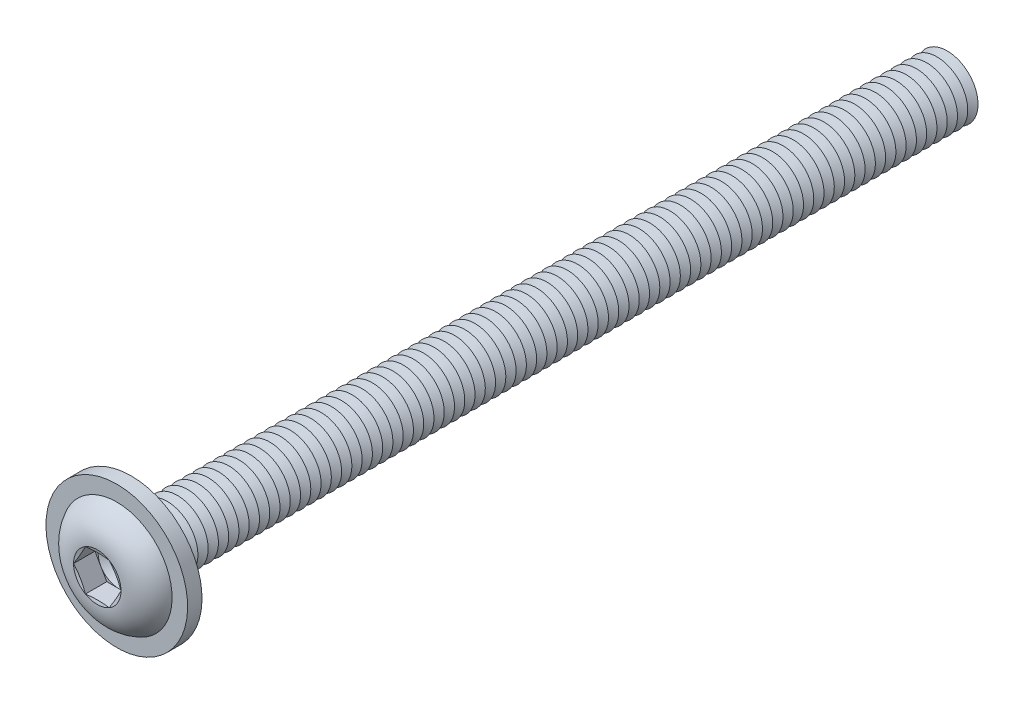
ISO-10303-21;
HEADER;
FILE_DESCRIPTION(('STEP AP214'),'2;1');
FILE_NAME('part.step','',(''),(''),'','','');
FILE_SCHEMA(('AUTOMOTIVE_DESIGN { 1 0 10303 214 1 1 1 1 }'));
ENDSEC;
DATA;
#1=APPLICATION_CONTEXT('core data for automotive mechanical design processes');
#2=APPLICATION_PROTOCOL_DEFINITION('international standard','automotive_design',2000,#1);
#3=PRODUCT_CONTEXT('',#1,'mechanical');
#4=PRODUCT('Part','Part','',(#3));
#5=PRODUCT_RELATED_PRODUCT_CATEGORY('part','',(#4));
#6=PRODUCT_DEFINITION_FORMATION('','',#4);
#7=PRODUCT_DEFINITION_CONTEXT('part definition',#1,'design');
#8=PRODUCT_DEFINITION('design','',#6,#7);
#9=PRODUCT_DEFINITION_SHAPE('','',#8);
#10=(LENGTH_UNIT() NAMED_UNIT(*) SI_UNIT(.MILLI.,.METRE.));
#11=(NAMED_UNIT(*) PLANE_ANGLE_UNIT() SI_UNIT($,.RADIAN.));
#12=(NAMED_UNIT(*) SI_UNIT($,.STERADIAN.) SOLID_ANGLE_UNIT());
#13=UNCERTAINTY_MEASURE_WITH_UNIT(LENGTH_MEASURE(1.E-05),#10,'distance_accuracy_value','');
#14=(GEOMETRIC_REPRESENTATION_CONTEXT(3) GLOBAL_UNCERTAINTY_ASSIGNED_CONTEXT((#13)) GLOBAL_UNIT_ASSIGNED_CONTEXT((#10,
#11,#12)) REPRESENTATION_CONTEXT('',''));
#15=CARTESIAN_POINT('',(0.,0.,0.));
#16=DIRECTION('',(0.,0.,1.));
#17=DIRECTION('',(1.,0.,0.));
#18=AXIS2_PLACEMENT_3D('',#15,#16,#17);
#19=CARTESIAN_POINT('',(0.,0.,-38.25));
#20=DIRECTION('',(0.,0.,1.));
#21=DIRECTION('',(0.,-1.,0.));
#22=AXIS2_PLACEMENT_3D('',#19,#20,#21);
#23=CONICAL_SURFACE('',#22,1.49999999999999,1.0471975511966);
#24=CARTESIAN_POINT('',(0.,0.,-38.5));
#25=DIRECTION('',(0.,0.,1.));
#26=DIRECTION('',(0.,-1.,0.));
#27=AXIS2_PLACEMENT_3D('',#24,#25,#26);
#28=CIRCLE('',#27,1.06698729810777);
#29=CARTESIAN_POINT('',(0.,-1.06698729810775,-38.5));
#30=VERTEX_POINT('',#29);
#31=EDGE_CURVE('E848',#30,#30,#28,.T.);
#32=ORIENTED_EDGE('',*,*,#31,.T.);
#33=EDGE_LOOP('',(#32));
#34=FACE_BOUND('',#33,.T.);
#35=CARTESIAN_POINT('',(0.,0.,-38.25));
#36=DIRECTION('',(0.,0.,1.));
#37=DIRECTION('',(0.,-1.,0.));
#38=AXIS2_PLACEMENT_3D('',#35,#36,#37);
#39=CIRCLE('',#38,1.49999999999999);
#40=CARTESIAN_POINT('',(0.,-1.49999999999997,-38.25));
#41=VERTEX_POINT('',#40);
#42=EDGE_CURVE('E844',#41,#41,#39,.T.);
#43=ORIENTED_EDGE('',*,*,#42,.F.);
#44=EDGE_LOOP('',(#43));
#45=FACE_BOUND('',#44,.T.);
#46=ADVANCED_FACE('F39',(#34,#45),#23,.T.);
#47=CARTESIAN_POINT('',(0.,0.,-38.5));
#48=DIRECTION('',(0.,0.,-1.));
#49=DIRECTION('',(0.,1.,0.));
#50=AXIS2_PLACEMENT_3D('',#47,#48,#49);
#51=CONICAL_SURFACE('',#50,1.06698729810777,1.0471975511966);
#52=CARTESIAN_POINT('',(0.,0.,-38.75));
#53=DIRECTION('',(0.,0.,1.));
#54=DIRECTION('',(0.,-1.,0.));
#55=AXIS2_PLACEMENT_3D('',#52,#53,#54);
#56=CIRCLE('',#55,1.49999999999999);
#57=CARTESIAN_POINT('',(0.,-1.49999999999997,-38.75));
#58=VERTEX_POINT('',#57);
#59=EDGE_CURVE('E852',#58,#58,#56,.T.);
#60=ORIENTED_EDGE('',*,*,#59,.T.);
#61=EDGE_LOOP('',(#60));
#62=FACE_BOUND('',#61,.T.);
#63=ORIENTED_EDGE('',*,*,#31,.F.);
#64=EDGE_LOOP('',(#63));
#65=FACE_BOUND('',#64,.T.);
#66=ADVANCED_FACE('F969',(#62,#65),#51,.T.);
#67=CARTESIAN_POINT('',(0.,1.5,-40.));
#68=DIRECTION('',(0.,0.,-1.));
#69=DIRECTION('',(0.,1.,0.));
#70=AXIS2_PLACEMENT_3D('',#67,#68,#69);
#71=PLANE('',#70);
#72=CARTESIAN_POINT('',(0.,0.,-40.));
#73=DIRECTION('',(0.,0.,1.));
#74=DIRECTION('',(0.,-1.,0.));
#75=AXIS2_PLACEMENT_3D('',#72,#73,#74);
#76=CIRCLE('',#75,1.06698729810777);
#77=CARTESIAN_POINT('',(0.,-1.06698729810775,-40.));
#78=VERTEX_POINT('',#77);
#79=EDGE_CURVE('E872',#78,#78,#76,.T.);
#80=ORIENTED_EDGE('',*,*,#79,.F.);
#81=EDGE_LOOP('',(#80));
#82=FACE_BOUND('',#81,.T.);
#83=ADVANCED_FACE('F975',(#82),#71,.T.);
#84=CARTESIAN_POINT('',(0.,0.,-39.75));
#85=DIRECTION('',(0.,0.,1.));
#86=DIRECTION('',(0.,-1.,0.));
#87=AXIS2_PLACEMENT_3D('',#84,#85,#86);
#88=CONICAL_SURFACE('',#87,1.49999999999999,1.0471975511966);
#89=ORIENTED_EDGE('',*,*,#79,.T.);
#90=EDGE_LOOP('',(#89));
#91=FACE_BOUND('',#90,.T.);
#92=CARTESIAN_POINT('',(0.,0.,-39.75));
#93=DIRECTION('',(0.,0.,1.));
#94=DIRECTION('',(0.,-1.,0.));
#95=AXIS2_PLACEMENT_3D('',#92,#93,#94);
#96=CIRCLE('',#95,1.49999999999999);
#97=CARTESIAN_POINT('',(0.,-1.49999999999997,-39.75));
#98=VERTEX_POINT('',#97);
#99=EDGE_CURVE('E868',#98,#98,#96,.T.);
#100=ORIENTED_EDGE('',*,*,#99,.F.);
#101=EDGE_LOOP('',(#100));
#102=FACE_BOUND('',#101,.T.);
#103=ADVANCED_FACE('F994',(#91,#102),#88,.T.);
#104=CARTESIAN_POINT('',(0.,0.,-39.5));
#105=DIRECTION('',(0.,0.,-1.));
#106=DIRECTION('',(0.,1.,0.));
#107=AXIS2_PLACEMENT_3D('',#104,#105,#106);
#108=CONICAL_SURFACE('',#107,1.06698729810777,1.0471975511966);
#109=ORIENTED_EDGE('',*,*,#99,.T.);
#110=EDGE_LOOP('',(#109));
#111=FACE_BOUND('',#110,.T.);
#112=CARTESIAN_POINT('',(0.,0.,-39.5));
#113=DIRECTION('',(0.,0.,1.));
#114=DIRECTION('',(0.,-1.,0.));
#115=AXIS2_PLACEMENT_3D('',#112,#113,#114);
#116=CIRCLE('',#115,1.06698729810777);
#117=CARTESIAN_POINT('',(0.,-1.06698729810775,-39.5));
#118=VERTEX_POINT('',#117);
#119=EDGE_CURVE('E864',#118,#118,#116,.T.);
#120=ORIENTED_EDGE('',*,*,#119,.F.);
#121=EDGE_LOOP('',(#120));
#122=FACE_BOUND('',#121,.T.);
#123=ADVANCED_FACE('F991',(#111,#122),#108,.T.);
#124=CARTESIAN_POINT('',(0.,0.,-39.25));
#125=DIRECTION('',(0.,0.,1.));
#126=DIRECTION('',(0.,-1.,0.));
#127=AXIS2_PLACEMENT_3D('',#124,#125,#126);
#128=CONICAL_SURFACE('',#127,1.49999999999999,1.0471975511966);
#129=ORIENTED_EDGE('',*,*,#119,.T.);
#130=EDGE_LOOP('',(#129));
#131=FACE_BOUND('',#130,.T.);
#132=CARTESIAN_POINT('',(0.,0.,-39.25));
#133=DIRECTION('',(0.,0.,1.));
#134=DIRECTION('',(0.,-1.,0.));
#135=AXIS2_PLACEMENT_3D('',#132,#133,#134);
#136=CIRCLE('',#135,1.49999999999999);
#137=CARTESIAN_POINT('',(0.,-1.49999999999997,-39.25));
#138=VERTEX_POINT('',#137);
#139=EDGE_CURVE('E860',#138,#138,#136,.T.);
#140=ORIENTED_EDGE('',*,*,#139,.F.);
#141=EDGE_LOOP('',(#140));
#142=FACE_BOUND('',#141,.T.);
#143=ADVANCED_FACE('F985',(#131,#142),#128,.T.);
#144=CARTESIAN_POINT('',(0.,0.,-39.));
#145=DIRECTION('',(0.,0.,-1.));
#146=DIRECTION('',(0.,1.,0.));
#147=AXIS2_PLACEMENT_3D('',#144,#145,#146);
#148=CONICAL_SURFACE('',#147,1.06698729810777,1.0471975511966);
#149=ORIENTED_EDGE('',*,*,#139,.T.);
#150=EDGE_LOOP('',(#149));
#151=FACE_BOUND('',#150,.T.);
#152=CARTESIAN_POINT('',(0.,0.,-39.));
#153=DIRECTION('',(0.,0.,1.));
#154=DIRECTION('',(0.,-1.,0.));
#155=AXIS2_PLACEMENT_3D('',#152,#153,#154);
#156=CIRCLE('',#155,1.06698729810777);
#157=CARTESIAN_POINT('',(0.,-1.06698729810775,-39.));
#158=VERTEX_POINT('',#157);
#159=EDGE_CURVE('E856',#158,#158,#156,.T.);
#160=ORIENTED_EDGE('',*,*,#159,.F.);
#161=EDGE_LOOP('',(#160));
#162=FACE_BOUND('',#161,.T.);
#163=ADVANCED_FACE('F981',(#151,#162),#148,.T.);
#164=CARTESIAN_POINT('',(0.,0.,-38.75));
#165=DIRECTION('',(0.,0.,1.));
#166=DIRECTION('',(0.,-1.,0.));
#167=AXIS2_PLACEMENT_3D('',#164,#165,#166);
#168=CONICAL_SURFACE('',#167,1.49999999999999,1.0471975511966);
#169=ORIENTED_EDGE('',*,*,#159,.T.);
#170=EDGE_LOOP('',(#169));
#171=FACE_BOUND('',#170,.T.);
#172=ORIENTED_EDGE('',*,*,#59,.F.);
#173=EDGE_LOOP('',(#172));
#174=FACE_BOUND('',#173,.T.);
#175=ADVANCED_FACE('F984',(#171,#174),#168,.T.);
#176=CARTESIAN_POINT('',(0.,0.,-37.75));
#177=DIRECTION('',(0.,0.,1.));
#178=DIRECTION('',(0.,-1.,0.));
#179=AXIS2_PLACEMENT_3D('',#176,#177,#178);
#180=CONICAL_SURFACE('',#179,1.49999999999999,1.0471975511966);
#181=CARTESIAN_POINT('',(0.,0.,-38.));
#182=DIRECTION('',(0.,0.,1.));
#183=DIRECTION('',(0.,-1.,0.));
#184=AXIS2_PLACEMENT_3D('',#181,#182,#183);
#185=CIRCLE('',#184,1.06698729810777);
#186=CARTESIAN_POINT('',(0.,-1.06698729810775,-38.));
#187=VERTEX_POINT('',#186);
#188=EDGE_CURVE('E840',#187,#187,#185,.T.);
#189=ORIENTED_EDGE('',*,*,#188,.T.);
#190=EDGE_LOOP('',(#189));
#191=FACE_BOUND('',#190,.T.);
#192=CARTESIAN_POINT('',(0.,0.,-37.75));
#193=DIRECTION('',(0.,0.,1.));
#194=DIRECTION('',(0.,-1.,0.));
#195=AXIS2_PLACEMENT_3D('',#192,#193,#194);
#196=CIRCLE('',#195,1.49999999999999);
#197=CARTESIAN_POINT('',(0.,-1.49999999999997,-37.75));
#198=VERTEX_POINT('',#197);
#199=EDGE_CURVE('E836',#198,#198,#196,.T.);
#200=ORIENTED_EDGE('',*,*,#199,.F.);
#201=EDGE_LOOP('',(#200));
#202=FACE_BOUND('',#201,.T.);
#203=ADVANCED_FACE('F989',(#191,#202),#180,.T.);
#204=CARTESIAN_POINT('',(0.,0.,-38.));
#205=DIRECTION('',(0.,0.,-1.));
#206=DIRECTION('',(0.,1.,0.));
#207=AXIS2_PLACEMENT_3D('',#204,#205,#206);
#208=CONICAL_SURFACE('',#207,1.06698729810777,1.0471975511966);
#209=ORIENTED_EDGE('',*,*,#42,.T.);
#210=EDGE_LOOP('',(#209));
#211=FACE_BOUND('',#210,.T.);
#212=ORIENTED_EDGE('',*,*,#188,.F.);
#213=EDGE_LOOP('',(#212));
#214=FACE_BOUND('',#213,.T.);
#215=ADVANCED_FACE('F1040',(#211,#214),#208,.T.);
#216=CARTESIAN_POINT('',(0.,0.,-37.25));
#217=DIRECTION('',(0.,0.,1.));
#218=DIRECTION('',(0.,-1.,0.));
#219=AXIS2_PLACEMENT_3D('',#216,#217,#218);
#220=CONICAL_SURFACE('',#219,1.49999999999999,1.0471975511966);
#221=CARTESIAN_POINT('',(0.,0.,-37.5));
#222=DIRECTION('',(0.,0.,1.));
#223=DIRECTION('',(0.,-1.,0.));
#224=AXIS2_PLACEMENT_3D('',#221,#222,#223);
#225=CIRCLE('',#224,1.06698729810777);
#226=CARTESIAN_POINT('',(0.,-1.06698729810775,-37.5));
#227=VERTEX_POINT('',#226);
#228=EDGE_CURVE('E833',#227,#227,#225,.T.);
#229=ORIENTED_EDGE('',*,*,#228,.T.);
#230=EDGE_LOOP('',(#229));
#231=FACE_BOUND('',#230,.T.);
#232=CARTESIAN_POINT('',(0.,0.,-37.25));
#233=DIRECTION('',(0.,0.,1.));
#234=DIRECTION('',(0.,-1.,0.));
#235=AXIS2_PLACEMENT_3D('',#232,#233,#234);
#236=CIRCLE('',#235,1.49999999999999);
#237=CARTESIAN_POINT('',(0.,-1.49999999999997,-37.25));
#238=VERTEX_POINT('',#237);
#239=EDGE_CURVE('E829',#238,#238,#236,.T.);
#240=ORIENTED_EDGE('',*,*,#239,.F.);
#241=EDGE_LOOP('',(#240));
#242=FACE_BOUND('',#241,.T.);
#243=ADVANCED_FACE('F1046',(#231,#242),#220,.T.);
#244=CARTESIAN_POINT('',(0.,0.,-37.5));
#245=DIRECTION('',(0.,0.,-1.));
#246=DIRECTION('',(0.,1.,0.));
#247=AXIS2_PLACEMENT_3D('',#244,#245,#246);
#248=CONICAL_SURFACE('',#247,1.06698729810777,1.0471975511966);
#249=ORIENTED_EDGE('',*,*,#199,.T.);
#250=EDGE_LOOP('',(#249));
#251=FACE_BOUND('',#250,.T.);
#252=ORIENTED_EDGE('',*,*,#228,.F.);
#253=EDGE_LOOP('',(#252));
#254=FACE_BOUND('',#253,.T.);
#255=ADVANCED_FACE('F1053',(#251,#254),#248,.T.);
#256=CARTESIAN_POINT('',(0.,0.,-36.75));
#257=DIRECTION('',(0.,0.,1.));
#258=DIRECTION('',(0.,-1.,0.));
#259=AXIS2_PLACEMENT_3D('',#256,#257,#258);
#260=CONICAL_SURFACE('',#259,1.49999999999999,1.0471975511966);
#261=CARTESIAN_POINT('',(0.,0.,-37.));
#262=DIRECTION('',(0.,0.,1.));
#263=DIRECTION('',(0.,-1.,0.));
#264=AXIS2_PLACEMENT_3D('',#261,#262,#263);
#265=CIRCLE('',#264,1.06698729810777);
#266=CARTESIAN_POINT('',(0.,-1.06698729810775,-37.));
#267=VERTEX_POINT('',#266);
#268=EDGE_CURVE('E825',#267,#267,#265,.T.);
#269=ORIENTED_EDGE('',*,*,#268,.T.);
#270=EDGE_LOOP('',(#269));
#271=FACE_BOUND('',#270,.T.);
#272=CARTESIAN_POINT('',(0.,0.,-36.75));
#273=DIRECTION('',(0.,0.,1.));
#274=DIRECTION('',(0.,-1.,0.));
#275=AXIS2_PLACEMENT_3D('',#272,#273,#274);
#276=CIRCLE('',#275,1.49999999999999);
#277=CARTESIAN_POINT('',(0.,-1.49999999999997,-36.75));
#278=VERTEX_POINT('',#277);
#279=EDGE_CURVE('E821',#278,#278,#276,.T.);
#280=ORIENTED_EDGE('',*,*,#279,.F.);
#281=EDGE_LOOP('',(#280));
#282=FACE_BOUND('',#281,.T.);
#283=ADVANCED_FACE('F1060',(#271,#282),#260,.T.);
#284=CARTESIAN_POINT('',(0.,0.,-37.));
#285=DIRECTION('',(0.,0.,-1.));
#286=DIRECTION('',(0.,1.,0.));
#287=AXIS2_PLACEMENT_3D('',#284,#285,#286);
#288=CONICAL_SURFACE('',#287,1.06698729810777,1.0471975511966);
#289=ORIENTED_EDGE('',*,*,#239,.T.);
#290=EDGE_LOOP('',(#289));
#291=FACE_BOUND('',#290,.T.);
#292=ORIENTED_EDGE('',*,*,#268,.F.);
#293=EDGE_LOOP('',(#292));
#294=FACE_BOUND('',#293,.T.);
#295=ADVANCED_FACE('F1067',(#291,#294),#288,.T.);
#296=CARTESIAN_POINT('',(0.,0.,-36.25));
#297=DIRECTION('',(0.,0.,1.));
#298=DIRECTION('',(0.,-1.,0.));
#299=AXIS2_PLACEMENT_3D('',#296,#297,#298);
#300=CONICAL_SURFACE('',#299,1.49999999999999,1.0471975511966);
#301=CARTESIAN_POINT('',(0.,0.,-36.5));
#302=DIRECTION('',(0.,0.,1.));
#303=DIRECTION('',(0.,-1.,0.));
#304=AXIS2_PLACEMENT_3D('',#301,#302,#303);
#305=CIRCLE('',#304,1.06698729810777);
#306=CARTESIAN_POINT('',(0.,-1.06698729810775,-36.5));
#307=VERTEX_POINT('',#306);
#308=EDGE_CURVE('E817',#307,#307,#305,.T.);
#309=ORIENTED_EDGE('',*,*,#308,.T.);
#310=EDGE_LOOP('',(#309));
#311=FACE_BOUND('',#310,.T.);
#312=CARTESIAN_POINT('',(0.,0.,-36.25));
#313=DIRECTION('',(0.,0.,1.));
#314=DIRECTION('',(0.,-1.,0.));
#315=AXIS2_PLACEMENT_3D('',#312,#313,#314);
#316=CIRCLE('',#315,1.49999999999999);
#317=CARTESIAN_POINT('',(0.,-1.49999999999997,-36.25));
#318=VERTEX_POINT('',#317);
#319=EDGE_CURVE('E813',#318,#318,#316,.T.);
#320=ORIENTED_EDGE('',*,*,#319,.F.);
#321=EDGE_LOOP('',(#320));
#322=FACE_BOUND('',#321,.T.);
#323=ADVANCED_FACE('F1074',(#311,#322),#300,.T.);
#324=CARTESIAN_POINT('',(0.,0.,-36.5));
#325=DIRECTION('',(0.,0.,-1.));
#326=DIRECTION('',(0.,1.,0.));
#327=AXIS2_PLACEMENT_3D('',#324,#325,#326);
#328=CONICAL_SURFACE('',#327,1.06698729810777,1.0471975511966);
#329=ORIENTED_EDGE('',*,*,#279,.T.);
#330=EDGE_LOOP('',(#329));
#331=FACE_BOUND('',#330,.T.);
#332=ORIENTED_EDGE('',*,*,#308,.F.);
#333=EDGE_LOOP('',(#332));
#334=FACE_BOUND('',#333,.T.);
#335=ADVANCED_FACE('F1081',(#331,#334),#328,.T.);
#336=CARTESIAN_POINT('',(0.,0.,-35.75));
#337=DIRECTION('',(0.,0.,1.));
#338=DIRECTION('',(0.,-1.,0.));
#339=AXIS2_PLACEMENT_3D('',#336,#337,#338);
#340=CONICAL_SURFACE('',#339,1.49999999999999,1.0471975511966);
#341=CARTESIAN_POINT('',(0.,0.,-36.));
#342=DIRECTION('',(0.,0.,1.));
#343=DIRECTION('',(0.,-1.,0.));
#344=AXIS2_PLACEMENT_3D('',#341,#342,#343);
#345=CIRCLE('',#344,1.06698729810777);
#346=CARTESIAN_POINT('',(0.,-1.06698729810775,-36.));
#347=VERTEX_POINT('',#346);
#348=EDGE_CURVE('E809',#347,#347,#345,.T.);
#349=ORIENTED_EDGE('',*,*,#348,.T.);
#350=EDGE_LOOP('',(#349));
#351=FACE_BOUND('',#350,.T.);
#352=CARTESIAN_POINT('',(0.,0.,-35.75));
#353=DIRECTION('',(0.,0.,1.));
#354=DIRECTION('',(0.,-1.,0.));
#355=AXIS2_PLACEMENT_3D('',#352,#353,#354);
#356=CIRCLE('',#355,1.49999999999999);
#357=CARTESIAN_POINT('',(0.,-1.49999999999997,-35.75));
#358=VERTEX_POINT('',#357);
#359=EDGE_CURVE('E805',#358,#358,#356,.T.);
#360=ORIENTED_EDGE('',*,*,#359,.F.);
#361=EDGE_LOOP('',(#360));
#362=FACE_BOUND('',#361,.T.);
#363=ADVANCED_FACE('F1088',(#351,#362),#340,.T.);
#364=CARTESIAN_POINT('',(0.,0.,-36.));
#365=DIRECTION('',(0.,0.,-1.));
#366=DIRECTION('',(0.,1.,0.));
#367=AXIS2_PLACEMENT_3D('',#364,#365,#366);
#368=CONICAL_SURFACE('',#367,1.06698729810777,1.0471975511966);
#369=ORIENTED_EDGE('',*,*,#319,.T.);
#370=EDGE_LOOP('',(#369));
#371=FACE_BOUND('',#370,.T.);
#372=ORIENTED_EDGE('',*,*,#348,.F.);
#373=EDGE_LOOP('',(#372));
#374=FACE_BOUND('',#373,.T.);
#375=ADVANCED_FACE('F1095',(#371,#374),#368,.T.);
#376=CARTESIAN_POINT('',(0.,0.,-35.25));
#377=DIRECTION('',(0.,0.,1.));
#378=DIRECTION('',(0.,-1.,0.));
#379=AXIS2_PLACEMENT_3D('',#376,#377,#378);
#380=CONICAL_SURFACE('',#379,1.49999999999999,1.0471975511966);
#381=CARTESIAN_POINT('',(0.,0.,-35.5));
#382=DIRECTION('',(0.,0.,1.));
#383=DIRECTION('',(0.,-1.,0.));
#384=AXIS2_PLACEMENT_3D('',#381,#382,#383);
#385=CIRCLE('',#384,1.06698729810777);
#386=CARTESIAN_POINT('',(0.,-1.06698729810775,-35.5));
#387=VERTEX_POINT('',#386);
#388=EDGE_CURVE('E801',#387,#387,#385,.T.);
#389=ORIENTED_EDGE('',*,*,#388,.T.);
#390=EDGE_LOOP('',(#389));
#391=FACE_BOUND('',#390,.T.);
#392=CARTESIAN_POINT('',(0.,0.,-35.25));
#393=DIRECTION('',(0.,0.,1.));
#394=DIRECTION('',(0.,-1.,0.));
#395=AXIS2_PLACEMENT_3D('',#392,#393,#394);
#396=CIRCLE('',#395,1.49999999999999);
#397=CARTESIAN_POINT('',(0.,-1.49999999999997,-35.25));
#398=VERTEX_POINT('',#397);
#399=EDGE_CURVE('E797',#398,#398,#396,.T.);
#400=ORIENTED_EDGE('',*,*,#399,.F.);
#401=EDGE_LOOP('',(#400));
#402=FACE_BOUND('',#401,.T.);
#403=ADVANCED_FACE('F1102',(#391,#402),#380,.T.);
#404=CARTESIAN_POINT('',(0.,0.,-35.5));
#405=DIRECTION('',(0.,0.,-1.));
#406=DIRECTION('',(0.,1.,0.));
#407=AXIS2_PLACEMENT_3D('',#404,#405,#406);
#408=CONICAL_SURFACE('',#407,1.06698729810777,1.0471975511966);
#409=ORIENTED_EDGE('',*,*,#359,.T.);
#410=EDGE_LOOP('',(#409));
#411=FACE_BOUND('',#410,.T.);
#412=ORIENTED_EDGE('',*,*,#388,.F.);
#413=EDGE_LOOP('',(#412));
#414=FACE_BOUND('',#413,.T.);
#415=ADVANCED_FACE('F1109',(#411,#414),#408,.T.);
#416=CARTESIAN_POINT('',(0.,0.,-34.75));
#417=DIRECTION('',(0.,0.,1.));
#418=DIRECTION('',(0.,-1.,0.));
#419=AXIS2_PLACEMENT_3D('',#416,#417,#418);
#420=CONICAL_SURFACE('',#419,1.49999999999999,1.0471975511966);
#421=CARTESIAN_POINT('',(0.,0.,-35.));
#422=DIRECTION('',(0.,0.,1.));
#423=DIRECTION('',(0.,-1.,0.));
#424=AXIS2_PLACEMENT_3D('',#421,#422,#423);
#425=CIRCLE('',#424,1.06698729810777);
#426=CARTESIAN_POINT('',(0.,-1.06698729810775,-35.));
#427=VERTEX_POINT('',#426);
#428=EDGE_CURVE('E793',#427,#427,#425,.T.);
#429=ORIENTED_EDGE('',*,*,#428,.T.);
#430=EDGE_LOOP('',(#429));
#431=FACE_BOUND('',#430,.T.);
#432=CARTESIAN_POINT('',(0.,0.,-34.75));
#433=DIRECTION('',(0.,0.,1.));
#434=DIRECTION('',(0.,-1.,0.));
#435=AXIS2_PLACEMENT_3D('',#432,#433,#434);
#436=CIRCLE('',#435,1.49999999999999);
#437=CARTESIAN_POINT('',(0.,-1.49999999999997,-34.75));
#438=VERTEX_POINT('',#437);
#439=EDGE_CURVE('E789',#438,#438,#436,.T.);
#440=ORIENTED_EDGE('',*,*,#439,.F.);
#441=EDGE_LOOP('',(#440));
#442=FACE_BOUND('',#441,.T.);
#443=ADVANCED_FACE('F1116',(#431,#442),#420,.T.);
#444=CARTESIAN_POINT('',(0.,0.,-35.));
#445=DIRECTION('',(0.,0.,-1.));
#446=DIRECTION('',(0.,1.,0.));
#447=AXIS2_PLACEMENT_3D('',#444,#445,#446);
#448=CONICAL_SURFACE('',#447,1.06698729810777,1.0471975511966);
#449=ORIENTED_EDGE('',*,*,#399,.T.);
#450=EDGE_LOOP('',(#449));
#451=FACE_BOUND('',#450,.T.);
#452=ORIENTED_EDGE('',*,*,#428,.F.);
#453=EDGE_LOOP('',(#452));
#454=FACE_BOUND('',#453,.T.);
#455=ADVANCED_FACE('F1123',(#451,#454),#448,.T.);
#456=CARTESIAN_POINT('',(0.,0.,-34.25));
#457=DIRECTION('',(0.,0.,1.));
#458=DIRECTION('',(0.,-1.,0.));
#459=AXIS2_PLACEMENT_3D('',#456,#457,#458);
#460=CONICAL_SURFACE('',#459,1.49999999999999,1.0471975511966);
#461=CARTESIAN_POINT('',(0.,0.,-34.5));
#462=DIRECTION('',(0.,0.,1.));
#463=DIRECTION('',(0.,-1.,0.));
#464=AXIS2_PLACEMENT_3D('',#461,#462,#463);
#465=CIRCLE('',#464,1.06698729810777);
#466=CARTESIAN_POINT('',(0.,-1.06698729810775,-34.5));
#467=VERTEX_POINT('',#466);
#468=EDGE_CURVE('E785',#467,#467,#465,.T.);
#469=ORIENTED_EDGE('',*,*,#468,.T.);
#470=EDGE_LOOP('',(#469));
#471=FACE_BOUND('',#470,.T.);
#472=CARTESIAN_POINT('',(0.,0.,-34.25));
#473=DIRECTION('',(0.,0.,1.));
#474=DIRECTION('',(0.,-1.,0.));
#475=AXIS2_PLACEMENT_3D('',#472,#473,#474);
#476=CIRCLE('',#475,1.49999999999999);
#477=CARTESIAN_POINT('',(0.,-1.49999999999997,-34.25));
#478=VERTEX_POINT('',#477);
#479=EDGE_CURVE('E781',#478,#478,#476,.T.);
#480=ORIENTED_EDGE('',*,*,#479,.F.);
#481=EDGE_LOOP('',(#480));
#482=FACE_BOUND('',#481,.T.);
#483=ADVANCED_FACE('F1130',(#471,#482),#460,.T.);
#484=CARTESIAN_POINT('',(0.,0.,-34.5));
#485=DIRECTION('',(0.,0.,-1.));
#486=DIRECTION('',(0.,1.,0.));
#487=AXIS2_PLACEMENT_3D('',#484,#485,#486);
#488=CONICAL_SURFACE('',#487,1.06698729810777,1.0471975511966);
#489=ORIENTED_EDGE('',*,*,#439,.T.);
#490=EDGE_LOOP('',(#489));
#491=FACE_BOUND('',#490,.T.);
#492=ORIENTED_EDGE('',*,*,#468,.F.);
#493=EDGE_LOOP('',(#492));
#494=FACE_BOUND('',#493,.T.);
#495=ADVANCED_FACE('F1137',(#491,#494),#488,.T.);
#496=CARTESIAN_POINT('',(0.,0.,-33.75));
#497=DIRECTION('',(0.,0.,1.));
#498=DIRECTION('',(0.,-1.,0.));
#499=AXIS2_PLACEMENT_3D('',#496,#497,#498);
#500=CONICAL_SURFACE('',#499,1.49999999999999,1.0471975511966);
#501=CARTESIAN_POINT('',(0.,0.,-34.));
#502=DIRECTION('',(0.,0.,1.));
#503=DIRECTION('',(0.,-1.,0.));
#504=AXIS2_PLACEMENT_3D('',#501,#502,#503);
#505=CIRCLE('',#504,1.06698729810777);
#506=CARTESIAN_POINT('',(0.,-1.06698729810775,-34.));
#507=VERTEX_POINT('',#506);
#508=EDGE_CURVE('E777',#507,#507,#505,.T.);
#509=ORIENTED_EDGE('',*,*,#508,.T.);
#510=EDGE_LOOP('',(#509));
#511=FACE_BOUND('',#510,.T.);
#512=CARTESIAN_POINT('',(0.,0.,-33.75));
#513=DIRECTION('',(0.,0.,1.));
#514=DIRECTION('',(0.,-1.,0.));
#515=AXIS2_PLACEMENT_3D('',#512,#513,#514);
#516=CIRCLE('',#515,1.49999999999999);
#517=CARTESIAN_POINT('',(0.,-1.49999999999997,-33.75));
#518=VERTEX_POINT('',#517);
#519=EDGE_CURVE('E773',#518,#518,#516,.T.);
#520=ORIENTED_EDGE('',*,*,#519,.F.);
#521=EDGE_LOOP('',(#520));
#522=FACE_BOUND('',#521,.T.);
#523=ADVANCED_FACE('F1144',(#511,#522),#500,.T.);
#524=CARTESIAN_POINT('',(0.,0.,-34.));
#525=DIRECTION('',(0.,0.,-1.));
#526=DIRECTION('',(0.,1.,0.));
#527=AXIS2_PLACEMENT_3D('',#524,#525,#526);
#528=CONICAL_SURFACE('',#527,1.06698729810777,1.0471975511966);
#529=ORIENTED_EDGE('',*,*,#479,.T.);
#530=EDGE_LOOP('',(#529));
#531=FACE_BOUND('',#530,.T.);
#532=ORIENTED_EDGE('',*,*,#508,.F.);
#533=EDGE_LOOP('',(#532));
#534=FACE_BOUND('',#533,.T.);
#535=ADVANCED_FACE('F1151',(#531,#534),#528,.T.);
#536=CARTESIAN_POINT('',(0.,0.,-33.25));
#537=DIRECTION('',(0.,0.,1.));
#538=DIRECTION('',(0.,-1.,0.));
#539=AXIS2_PLACEMENT_3D('',#536,#537,#538);
#540=CONICAL_SURFACE('',#539,1.49999999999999,1.0471975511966);
#541=CARTESIAN_POINT('',(0.,0.,-33.5));
#542=DIRECTION('',(0.,0.,1.));
#543=DIRECTION('',(0.,-1.,0.));
#544=AXIS2_PLACEMENT_3D('',#541,#542,#543);
#545=CIRCLE('',#544,1.06698729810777);
#546=CARTESIAN_POINT('',(0.,-1.06698729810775,-33.5));
#547=VERTEX_POINT('',#546);
#548=EDGE_CURVE('E769',#547,#547,#545,.T.);
#549=ORIENTED_EDGE('',*,*,#548,.T.);
#550=EDGE_LOOP('',(#549));
#551=FACE_BOUND('',#550,.T.);
#552=CARTESIAN_POINT('',(0.,0.,-33.25));
#553=DIRECTION('',(0.,0.,1.));
#554=DIRECTION('',(0.,-1.,0.));
#555=AXIS2_PLACEMENT_3D('',#552,#553,#554);
#556=CIRCLE('',#555,1.49999999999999);
#557=CARTESIAN_POINT('',(0.,-1.49999999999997,-33.25));
#558=VERTEX_POINT('',#557);
#559=EDGE_CURVE('E765',#558,#558,#556,.T.);
#560=ORIENTED_EDGE('',*,*,#559,.F.);
#561=EDGE_LOOP('',(#560));
#562=FACE_BOUND('',#561,.T.);
#563=ADVANCED_FACE('F1158',(#551,#562),#540,.T.);
#564=CARTESIAN_POINT('',(0.,0.,-33.5));
#565=DIRECTION('',(0.,0.,-1.));
#566=DIRECTION('',(0.,1.,0.));
#567=AXIS2_PLACEMENT_3D('',#564,#565,#566);
#568=CONICAL_SURFACE('',#567,1.06698729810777,1.0471975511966);
#569=ORIENTED_EDGE('',*,*,#519,.T.);
#570=EDGE_LOOP('',(#569));
#571=FACE_BOUND('',#570,.T.);
#572=ORIENTED_EDGE('',*,*,#548,.F.);
#573=EDGE_LOOP('',(#572));
#574=FACE_BOUND('',#573,.T.);
#575=ADVANCED_FACE('F1165',(#571,#574),#568,.T.);
#576=CARTESIAN_POINT('',(0.,0.,-32.75));
#577=DIRECTION('',(0.,0.,1.));
#578=DIRECTION('',(0.,-1.,0.));
#579=AXIS2_PLACEMENT_3D('',#576,#577,#578);
#580=CONICAL_SURFACE('',#579,1.49999999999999,1.0471975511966);
#581=CARTESIAN_POINT('',(0.,0.,-33.));
#582=DIRECTION('',(0.,0.,1.));
#583=DIRECTION('',(0.,-1.,0.));
#584=AXIS2_PLACEMENT_3D('',#581,#582,#583);
#585=CIRCLE('',#584,1.06698729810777);
#586=CARTESIAN_POINT('',(0.,-1.06698729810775,-33.));
#587=VERTEX_POINT('',#586);
#588=EDGE_CURVE('E761',#587,#587,#585,.T.);
#589=ORIENTED_EDGE('',*,*,#588,.T.);
#590=EDGE_LOOP('',(#589));
#591=FACE_BOUND('',#590,.T.);
#592=CARTESIAN_POINT('',(0.,0.,-32.75));
#593=DIRECTION('',(0.,0.,1.));
#594=DIRECTION('',(0.,-1.,0.));
#595=AXIS2_PLACEMENT_3D('',#592,#593,#594);
#596=CIRCLE('',#595,1.49999999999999);
#597=CARTESIAN_POINT('',(0.,-1.49999999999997,-32.75));
#598=VERTEX_POINT('',#597);
#599=EDGE_CURVE('E757',#598,#598,#596,.T.);
#600=ORIENTED_EDGE('',*,*,#599,.F.);
#601=EDGE_LOOP('',(#600));
#602=FACE_BOUND('',#601,.T.);
#603=ADVANCED_FACE('F1172',(#591,#602),#580,.T.);
#604=CARTESIAN_POINT('',(0.,0.,-33.));
#605=DIRECTION('',(0.,0.,-1.));
#606=DIRECTION('',(0.,1.,0.));
#607=AXIS2_PLACEMENT_3D('',#604,#605,#606);
#608=CONICAL_SURFACE('',#607,1.06698729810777,1.0471975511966);
#609=ORIENTED_EDGE('',*,*,#559,.T.);
#610=EDGE_LOOP('',(#609));
#611=FACE_BOUND('',#610,.T.);
#612=ORIENTED_EDGE('',*,*,#588,.F.);
#613=EDGE_LOOP('',(#612));
#614=FACE_BOUND('',#613,.T.);
#615=ADVANCED_FACE('F1179',(#611,#614),#608,.T.);
#616=CARTESIAN_POINT('',(0.,0.,-32.25));
#617=DIRECTION('',(0.,0.,1.));
#618=DIRECTION('',(0.,-1.,0.));
#619=AXIS2_PLACEMENT_3D('',#616,#617,#618);
#620=CONICAL_SURFACE('',#619,1.49999999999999,1.0471975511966);
#621=CARTESIAN_POINT('',(0.,0.,-32.5));
#622=DIRECTION('',(0.,0.,1.));
#623=DIRECTION('',(0.,-1.,0.));
#624=AXIS2_PLACEMENT_3D('',#621,#622,#623);
#625=CIRCLE('',#624,1.06698729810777);
#626=CARTESIAN_POINT('',(0.,-1.06698729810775,-32.5));
#627=VERTEX_POINT('',#626);
#628=EDGE_CURVE('E753',#627,#627,#625,.T.);
#629=ORIENTED_EDGE('',*,*,#628,.T.);
#630=EDGE_LOOP('',(#629));
#631=FACE_BOUND('',#630,.T.);
#632=CARTESIAN_POINT('',(0.,0.,-32.25));
#633=DIRECTION('',(0.,0.,1.));
#634=DIRECTION('',(0.,-1.,0.));
#635=AXIS2_PLACEMENT_3D('',#632,#633,#634);
#636=CIRCLE('',#635,1.49999999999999);
#637=CARTESIAN_POINT('',(0.,-1.49999999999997,-32.25));
#638=VERTEX_POINT('',#637);
#639=EDGE_CURVE('E749',#638,#638,#636,.T.);
#640=ORIENTED_EDGE('',*,*,#639,.F.);
#641=EDGE_LOOP('',(#640));
#642=FACE_BOUND('',#641,.T.);
#643=ADVANCED_FACE('F1186',(#631,#642),#620,.T.);
#644=CARTESIAN_POINT('',(0.,0.,-32.5));
#645=DIRECTION('',(0.,0.,-1.));
#646=DIRECTION('',(0.,1.,0.));
#647=AXIS2_PLACEMENT_3D('',#644,#645,#646);
#648=CONICAL_SURFACE('',#647,1.06698729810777,1.0471975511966);
#649=ORIENTED_EDGE('',*,*,#599,.T.);
#650=EDGE_LOOP('',(#649));
#651=FACE_BOUND('',#650,.T.);
#652=ORIENTED_EDGE('',*,*,#628,.F.);
#653=EDGE_LOOP('',(#652));
#654=FACE_BOUND('',#653,.T.);
#655=ADVANCED_FACE('F1193',(#651,#654),#648,.T.);
#656=CARTESIAN_POINT('',(0.,0.,-31.75));
#657=DIRECTION('',(0.,0.,1.));
#658=DIRECTION('',(0.,-1.,0.));
#659=AXIS2_PLACEMENT_3D('',#656,#657,#658);
#660=CONICAL_SURFACE('',#659,1.49999999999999,1.0471975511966);
#661=CARTESIAN_POINT('',(0.,0.,-32.));
#662=DIRECTION('',(0.,0.,1.));
#663=DIRECTION('',(0.,-1.,0.));
#664=AXIS2_PLACEMENT_3D('',#661,#662,#663);
#665=CIRCLE('',#664,1.06698729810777);
#666=CARTESIAN_POINT('',(0.,-1.06698729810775,-32.));
#667=VERTEX_POINT('',#666);
#668=EDGE_CURVE('E745',#667,#667,#665,.T.);
#669=ORIENTED_EDGE('',*,*,#668,.T.);
#670=EDGE_LOOP('',(#669));
#671=FACE_BOUND('',#670,.T.);
#672=CARTESIAN_POINT('',(0.,0.,-31.75));
#673=DIRECTION('',(0.,0.,1.));
#674=DIRECTION('',(0.,-1.,0.));
#675=AXIS2_PLACEMENT_3D('',#672,#673,#674);
#676=CIRCLE('',#675,1.49999999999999);
#677=CARTESIAN_POINT('',(0.,-1.49999999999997,-31.75));
#678=VERTEX_POINT('',#677);
#679=EDGE_CURVE('E741',#678,#678,#676,.T.);
#680=ORIENTED_EDGE('',*,*,#679,.F.);
#681=EDGE_LOOP('',(#680));
#682=FACE_BOUND('',#681,.T.);
#683=ADVANCED_FACE('F1200',(#671,#682),#660,.T.);
#684=CARTESIAN_POINT('',(0.,0.,-32.));
#685=DIRECTION('',(0.,0.,-1.));
#686=DIRECTION('',(0.,1.,0.));
#687=AXIS2_PLACEMENT_3D('',#684,#685,#686);
#688=CONICAL_SURFACE('',#687,1.06698729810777,1.0471975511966);
#689=ORIENTED_EDGE('',*,*,#639,.T.);
#690=EDGE_LOOP('',(#689));
#691=FACE_BOUND('',#690,.T.);
#692=ORIENTED_EDGE('',*,*,#668,.F.);
#693=EDGE_LOOP('',(#692));
#694=FACE_BOUND('',#693,.T.);
#695=ADVANCED_FACE('F1207',(#691,#694),#688,.T.);
#696=CARTESIAN_POINT('',(0.,0.,-31.25));
#697=DIRECTION('',(0.,0.,1.));
#698=DIRECTION('',(0.,-1.,0.));
#699=AXIS2_PLACEMENT_3D('',#696,#697,#698);
#700=CONICAL_SURFACE('',#699,1.49999999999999,1.0471975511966);
#701=CARTESIAN_POINT('',(0.,0.,-31.5));
#702=DIRECTION('',(0.,0.,1.));
#703=DIRECTION('',(0.,-1.,0.));
#704=AXIS2_PLACEMENT_3D('',#701,#702,#703);
#705=CIRCLE('',#704,1.06698729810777);
#706=CARTESIAN_POINT('',(0.,-1.06698729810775,-31.5));
#707=VERTEX_POINT('',#706);
#708=EDGE_CURVE('E737',#707,#707,#705,.T.);
#709=ORIENTED_EDGE('',*,*,#708,.T.);
#710=EDGE_LOOP('',(#709));
#711=FACE_BOUND('',#710,.T.);
#712=CARTESIAN_POINT('',(0.,0.,-31.25));
#713=DIRECTION('',(0.,0.,1.));
#714=DIRECTION('',(0.,-1.,0.));
#715=AXIS2_PLACEMENT_3D('',#712,#713,#714);
#716=CIRCLE('',#715,1.49999999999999);
#717=CARTESIAN_POINT('',(0.,-1.49999999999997,-31.25));
#718=VERTEX_POINT('',#717);
#719=EDGE_CURVE('E733',#718,#718,#716,.T.);
#720=ORIENTED_EDGE('',*,*,#719,.F.);
#721=EDGE_LOOP('',(#720));
#722=FACE_BOUND('',#721,.T.);
#723=ADVANCED_FACE('F1214',(#711,#722),#700,.T.);
#724=CARTESIAN_POINT('',(0.,0.,-31.5));
#725=DIRECTION('',(0.,0.,-1.));
#726=DIRECTION('',(0.,1.,0.));
#727=AXIS2_PLACEMENT_3D('',#724,#725,#726);
#728=CONICAL_SURFACE('',#727,1.06698729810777,1.0471975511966);
#729=ORIENTED_EDGE('',*,*,#679,.T.);
#730=EDGE_LOOP('',(#729));
#731=FACE_BOUND('',#730,.T.);
#732=ORIENTED_EDGE('',*,*,#708,.F.);
#733=EDGE_LOOP('',(#732));
#734=FACE_BOUND('',#733,.T.);
#735=ADVANCED_FACE('F1221',(#731,#734),#728,.T.);
#736=CARTESIAN_POINT('',(0.,0.,-30.75));
#737=DIRECTION('',(0.,0.,1.));
#738=DIRECTION('',(0.,-1.,0.));
#739=AXIS2_PLACEMENT_3D('',#736,#737,#738);
#740=CONICAL_SURFACE('',#739,1.49999999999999,1.0471975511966);
#741=CARTESIAN_POINT('',(0.,0.,-31.));
#742=DIRECTION('',(0.,0.,1.));
#743=DIRECTION('',(0.,-1.,0.));
#744=AXIS2_PLACEMENT_3D('',#741,#742,#743);
#745=CIRCLE('',#744,1.06698729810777);
#746=CARTESIAN_POINT('',(0.,-1.06698729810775,-31.));
#747=VERTEX_POINT('',#746);
#748=EDGE_CURVE('E729',#747,#747,#745,.T.);
#749=ORIENTED_EDGE('',*,*,#748,.T.);
#750=EDGE_LOOP('',(#749));
#751=FACE_BOUND('',#750,.T.);
#752=CARTESIAN_POINT('',(0.,0.,-30.75));
#753=DIRECTION('',(0.,0.,1.));
#754=DIRECTION('',(0.,-1.,0.));
#755=AXIS2_PLACEMENT_3D('',#752,#753,#754);
#756=CIRCLE('',#755,1.49999999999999);
#757=CARTESIAN_POINT('',(0.,-1.49999999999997,-30.75));
#758=VERTEX_POINT('',#757);
#759=EDGE_CURVE('E725',#758,#758,#756,.T.);
#760=ORIENTED_EDGE('',*,*,#759,.F.);
#761=EDGE_LOOP('',(#760));
#762=FACE_BOUND('',#761,.T.);
#763=ADVANCED_FACE('F1228',(#751,#762),#740,.T.);
#764=CARTESIAN_POINT('',(0.,0.,-31.));
#765=DIRECTION('',(0.,0.,-1.));
#766=DIRECTION('',(0.,1.,0.));
#767=AXIS2_PLACEMENT_3D('',#764,#765,#766);
#768=CONICAL_SURFACE('',#767,1.06698729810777,1.0471975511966);
#769=ORIENTED_EDGE('',*,*,#719,.T.);
#770=EDGE_LOOP('',(#769));
#771=FACE_BOUND('',#770,.T.);
#772=ORIENTED_EDGE('',*,*,#748,.F.);
#773=EDGE_LOOP('',(#772));
#774=FACE_BOUND('',#773,.T.);
#775=ADVANCED_FACE('F1235',(#771,#774),#768,.T.);
#776=CARTESIAN_POINT('',(0.,0.,-30.25));
#777=DIRECTION('',(0.,0.,1.));
#778=DIRECTION('',(0.,-1.,0.));
#779=AXIS2_PLACEMENT_3D('',#776,#777,#778);
#780=CONICAL_SURFACE('',#779,1.49999999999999,1.0471975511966);
#781=CARTESIAN_POINT('',(0.,0.,-30.5));
#782=DIRECTION('',(0.,0.,1.));
#783=DIRECTION('',(0.,-1.,0.));
#784=AXIS2_PLACEMENT_3D('',#781,#782,#783);
#785=CIRCLE('',#784,1.06698729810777);
#786=CARTESIAN_POINT('',(0.,-1.06698729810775,-30.5));
#787=VERTEX_POINT('',#786);
#788=EDGE_CURVE('E721',#787,#787,#785,.T.);
#789=ORIENTED_EDGE('',*,*,#788,.T.);
#790=EDGE_LOOP('',(#789));
#791=FACE_BOUND('',#790,.T.);
#792=CARTESIAN_POINT('',(0.,0.,-30.25));
#793=DIRECTION('',(0.,0.,1.));
#794=DIRECTION('',(0.,-1.,0.));
#795=AXIS2_PLACEMENT_3D('',#792,#793,#794);
#796=CIRCLE('',#795,1.49999999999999);
#797=CARTESIAN_POINT('',(0.,-1.49999999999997,-30.25));
#798=VERTEX_POINT('',#797);
#799=EDGE_CURVE('E717',#798,#798,#796,.T.);
#800=ORIENTED_EDGE('',*,*,#799,.F.);
#801=EDGE_LOOP('',(#800));
#802=FACE_BOUND('',#801,.T.);
#803=ADVANCED_FACE('F1242',(#791,#802),#780,.T.);
#804=CARTESIAN_POINT('',(0.,0.,-30.5));
#805=DIRECTION('',(0.,0.,-1.));
#806=DIRECTION('',(0.,1.,0.));
#807=AXIS2_PLACEMENT_3D('',#804,#805,#806);
#808=CONICAL_SURFACE('',#807,1.06698729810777,1.0471975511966);
#809=ORIENTED_EDGE('',*,*,#759,.T.);
#810=EDGE_LOOP('',(#809));
#811=FACE_BOUND('',#810,.T.);
#812=ORIENTED_EDGE('',*,*,#788,.F.);
#813=EDGE_LOOP('',(#812));
#814=FACE_BOUND('',#813,.T.);
#815=ADVANCED_FACE('F1249',(#811,#814),#808,.T.);
#816=CARTESIAN_POINT('',(0.,0.,-29.75));
#817=DIRECTION('',(0.,0.,1.));
#818=DIRECTION('',(0.,-1.,0.));
#819=AXIS2_PLACEMENT_3D('',#816,#817,#818);
#820=CONICAL_SURFACE('',#819,1.49999999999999,1.0471975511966);
#821=CARTESIAN_POINT('',(0.,0.,-30.));
#822=DIRECTION('',(0.,0.,1.));
#823=DIRECTION('',(0.,-1.,0.));
#824=AXIS2_PLACEMENT_3D('',#821,#822,#823);
#825=CIRCLE('',#824,1.06698729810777);
#826=CARTESIAN_POINT('',(0.,-1.06698729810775,-30.));
#827=VERTEX_POINT('',#826);
#828=EDGE_CURVE('E713',#827,#827,#825,.T.);
#829=ORIENTED_EDGE('',*,*,#828,.T.);
#830=EDGE_LOOP('',(#829));
#831=FACE_BOUND('',#830,.T.);
#832=CARTESIAN_POINT('',(0.,0.,-29.75));
#833=DIRECTION('',(0.,0.,1.));
#834=DIRECTION('',(0.,-1.,0.));
#835=AXIS2_PLACEMENT_3D('',#832,#833,#834);
#836=CIRCLE('',#835,1.49999999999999);
#837=CARTESIAN_POINT('',(0.,-1.49999999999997,-29.75));
#838=VERTEX_POINT('',#837);
#839=EDGE_CURVE('E709',#838,#838,#836,.T.);
#840=ORIENTED_EDGE('',*,*,#839,.F.);
#841=EDGE_LOOP('',(#840));
#842=FACE_BOUND('',#841,.T.);
#843=ADVANCED_FACE('F1256',(#831,#842),#820,.T.);
#844=CARTESIAN_POINT('',(0.,0.,-30.));
#845=DIRECTION('',(0.,0.,-1.));
#846=DIRECTION('',(0.,1.,0.));
#847=AXIS2_PLACEMENT_3D('',#844,#845,#846);
#848=CONICAL_SURFACE('',#847,1.06698729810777,1.0471975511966);
#849=ORIENTED_EDGE('',*,*,#799,.T.);
#850=EDGE_LOOP('',(#849));
#851=FACE_BOUND('',#850,.T.);
#852=ORIENTED_EDGE('',*,*,#828,.F.);
#853=EDGE_LOOP('',(#852));
#854=FACE_BOUND('',#853,.T.);
#855=ADVANCED_FACE('F1263',(#851,#854),#848,.T.);
#856=CARTESIAN_POINT('',(0.,0.,-29.25));
#857=DIRECTION('',(0.,0.,1.));
#858=DIRECTION('',(0.,-1.,0.));
#859=AXIS2_PLACEMENT_3D('',#856,#857,#858);
#860=CONICAL_SURFACE('',#859,1.49999999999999,1.0471975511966);
#861=CARTESIAN_POINT('',(0.,0.,-29.5));
#862=DIRECTION('',(0.,0.,1.));
#863=DIRECTION('',(0.,-1.,0.));
#864=AXIS2_PLACEMENT_3D('',#861,#862,#863);
#865=CIRCLE('',#864,1.06698729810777);
#866=CARTESIAN_POINT('',(0.,-1.06698729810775,-29.5));
#867=VERTEX_POINT('',#866);
#868=EDGE_CURVE('E705',#867,#867,#865,.T.);
#869=ORIENTED_EDGE('',*,*,#868,.T.);
#870=EDGE_LOOP('',(#869));
#871=FACE_BOUND('',#870,.T.);
#872=CARTESIAN_POINT('',(0.,0.,-29.25));
#873=DIRECTION('',(0.,0.,1.));
#874=DIRECTION('',(0.,-1.,0.));
#875=AXIS2_PLACEMENT_3D('',#872,#873,#874);
#876=CIRCLE('',#875,1.49999999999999);
#877=CARTESIAN_POINT('',(0.,-1.49999999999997,-29.25));
#878=VERTEX_POINT('',#877);
#879=EDGE_CURVE('E701',#878,#878,#876,.T.);
#880=ORIENTED_EDGE('',*,*,#879,.F.);
#881=EDGE_LOOP('',(#880));
#882=FACE_BOUND('',#881,.T.);
#883=ADVANCED_FACE('F1270',(#871,#882),#860,.T.);
#884=CARTESIAN_POINT('',(0.,0.,-29.5));
#885=DIRECTION('',(0.,0.,-1.));
#886=DIRECTION('',(0.,1.,0.));
#887=AXIS2_PLACEMENT_3D('',#884,#885,#886);
#888=CONICAL_SURFACE('',#887,1.06698729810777,1.0471975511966);
#889=ORIENTED_EDGE('',*,*,#839,.T.);
#890=EDGE_LOOP('',(#889));
#891=FACE_BOUND('',#890,.T.);
#892=ORIENTED_EDGE('',*,*,#868,.F.);
#893=EDGE_LOOP('',(#892));
#894=FACE_BOUND('',#893,.T.);
#895=ADVANCED_FACE('F1277',(#891,#894),#888,.T.);
#896=CARTESIAN_POINT('',(0.,0.,-28.75));
#897=DIRECTION('',(0.,0.,1.));
#898=DIRECTION('',(0.,-1.,0.));
#899=AXIS2_PLACEMENT_3D('',#896,#897,#898);
#900=CONICAL_SURFACE('',#899,1.49999999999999,1.0471975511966);
#901=CARTESIAN_POINT('',(0.,0.,-29.));
#902=DIRECTION('',(0.,0.,1.));
#903=DIRECTION('',(0.,-1.,0.));
#904=AXIS2_PLACEMENT_3D('',#901,#902,#903);
#905=CIRCLE('',#904,1.06698729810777);
#906=CARTESIAN_POINT('',(0.,-1.06698729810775,-29.));
#907=VERTEX_POINT('',#906);
#908=EDGE_CURVE('E697',#907,#907,#905,.T.);
#909=ORIENTED_EDGE('',*,*,#908,.T.);
#910=EDGE_LOOP('',(#909));
#911=FACE_BOUND('',#910,.T.);
#912=CARTESIAN_POINT('',(0.,0.,-28.75));
#913=DIRECTION('',(0.,0.,1.));
#914=DIRECTION('',(0.,-1.,0.));
#915=AXIS2_PLACEMENT_3D('',#912,#913,#914);
#916=CIRCLE('',#915,1.49999999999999);
#917=CARTESIAN_POINT('',(0.,-1.49999999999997,-28.75));
#918=VERTEX_POINT('',#917);
#919=EDGE_CURVE('E693',#918,#918,#916,.T.);
#920=ORIENTED_EDGE('',*,*,#919,.F.);
#921=EDGE_LOOP('',(#920));
#922=FACE_BOUND('',#921,.T.);
#923=ADVANCED_FACE('F1284',(#911,#922),#900,.T.);
#924=CARTESIAN_POINT('',(0.,0.,-29.));
#925=DIRECTION('',(0.,0.,-1.));
#926=DIRECTION('',(0.,1.,0.));
#927=AXIS2_PLACEMENT_3D('',#924,#925,#926);
#928=CONICAL_SURFACE('',#927,1.06698729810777,1.0471975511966);
#929=ORIENTED_EDGE('',*,*,#879,.T.);
#930=EDGE_LOOP('',(#929));
#931=FACE_BOUND('',#930,.T.);
#932=ORIENTED_EDGE('',*,*,#908,.F.);
#933=EDGE_LOOP('',(#932));
#934=FACE_BOUND('',#933,.T.);
#935=ADVANCED_FACE('F1291',(#931,#934),#928,.T.);
#936=CARTESIAN_POINT('',(0.,0.,-28.25));
#937=DIRECTION('',(0.,0.,1.));
#938=DIRECTION('',(0.,-1.,0.));
#939=AXIS2_PLACEMENT_3D('',#936,#937,#938);
#940=CONICAL_SURFACE('',#939,1.49999999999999,1.0471975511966);
#941=CARTESIAN_POINT('',(0.,0.,-28.5));
#942=DIRECTION('',(0.,0.,1.));
#943=DIRECTION('',(0.,-1.,0.));
#944=AXIS2_PLACEMENT_3D('',#941,#942,#943);
#945=CIRCLE('',#944,1.06698729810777);
#946=CARTESIAN_POINT('',(0.,-1.06698729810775,-28.5));
#947=VERTEX_POINT('',#946);
#948=EDGE_CURVE('E689',#947,#947,#945,.T.);
#949=ORIENTED_EDGE('',*,*,#948,.T.);
#950=EDGE_LOOP('',(#949));
#951=FACE_BOUND('',#950,.T.);
#952=CARTESIAN_POINT('',(0.,0.,-28.25));
#953=DIRECTION('',(0.,0.,1.));
#954=DIRECTION('',(0.,-1.,0.));
#955=AXIS2_PLACEMENT_3D('',#952,#953,#954);
#956=CIRCLE('',#955,1.49999999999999);
#957=CARTESIAN_POINT('',(0.,-1.49999999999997,-28.25));
#958=VERTEX_POINT('',#957);
#959=EDGE_CURVE('E685',#958,#958,#956,.T.);
#960=ORIENTED_EDGE('',*,*,#959,.F.);
#961=EDGE_LOOP('',(#960));
#962=FACE_BOUND('',#961,.T.);
#963=ADVANCED_FACE('F1298',(#951,#962),#940,.T.);
#964=CARTESIAN_POINT('',(0.,0.,-28.5));
#965=DIRECTION('',(0.,0.,-1.));
#966=DIRECTION('',(0.,1.,0.));
#967=AXIS2_PLACEMENT_3D('',#964,#965,#966);
#968=CONICAL_SURFACE('',#967,1.06698729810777,1.0471975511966);
#969=ORIENTED_EDGE('',*,*,#919,.T.);
#970=EDGE_LOOP('',(#969));
#971=FACE_BOUND('',#970,.T.);
#972=ORIENTED_EDGE('',*,*,#948,.F.);
#973=EDGE_LOOP('',(#972));
#974=FACE_BOUND('',#973,.T.);
#975=ADVANCED_FACE('F1305',(#971,#974),#968,.T.);
#976=CARTESIAN_POINT('',(0.,0.,-27.75));
#977=DIRECTION('',(0.,0.,1.));
#978=DIRECTION('',(0.,-1.,0.));
#979=AXIS2_PLACEMENT_3D('',#976,#977,#978);
#980=CONICAL_SURFACE('',#979,1.49999999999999,1.0471975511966);
#981=CARTESIAN_POINT('',(0.,0.,-28.));
#982=DIRECTION('',(0.,0.,1.));
#983=DIRECTION('',(0.,-1.,0.));
#984=AXIS2_PLACEMENT_3D('',#981,#982,#983);
#985=CIRCLE('',#984,1.06698729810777);
#986=CARTESIAN_POINT('',(0.,-1.06698729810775,-28.));
#987=VERTEX_POINT('',#986);
#988=EDGE_CURVE('E681',#987,#987,#985,.T.);
#989=ORIENTED_EDGE('',*,*,#988,.T.);
#990=EDGE_LOOP('',(#989));
#991=FACE_BOUND('',#990,.T.);
#992=CARTESIAN_POINT('',(0.,0.,-27.75));
#993=DIRECTION('',(0.,0.,1.));
#994=DIRECTION('',(0.,-1.,0.));
#995=AXIS2_PLACEMENT_3D('',#992,#993,#994);
#996=CIRCLE('',#995,1.49999999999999);
#997=CARTESIAN_POINT('',(0.,-1.49999999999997,-27.75));
#998=VERTEX_POINT('',#997);
#999=EDGE_CURVE('E677',#998,#998,#996,.T.);
#1000=ORIENTED_EDGE('',*,*,#999,.F.);
#1001=EDGE_LOOP('',(#1000));
#1002=FACE_BOUND('',#1001,.T.);
#1003=ADVANCED_FACE('F1312',(#991,#1002),#980,.T.);
#1004=CARTESIAN_POINT('',(0.,0.,-28.));
#1005=DIRECTION('',(0.,0.,-1.));
#1006=DIRECTION('',(0.,1.,0.));
#1007=AXIS2_PLACEMENT_3D('',#1004,#1005,#1006);
#1008=CONICAL_SURFACE('',#1007,1.06698729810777,1.0471975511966);
#1009=ORIENTED_EDGE('',*,*,#959,.T.);
#1010=EDGE_LOOP('',(#1009));
#1011=FACE_BOUND('',#1010,.T.);
#1012=ORIENTED_EDGE('',*,*,#988,.F.);
#1013=EDGE_LOOP('',(#1012));
#1014=FACE_BOUND('',#1013,.T.);
#1015=ADVANCED_FACE('F1319',(#1011,#1014),#1008,.T.);
#1016=CARTESIAN_POINT('',(0.,0.,-27.25));
#1017=DIRECTION('',(0.,0.,1.));
#1018=DIRECTION('',(0.,-1.,0.));
#1019=AXIS2_PLACEMENT_3D('',#1016,#1017,#1018);
#1020=CONICAL_SURFACE('',#1019,1.49999999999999,1.0471975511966);
#1021=CARTESIAN_POINT('',(0.,0.,-27.5));
#1022=DIRECTION('',(0.,0.,1.));
#1023=DIRECTION('',(0.,-1.,0.));
#1024=AXIS2_PLACEMENT_3D('',#1021,#1022,#1023);
#1025=CIRCLE('',#1024,1.06698729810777);
#1026=CARTESIAN_POINT('',(0.,-1.06698729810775,-27.5));
#1027=VERTEX_POINT('',#1026);
#1028=EDGE_CURVE('E673',#1027,#1027,#1025,.T.);
#1029=ORIENTED_EDGE('',*,*,#1028,.T.);
#1030=EDGE_LOOP('',(#1029));
#1031=FACE_BOUND('',#1030,.T.);
#1032=CARTESIAN_POINT('',(0.,0.,-27.25));
#1033=DIRECTION('',(0.,0.,1.));
#1034=DIRECTION('',(0.,-1.,0.));
#1035=AXIS2_PLACEMENT_3D('',#1032,#1033,#1034);
#1036=CIRCLE('',#1035,1.49999999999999);
#1037=CARTESIAN_POINT('',(0.,-1.49999999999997,-27.25));
#1038=VERTEX_POINT('',#1037);
#1039=EDGE_CURVE('E669',#1038,#1038,#1036,.T.);
#1040=ORIENTED_EDGE('',*,*,#1039,.F.);
#1041=EDGE_LOOP('',(#1040));
#1042=FACE_BOUND('',#1041,.T.);
#1043=ADVANCED_FACE('F1326',(#1031,#1042),#1020,.T.);
#1044=CARTESIAN_POINT('',(0.,0.,-27.5));
#1045=DIRECTION('',(0.,0.,-1.));
#1046=DIRECTION('',(0.,1.,0.));
#1047=AXIS2_PLACEMENT_3D('',#1044,#1045,#1046);
#1048=CONICAL_SURFACE('',#1047,1.06698729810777,1.0471975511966);
#1049=ORIENTED_EDGE('',*,*,#999,.T.);
#1050=EDGE_LOOP('',(#1049));
#1051=FACE_BOUND('',#1050,.T.);
#1052=ORIENTED_EDGE('',*,*,#1028,.F.);
#1053=EDGE_LOOP('',(#1052));
#1054=FACE_BOUND('',#1053,.T.);
#1055=ADVANCED_FACE('F1333',(#1051,#1054),#1048,.T.);
#1056=CARTESIAN_POINT('',(0.,0.,-26.75));
#1057=DIRECTION('',(0.,0.,1.));
#1058=DIRECTION('',(0.,-1.,0.));
#1059=AXIS2_PLACEMENT_3D('',#1056,#1057,#1058);
#1060=CONICAL_SURFACE('',#1059,1.49999999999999,1.0471975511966);
#1061=CARTESIAN_POINT('',(0.,0.,-27.));
#1062=DIRECTION('',(0.,0.,1.));
#1063=DIRECTION('',(0.,-1.,0.));
#1064=AXIS2_PLACEMENT_3D('',#1061,#1062,#1063);
#1065=CIRCLE('',#1064,1.06698729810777);
#1066=CARTESIAN_POINT('',(0.,-1.06698729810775,-27.));
#1067=VERTEX_POINT('',#1066);
#1068=EDGE_CURVE('E665',#1067,#1067,#1065,.T.);
#1069=ORIENTED_EDGE('',*,*,#1068,.T.);
#1070=EDGE_LOOP('',(#1069));
#1071=FACE_BOUND('',#1070,.T.);
#1072=CARTESIAN_POINT('',(0.,0.,-26.75));
#1073=DIRECTION('',(0.,0.,1.));
#1074=DIRECTION('',(0.,-1.,0.));
#1075=AXIS2_PLACEMENT_3D('',#1072,#1073,#1074);
#1076=CIRCLE('',#1075,1.49999999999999);
#1077=CARTESIAN_POINT('',(0.,-1.49999999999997,-26.75));
#1078=VERTEX_POINT('',#1077);
#1079=EDGE_CURVE('E661',#1078,#1078,#1076,.T.);
#1080=ORIENTED_EDGE('',*,*,#1079,.F.);
#1081=EDGE_LOOP('',(#1080));
#1082=FACE_BOUND('',#1081,.T.);
#1083=ADVANCED_FACE('F1340',(#1071,#1082),#1060,.T.);
#1084=CARTESIAN_POINT('',(0.,0.,-27.));
#1085=DIRECTION('',(0.,0.,-1.));
#1086=DIRECTION('',(0.,1.,0.));
#1087=AXIS2_PLACEMENT_3D('',#1084,#1085,#1086);
#1088=CONICAL_SURFACE('',#1087,1.06698729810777,1.0471975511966);
#1089=ORIENTED_EDGE('',*,*,#1039,.T.);
#1090=EDGE_LOOP('',(#1089));
#1091=FACE_BOUND('',#1090,.T.);
#1092=ORIENTED_EDGE('',*,*,#1068,.F.);
#1093=EDGE_LOOP('',(#1092));
#1094=FACE_BOUND('',#1093,.T.);
#1095=ADVANCED_FACE('F1347',(#1091,#1094),#1088,.T.);
#1096=CARTESIAN_POINT('',(0.,0.,-26.25));
#1097=DIRECTION('',(0.,0.,1.));
#1098=DIRECTION('',(0.,-1.,0.));
#1099=AXIS2_PLACEMENT_3D('',#1096,#1097,#1098);
#1100=CONICAL_SURFACE('',#1099,1.49999999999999,1.0471975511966);
#1101=CARTESIAN_POINT('',(0.,0.,-26.5));
#1102=DIRECTION('',(0.,0.,1.));
#1103=DIRECTION('',(0.,-1.,0.));
#1104=AXIS2_PLACEMENT_3D('',#1101,#1102,#1103);
#1105=CIRCLE('',#1104,1.06698729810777);
#1106=CARTESIAN_POINT('',(0.,-1.06698729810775,-26.5));
#1107=VERTEX_POINT('',#1106);
#1108=EDGE_CURVE('E657',#1107,#1107,#1105,.T.);
#1109=ORIENTED_EDGE('',*,*,#1108,.T.);
#1110=EDGE_LOOP('',(#1109));
#1111=FACE_BOUND('',#1110,.T.);
#1112=CARTESIAN_POINT('',(0.,0.,-26.25));
#1113=DIRECTION('',(0.,0.,1.));
#1114=DIRECTION('',(0.,-1.,0.));
#1115=AXIS2_PLACEMENT_3D('',#1112,#1113,#1114);
#1116=CIRCLE('',#1115,1.49999999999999);
#1117=CARTESIAN_POINT('',(0.,-1.49999999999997,-26.25));
#1118=VERTEX_POINT('',#1117);
#1119=EDGE_CURVE('E653',#1118,#1118,#1116,.T.);
#1120=ORIENTED_EDGE('',*,*,#1119,.F.);
#1121=EDGE_LOOP('',(#1120));
#1122=FACE_BOUND('',#1121,.T.);
#1123=ADVANCED_FACE('F1354',(#1111,#1122),#1100,.T.);
#1124=CARTESIAN_POINT('',(0.,0.,-26.5));
#1125=DIRECTION('',(0.,0.,-1.));
#1126=DIRECTION('',(0.,1.,0.));
#1127=AXIS2_PLACEMENT_3D('',#1124,#1125,#1126);
#1128=CONICAL_SURFACE('',#1127,1.06698729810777,1.0471975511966);
#1129=ORIENTED_EDGE('',*,*,#1079,.T.);
#1130=EDGE_LOOP('',(#1129));
#1131=FACE_BOUND('',#1130,.T.);
#1132=ORIENTED_EDGE('',*,*,#1108,.F.);
#1133=EDGE_LOOP('',(#1132));
#1134=FACE_BOUND('',#1133,.T.);
#1135=ADVANCED_FACE('F1361',(#1131,#1134),#1128,.T.);
#1136=CARTESIAN_POINT('',(0.,0.,-25.75));
#1137=DIRECTION('',(0.,0.,1.));
#1138=DIRECTION('',(0.,-1.,0.));
#1139=AXIS2_PLACEMENT_3D('',#1136,#1137,#1138);
#1140=CONICAL_SURFACE('',#1139,1.49999999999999,1.0471975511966);
#1141=CARTESIAN_POINT('',(0.,0.,-26.));
#1142=DIRECTION('',(0.,0.,1.));
#1143=DIRECTION('',(0.,-1.,0.));
#1144=AXIS2_PLACEMENT_3D('',#1141,#1142,#1143);
#1145=CIRCLE('',#1144,1.06698729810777);
#1146=CARTESIAN_POINT('',(0.,-1.06698729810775,-26.));
#1147=VERTEX_POINT('',#1146);
#1148=EDGE_CURVE('E649',#1147,#1147,#1145,.T.);
#1149=ORIENTED_EDGE('',*,*,#1148,.T.);
#1150=EDGE_LOOP('',(#1149));
#1151=FACE_BOUND('',#1150,.T.);
#1152=CARTESIAN_POINT('',(0.,0.,-25.75));
#1153=DIRECTION('',(0.,0.,1.));
#1154=DIRECTION('',(0.,-1.,0.));
#1155=AXIS2_PLACEMENT_3D('',#1152,#1153,#1154);
#1156=CIRCLE('',#1155,1.49999999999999);
#1157=CARTESIAN_POINT('',(0.,-1.49999999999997,-25.75));
#1158=VERTEX_POINT('',#1157);
#1159=EDGE_CURVE('E645',#1158,#1158,#1156,.T.);
#1160=ORIENTED_EDGE('',*,*,#1159,.F.);
#1161=EDGE_LOOP('',(#1160));
#1162=FACE_BOUND('',#1161,.T.);
#1163=ADVANCED_FACE('F1368',(#1151,#1162),#1140,.T.);
#1164=CARTESIAN_POINT('',(0.,0.,-26.));
#1165=DIRECTION('',(0.,0.,-1.));
#1166=DIRECTION('',(0.,1.,0.));
#1167=AXIS2_PLACEMENT_3D('',#1164,#1165,#1166);
#1168=CONICAL_SURFACE('',#1167,1.06698729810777,1.0471975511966);
#1169=ORIENTED_EDGE('',*,*,#1119,.T.);
#1170=EDGE_LOOP('',(#1169));
#1171=FACE_BOUND('',#1170,.T.);
#1172=ORIENTED_EDGE('',*,*,#1148,.F.);
#1173=EDGE_LOOP('',(#1172));
#1174=FACE_BOUND('',#1173,.T.);
#1175=ADVANCED_FACE('F1375',(#1171,#1174),#1168,.T.);
#1176=CARTESIAN_POINT('',(0.,0.,-25.25));
#1177=DIRECTION('',(0.,0.,1.));
#1178=DIRECTION('',(0.,-1.,0.));
#1179=AXIS2_PLACEMENT_3D('',#1176,#1177,#1178);
#1180=CONICAL_SURFACE('',#1179,1.49999999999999,1.0471975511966);
#1181=CARTESIAN_POINT('',(0.,0.,-25.5));
#1182=DIRECTION('',(0.,0.,1.));
#1183=DIRECTION('',(0.,-1.,0.));
#1184=AXIS2_PLACEMENT_3D('',#1181,#1182,#1183);
#1185=CIRCLE('',#1184,1.06698729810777);
#1186=CARTESIAN_POINT('',(0.,-1.06698729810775,-25.5));
#1187=VERTEX_POINT('',#1186);
#1188=EDGE_CURVE('E641',#1187,#1187,#1185,.T.);
#1189=ORIENTED_EDGE('',*,*,#1188,.T.);
#1190=EDGE_LOOP('',(#1189));
#1191=FACE_BOUND('',#1190,.T.);
#1192=CARTESIAN_POINT('',(0.,0.,-25.25));
#1193=DIRECTION('',(0.,0.,1.));
#1194=DIRECTION('',(0.,-1.,0.));
#1195=AXIS2_PLACEMENT_3D('',#1192,#1193,#1194);
#1196=CIRCLE('',#1195,1.49999999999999);
#1197=CARTESIAN_POINT('',(0.,-1.49999999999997,-25.25));
#1198=VERTEX_POINT('',#1197);
#1199=EDGE_CURVE('E637',#1198,#1198,#1196,.T.);
#1200=ORIENTED_EDGE('',*,*,#1199,.F.);
#1201=EDGE_LOOP('',(#1200));
#1202=FACE_BOUND('',#1201,.T.);
#1203=ADVANCED_FACE('F1382',(#1191,#1202),#1180,.T.);
#1204=CARTESIAN_POINT('',(0.,0.,-25.5));
#1205=DIRECTION('',(0.,0.,-1.));
#1206=DIRECTION('',(0.,1.,0.));
#1207=AXIS2_PLACEMENT_3D('',#1204,#1205,#1206);
#1208=CONICAL_SURFACE('',#1207,1.06698729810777,1.0471975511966);
#1209=ORIENTED_EDGE('',*,*,#1159,.T.);
#1210=EDGE_LOOP('',(#1209));
#1211=FACE_BOUND('',#1210,.T.);
#1212=ORIENTED_EDGE('',*,*,#1188,.F.);
#1213=EDGE_LOOP('',(#1212));
#1214=FACE_BOUND('',#1213,.T.);
#1215=ADVANCED_FACE('F1389',(#1211,#1214),#1208,.T.);
#1216=CARTESIAN_POINT('',(0.,0.,-24.75));
#1217=DIRECTION('',(0.,0.,1.));
#1218=DIRECTION('',(0.,-1.,0.));
#1219=AXIS2_PLACEMENT_3D('',#1216,#1217,#1218);
#1220=CONICAL_SURFACE('',#1219,1.49999999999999,1.0471975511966);
#1221=CARTESIAN_POINT('',(0.,0.,-25.));
#1222=DIRECTION('',(0.,0.,1.));
#1223=DIRECTION('',(0.,-1.,0.));
#1224=AXIS2_PLACEMENT_3D('',#1221,#1222,#1223);
#1225=CIRCLE('',#1224,1.06698729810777);
#1226=CARTESIAN_POINT('',(0.,-1.06698729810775,-25.));
#1227=VERTEX_POINT('',#1226);
#1228=EDGE_CURVE('E633',#1227,#1227,#1225,.T.);
#1229=ORIENTED_EDGE('',*,*,#1228,.T.);
#1230=EDGE_LOOP('',(#1229));
#1231=FACE_BOUND('',#1230,.T.);
#1232=CARTESIAN_POINT('',(0.,0.,-24.75));
#1233=DIRECTION('',(0.,0.,1.));
#1234=DIRECTION('',(0.,-1.,0.));
#1235=AXIS2_PLACEMENT_3D('',#1232,#1233,#1234);
#1236=CIRCLE('',#1235,1.49999999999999);
#1237=CARTESIAN_POINT('',(0.,-1.49999999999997,-24.75));
#1238=VERTEX_POINT('',#1237);
#1239=EDGE_CURVE('E629',#1238,#1238,#1236,.T.);
#1240=ORIENTED_EDGE('',*,*,#1239,.F.);
#1241=EDGE_LOOP('',(#1240));
#1242=FACE_BOUND('',#1241,.T.);
#1243=ADVANCED_FACE('F1396',(#1231,#1242),#1220,.T.);
#1244=CARTESIAN_POINT('',(0.,0.,-25.));
#1245=DIRECTION('',(0.,0.,-1.));
#1246=DIRECTION('',(0.,1.,0.));
#1247=AXIS2_PLACEMENT_3D('',#1244,#1245,#1246);
#1248=CONICAL_SURFACE('',#1247,1.06698729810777,1.0471975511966);
#1249=ORIENTED_EDGE('',*,*,#1199,.T.);
#1250=EDGE_LOOP('',(#1249));
#1251=FACE_BOUND('',#1250,.T.);
#1252=ORIENTED_EDGE('',*,*,#1228,.F.);
#1253=EDGE_LOOP('',(#1252));
#1254=FACE_BOUND('',#1253,.T.);
#1255=ADVANCED_FACE('F1403',(#1251,#1254),#1248,.T.);
#1256=CARTESIAN_POINT('',(0.,0.,-24.25));
#1257=DIRECTION('',(0.,0.,1.));
#1258=DIRECTION('',(0.,-1.,0.));
#1259=AXIS2_PLACEMENT_3D('',#1256,#1257,#1258);
#1260=CONICAL_SURFACE('',#1259,1.49999999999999,1.0471975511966);
#1261=CARTESIAN_POINT('',(0.,0.,-24.5));
#1262=DIRECTION('',(0.,0.,1.));
#1263=DIRECTION('',(0.,-1.,0.));
#1264=AXIS2_PLACEMENT_3D('',#1261,#1262,#1263);
#1265=CIRCLE('',#1264,1.06698729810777);
#1266=CARTESIAN_POINT('',(0.,-1.06698729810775,-24.5));
#1267=VERTEX_POINT('',#1266);
#1268=EDGE_CURVE('E625',#1267,#1267,#1265,.T.);
#1269=ORIENTED_EDGE('',*,*,#1268,.T.);
#1270=EDGE_LOOP('',(#1269));
#1271=FACE_BOUND('',#1270,.T.);
#1272=CARTESIAN_POINT('',(0.,0.,-24.25));
#1273=DIRECTION('',(0.,0.,1.));
#1274=DIRECTION('',(0.,-1.,0.));
#1275=AXIS2_PLACEMENT_3D('',#1272,#1273,#1274);
#1276=CIRCLE('',#1275,1.49999999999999);
#1277=CARTESIAN_POINT('',(0.,-1.49999999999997,-24.25));
#1278=VERTEX_POINT('',#1277);
#1279=EDGE_CURVE('E621',#1278,#1278,#1276,.T.);
#1280=ORIENTED_EDGE('',*,*,#1279,.F.);
#1281=EDGE_LOOP('',(#1280));
#1282=FACE_BOUND('',#1281,.T.);
#1283=ADVANCED_FACE('F1410',(#1271,#1282),#1260,.T.);
#1284=CARTESIAN_POINT('',(0.,0.,-24.5));
#1285=DIRECTION('',(0.,0.,-1.));
#1286=DIRECTION('',(0.,1.,0.));
#1287=AXIS2_PLACEMENT_3D('',#1284,#1285,#1286);
#1288=CONICAL_SURFACE('',#1287,1.06698729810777,1.0471975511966);
#1289=ORIENTED_EDGE('',*,*,#1239,.T.);
#1290=EDGE_LOOP('',(#1289));
#1291=FACE_BOUND('',#1290,.T.);
#1292=ORIENTED_EDGE('',*,*,#1268,.F.);
#1293=EDGE_LOOP('',(#1292));
#1294=FACE_BOUND('',#1293,.T.);
#1295=ADVANCED_FACE('F1417',(#1291,#1294),#1288,.T.);
#1296=CARTESIAN_POINT('',(0.,0.,-23.75));
#1297=DIRECTION('',(0.,0.,1.));
#1298=DIRECTION('',(0.,-1.,0.));
#1299=AXIS2_PLACEMENT_3D('',#1296,#1297,#1298);
#1300=CONICAL_SURFACE('',#1299,1.49999999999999,1.0471975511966);
#1301=CARTESIAN_POINT('',(0.,0.,-24.));
#1302=DIRECTION('',(0.,0.,1.));
#1303=DIRECTION('',(0.,-1.,0.));
#1304=AXIS2_PLACEMENT_3D('',#1301,#1302,#1303);
#1305=CIRCLE('',#1304,1.06698729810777);
#1306=CARTESIAN_POINT('',(0.,-1.06698729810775,-24.));
#1307=VERTEX_POINT('',#1306);
#1308=EDGE_CURVE('E617',#1307,#1307,#1305,.T.);
#1309=ORIENTED_EDGE('',*,*,#1308,.T.);
#1310=EDGE_LOOP('',(#1309));
#1311=FACE_BOUND('',#1310,.T.);
#1312=CARTESIAN_POINT('',(0.,0.,-23.75));
#1313=DIRECTION('',(0.,0.,1.));
#1314=DIRECTION('',(0.,-1.,0.));
#1315=AXIS2_PLACEMENT_3D('',#1312,#1313,#1314);
#1316=CIRCLE('',#1315,1.49999999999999);
#1317=CARTESIAN_POINT('',(0.,-1.49999999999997,-23.75));
#1318=VERTEX_POINT('',#1317);
#1319=EDGE_CURVE('E613',#1318,#1318,#1316,.T.);
#1320=ORIENTED_EDGE('',*,*,#1319,.F.);
#1321=EDGE_LOOP('',(#1320));
#1322=FACE_BOUND('',#1321,.T.);
#1323=ADVANCED_FACE('F1424',(#1311,#1322),#1300,.T.);
#1324=CARTESIAN_POINT('',(0.,0.,-24.));
#1325=DIRECTION('',(0.,0.,-1.));
#1326=DIRECTION('',(0.,1.,0.));
#1327=AXIS2_PLACEMENT_3D('',#1324,#1325,#1326);
#1328=CONICAL_SURFACE('',#1327,1.06698729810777,1.0471975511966);
#1329=ORIENTED_EDGE('',*,*,#1279,.T.);
#1330=EDGE_LOOP('',(#1329));
#1331=FACE_BOUND('',#1330,.T.);
#1332=ORIENTED_EDGE('',*,*,#1308,.F.);
#1333=EDGE_LOOP('',(#1332));
#1334=FACE_BOUND('',#1333,.T.);
#1335=ADVANCED_FACE('F1431',(#1331,#1334),#1328,.T.);
#1336=CARTESIAN_POINT('',(0.,0.,-23.25));
#1337=DIRECTION('',(0.,0.,1.));
#1338=DIRECTION('',(0.,-1.,0.));
#1339=AXIS2_PLACEMENT_3D('',#1336,#1337,#1338);
#1340=CONICAL_SURFACE('',#1339,1.49999999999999,1.0471975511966);
#1341=CARTESIAN_POINT('',(0.,0.,-23.5));
#1342=DIRECTION('',(0.,0.,1.));
#1343=DIRECTION('',(0.,-1.,0.));
#1344=AXIS2_PLACEMENT_3D('',#1341,#1342,#1343);
#1345=CIRCLE('',#1344,1.06698729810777);
#1346=CARTESIAN_POINT('',(0.,-1.06698729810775,-23.5));
#1347=VERTEX_POINT('',#1346);
#1348=EDGE_CURVE('E609',#1347,#1347,#1345,.T.);
#1349=ORIENTED_EDGE('',*,*,#1348,.T.);
#1350=EDGE_LOOP('',(#1349));
#1351=FACE_BOUND('',#1350,.T.);
#1352=CARTESIAN_POINT('',(0.,0.,-23.25));
#1353=DIRECTION('',(0.,0.,1.));
#1354=DIRECTION('',(0.,-1.,0.));
#1355=AXIS2_PLACEMENT_3D('',#1352,#1353,#1354);
#1356=CIRCLE('',#1355,1.49999999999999);
#1357=CARTESIAN_POINT('',(0.,-1.49999999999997,-23.25));
#1358=VERTEX_POINT('',#1357);
#1359=EDGE_CURVE('E605',#1358,#1358,#1356,.T.);
#1360=ORIENTED_EDGE('',*,*,#1359,.F.);
#1361=EDGE_LOOP('',(#1360));
#1362=FACE_BOUND('',#1361,.T.);
#1363=ADVANCED_FACE('F1438',(#1351,#1362),#1340,.T.);
#1364=CARTESIAN_POINT('',(0.,0.,-23.5));
#1365=DIRECTION('',(0.,0.,-1.));
#1366=DIRECTION('',(0.,1.,0.));
#1367=AXIS2_PLACEMENT_3D('',#1364,#1365,#1366);
#1368=CONICAL_SURFACE('',#1367,1.06698729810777,1.0471975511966);
#1369=ORIENTED_EDGE('',*,*,#1319,.T.);
#1370=EDGE_LOOP('',(#1369));
#1371=FACE_BOUND('',#1370,.T.);
#1372=ORIENTED_EDGE('',*,*,#1348,.F.);
#1373=EDGE_LOOP('',(#1372));
#1374=FACE_BOUND('',#1373,.T.);
#1375=ADVANCED_FACE('F1445',(#1371,#1374),#1368,.T.);
#1376=CARTESIAN_POINT('',(0.,0.,-22.75));
#1377=DIRECTION('',(0.,0.,1.));
#1378=DIRECTION('',(0.,-1.,0.));
#1379=AXIS2_PLACEMENT_3D('',#1376,#1377,#1378);
#1380=CONICAL_SURFACE('',#1379,1.49999999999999,1.0471975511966);
#1381=CARTESIAN_POINT('',(0.,0.,-23.));
#1382=DIRECTION('',(0.,0.,1.));
#1383=DIRECTION('',(0.,-1.,0.));
#1384=AXIS2_PLACEMENT_3D('',#1381,#1382,#1383);
#1385=CIRCLE('',#1384,1.06698729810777);
#1386=CARTESIAN_POINT('',(0.,-1.06698729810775,-23.));
#1387=VERTEX_POINT('',#1386);
#1388=EDGE_CURVE('E601',#1387,#1387,#1385,.T.);
#1389=ORIENTED_EDGE('',*,*,#1388,.T.);
#1390=EDGE_LOOP('',(#1389));
#1391=FACE_BOUND('',#1390,.T.);
#1392=CARTESIAN_POINT('',(0.,0.,-22.75));
#1393=DIRECTION('',(0.,0.,1.));
#1394=DIRECTION('',(0.,-1.,0.));
#1395=AXIS2_PLACEMENT_3D('',#1392,#1393,#1394);
#1396=CIRCLE('',#1395,1.49999999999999);
#1397=CARTESIAN_POINT('',(0.,-1.49999999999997,-22.75));
#1398=VERTEX_POINT('',#1397);
#1399=EDGE_CURVE('E597',#1398,#1398,#1396,.T.);
#1400=ORIENTED_EDGE('',*,*,#1399,.F.);
#1401=EDGE_LOOP('',(#1400));
#1402=FACE_BOUND('',#1401,.T.);
#1403=ADVANCED_FACE('F1452',(#1391,#1402),#1380,.T.);
#1404=CARTESIAN_POINT('',(0.,0.,-23.));
#1405=DIRECTION('',(0.,0.,-1.));
#1406=DIRECTION('',(0.,1.,0.));
#1407=AXIS2_PLACEMENT_3D('',#1404,#1405,#1406);
#1408=CONICAL_SURFACE('',#1407,1.06698729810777,1.0471975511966);
#1409=ORIENTED_EDGE('',*,*,#1359,.T.);
#1410=EDGE_LOOP('',(#1409));
#1411=FACE_BOUND('',#1410,.T.);
#1412=ORIENTED_EDGE('',*,*,#1388,.F.);
#1413=EDGE_LOOP('',(#1412));
#1414=FACE_BOUND('',#1413,.T.);
#1415=ADVANCED_FACE('F1459',(#1411,#1414),#1408,.T.);
#1416=CARTESIAN_POINT('',(0.,0.,-22.25));
#1417=DIRECTION('',(0.,0.,1.));
#1418=DIRECTION('',(0.,-1.,0.));
#1419=AXIS2_PLACEMENT_3D('',#1416,#1417,#1418);
#1420=CONICAL_SURFACE('',#1419,1.49999999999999,1.0471975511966);
#1421=CARTESIAN_POINT('',(0.,0.,-22.5));
#1422=DIRECTION('',(0.,0.,1.));
#1423=DIRECTION('',(0.,-1.,0.));
#1424=AXIS2_PLACEMENT_3D('',#1421,#1422,#1423);
#1425=CIRCLE('',#1424,1.06698729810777);
#1426=CARTESIAN_POINT('',(0.,-1.06698729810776,-22.5));
#1427=VERTEX_POINT('',#1426);
#1428=EDGE_CURVE('E593',#1427,#1427,#1425,.T.);
#1429=ORIENTED_EDGE('',*,*,#1428,.T.);
#1430=EDGE_LOOP('',(#1429));
#1431=FACE_BOUND('',#1430,.T.);
#1432=CARTESIAN_POINT('',(0.,0.,-22.25));
#1433=DIRECTION('',(0.,0.,1.));
#1434=DIRECTION('',(0.,-1.,0.));
#1435=AXIS2_PLACEMENT_3D('',#1432,#1433,#1434);
#1436=CIRCLE('',#1435,1.49999999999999);
#1437=CARTESIAN_POINT('',(0.,-1.49999999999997,-22.25));
#1438=VERTEX_POINT('',#1437);
#1439=EDGE_CURVE('E589',#1438,#1438,#1436,.T.);
#1440=ORIENTED_EDGE('',*,*,#1439,.F.);
#1441=EDGE_LOOP('',(#1440));
#1442=FACE_BOUND('',#1441,.T.);
#1443=ADVANCED_FACE('F1466',(#1431,#1442),#1420,.T.);
#1444=CARTESIAN_POINT('',(0.,0.,-22.5));
#1445=DIRECTION('',(0.,0.,-1.));
#1446=DIRECTION('',(0.,1.,0.));
#1447=AXIS2_PLACEMENT_3D('',#1444,#1445,#1446);
#1448=CONICAL_SURFACE('',#1447,1.06698729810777,1.0471975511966);
#1449=ORIENTED_EDGE('',*,*,#1399,.T.);
#1450=EDGE_LOOP('',(#1449));
#1451=FACE_BOUND('',#1450,.T.);
#1452=ORIENTED_EDGE('',*,*,#1428,.F.);
#1453=EDGE_LOOP('',(#1452));
#1454=FACE_BOUND('',#1453,.T.);
#1455=ADVANCED_FACE('F1473',(#1451,#1454),#1448,.T.);
#1456=CARTESIAN_POINT('',(0.,0.,-21.75));
#1457=DIRECTION('',(0.,0.,1.));
#1458=DIRECTION('',(0.,-1.,0.));
#1459=AXIS2_PLACEMENT_3D('',#1456,#1457,#1458);
#1460=CONICAL_SURFACE('',#1459,1.49999999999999,1.0471975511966);
#1461=CARTESIAN_POINT('',(0.,0.,-22.));
#1462=DIRECTION('',(0.,0.,1.));
#1463=DIRECTION('',(0.,-1.,0.));
#1464=AXIS2_PLACEMENT_3D('',#1461,#1462,#1463);
#1465=CIRCLE('',#1464,1.06698729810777);
#1466=CARTESIAN_POINT('',(0.,-1.06698729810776,-22.));
#1467=VERTEX_POINT('',#1466);
#1468=EDGE_CURVE('E585',#1467,#1467,#1465,.T.);
#1469=ORIENTED_EDGE('',*,*,#1468,.T.);
#1470=EDGE_LOOP('',(#1469));
#1471=FACE_BOUND('',#1470,.T.);
#1472=CARTESIAN_POINT('',(0.,0.,-21.75));
#1473=DIRECTION('',(0.,0.,1.));
#1474=DIRECTION('',(0.,-1.,0.));
#1475=AXIS2_PLACEMENT_3D('',#1472,#1473,#1474);
#1476=CIRCLE('',#1475,1.49999999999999);
#1477=CARTESIAN_POINT('',(0.,-1.49999999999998,-21.75));
#1478=VERTEX_POINT('',#1477);
#1479=EDGE_CURVE('E581',#1478,#1478,#1476,.T.);
#1480=ORIENTED_EDGE('',*,*,#1479,.F.);
#1481=EDGE_LOOP('',(#1480));
#1482=FACE_BOUND('',#1481,.T.);
#1483=ADVANCED_FACE('F1480',(#1471,#1482),#1460,.T.);
#1484=CARTESIAN_POINT('',(0.,0.,-22.));
#1485=DIRECTION('',(0.,0.,-1.));
#1486=DIRECTION('',(0.,1.,0.));
#1487=AXIS2_PLACEMENT_3D('',#1484,#1485,#1486);
#1488=CONICAL_SURFACE('',#1487,1.06698729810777,1.0471975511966);
#1489=ORIENTED_EDGE('',*,*,#1439,.T.);
#1490=EDGE_LOOP('',(#1489));
#1491=FACE_BOUND('',#1490,.T.);
#1492=ORIENTED_EDGE('',*,*,#1468,.F.);
#1493=EDGE_LOOP('',(#1492));
#1494=FACE_BOUND('',#1493,.T.);
#1495=ADVANCED_FACE('F1487',(#1491,#1494),#1488,.T.);
#1496=CARTESIAN_POINT('',(0.,0.,-21.25));
#1497=DIRECTION('',(0.,0.,1.));
#1498=DIRECTION('',(0.,-1.,0.));
#1499=AXIS2_PLACEMENT_3D('',#1496,#1497,#1498);
#1500=CONICAL_SURFACE('',#1499,1.49999999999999,1.0471975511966);
#1501=CARTESIAN_POINT('',(0.,0.,-21.5));
#1502=DIRECTION('',(0.,0.,1.));
#1503=DIRECTION('',(0.,-1.,0.));
#1504=AXIS2_PLACEMENT_3D('',#1501,#1502,#1503);
#1505=CIRCLE('',#1504,1.06698729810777);
#1506=CARTESIAN_POINT('',(0.,-1.06698729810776,-21.5));
#1507=VERTEX_POINT('',#1506);
#1508=EDGE_CURVE('E577',#1507,#1507,#1505,.T.);
#1509=ORIENTED_EDGE('',*,*,#1508,.T.);
#1510=EDGE_LOOP('',(#1509));
#1511=FACE_BOUND('',#1510,.T.);
#1512=CARTESIAN_POINT('',(0.,0.,-21.25));
#1513=DIRECTION('',(0.,0.,1.));
#1514=DIRECTION('',(0.,-1.,0.));
#1515=AXIS2_PLACEMENT_3D('',#1512,#1513,#1514);
#1516=CIRCLE('',#1515,1.49999999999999);
#1517=CARTESIAN_POINT('',(0.,-1.49999999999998,-21.25));
#1518=VERTEX_POINT('',#1517);
#1519=EDGE_CURVE('E573',#1518,#1518,#1516,.T.);
#1520=ORIENTED_EDGE('',*,*,#1519,.F.);
#1521=EDGE_LOOP('',(#1520));
#1522=FACE_BOUND('',#1521,.T.);
#1523=ADVANCED_FACE('F1494',(#1511,#1522),#1500,.T.);
#1524=CARTESIAN_POINT('',(0.,0.,-21.5));
#1525=DIRECTION('',(0.,0.,-1.));
#1526=DIRECTION('',(0.,1.,0.));
#1527=AXIS2_PLACEMENT_3D('',#1524,#1525,#1526);
#1528=CONICAL_SURFACE('',#1527,1.06698729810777,1.0471975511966);
#1529=ORIENTED_EDGE('',*,*,#1479,.T.);
#1530=EDGE_LOOP('',(#1529));
#1531=FACE_BOUND('',#1530,.T.);
#1532=ORIENTED_EDGE('',*,*,#1508,.F.);
#1533=EDGE_LOOP('',(#1532));
#1534=FACE_BOUND('',#1533,.T.);
#1535=ADVANCED_FACE('F1501',(#1531,#1534),#1528,.T.);
#1536=CARTESIAN_POINT('',(0.,0.,-20.75));
#1537=DIRECTION('',(0.,0.,1.));
#1538=DIRECTION('',(0.,-1.,0.));
#1539=AXIS2_PLACEMENT_3D('',#1536,#1537,#1538);
#1540=CONICAL_SURFACE('',#1539,1.49999999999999,1.0471975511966);
#1541=CARTESIAN_POINT('',(0.,0.,-21.));
#1542=DIRECTION('',(0.,0.,1.));
#1543=DIRECTION('',(0.,-1.,0.));
#1544=AXIS2_PLACEMENT_3D('',#1541,#1542,#1543);
#1545=CIRCLE('',#1544,1.06698729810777);
#1546=CARTESIAN_POINT('',(0.,-1.06698729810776,-21.));
#1547=VERTEX_POINT('',#1546);
#1548=EDGE_CURVE('E569',#1547,#1547,#1545,.T.);
#1549=ORIENTED_EDGE('',*,*,#1548,.T.);
#1550=EDGE_LOOP('',(#1549));
#1551=FACE_BOUND('',#1550,.T.);
#1552=CARTESIAN_POINT('',(0.,0.,-20.75));
#1553=DIRECTION('',(0.,0.,1.));
#1554=DIRECTION('',(0.,-1.,0.));
#1555=AXIS2_PLACEMENT_3D('',#1552,#1553,#1554);
#1556=CIRCLE('',#1555,1.49999999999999);
#1557=CARTESIAN_POINT('',(0.,-1.49999999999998,-20.75));
#1558=VERTEX_POINT('',#1557);
#1559=EDGE_CURVE('E565',#1558,#1558,#1556,.T.);
#1560=ORIENTED_EDGE('',*,*,#1559,.F.);
#1561=EDGE_LOOP('',(#1560));
#1562=FACE_BOUND('',#1561,.T.);
#1563=ADVANCED_FACE('F1508',(#1551,#1562),#1540,.T.);
#1564=CARTESIAN_POINT('',(0.,0.,-21.));
#1565=DIRECTION('',(0.,0.,-1.));
#1566=DIRECTION('',(0.,1.,0.));
#1567=AXIS2_PLACEMENT_3D('',#1564,#1565,#1566);
#1568=CONICAL_SURFACE('',#1567,1.06698729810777,1.0471975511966);
#1569=ORIENTED_EDGE('',*,*,#1519,.T.);
#1570=EDGE_LOOP('',(#1569));
#1571=FACE_BOUND('',#1570,.T.);
#1572=ORIENTED_EDGE('',*,*,#1548,.F.);
#1573=EDGE_LOOP('',(#1572));
#1574=FACE_BOUND('',#1573,.T.);
#1575=ADVANCED_FACE('F1515',(#1571,#1574),#1568,.T.);
#1576=CARTESIAN_POINT('',(0.,0.,-20.25));
#1577=DIRECTION('',(0.,0.,1.));
#1578=DIRECTION('',(0.,-1.,0.));
#1579=AXIS2_PLACEMENT_3D('',#1576,#1577,#1578);
#1580=CONICAL_SURFACE('',#1579,1.49999999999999,1.0471975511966);
#1581=CARTESIAN_POINT('',(0.,0.,-20.5));
#1582=DIRECTION('',(0.,0.,1.));
#1583=DIRECTION('',(0.,-1.,0.));
#1584=AXIS2_PLACEMENT_3D('',#1581,#1582,#1583);
#1585=CIRCLE('',#1584,1.06698729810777);
#1586=CARTESIAN_POINT('',(0.,-1.06698729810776,-20.5));
#1587=VERTEX_POINT('',#1586);
#1588=EDGE_CURVE('E561',#1587,#1587,#1585,.T.);
#1589=ORIENTED_EDGE('',*,*,#1588,.T.);
#1590=EDGE_LOOP('',(#1589));
#1591=FACE_BOUND('',#1590,.T.);
#1592=CARTESIAN_POINT('',(0.,0.,-20.25));
#1593=DIRECTION('',(0.,0.,1.));
#1594=DIRECTION('',(0.,-1.,0.));
#1595=AXIS2_PLACEMENT_3D('',#1592,#1593,#1594);
#1596=CIRCLE('',#1595,1.49999999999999);
#1597=CARTESIAN_POINT('',(0.,-1.49999999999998,-20.25));
#1598=VERTEX_POINT('',#1597);
#1599=EDGE_CURVE('E557',#1598,#1598,#1596,.T.);
#1600=ORIENTED_EDGE('',*,*,#1599,.F.);
#1601=EDGE_LOOP('',(#1600));
#1602=FACE_BOUND('',#1601,.T.);
#1603=ADVANCED_FACE('F1522',(#1591,#1602),#1580,.T.);
#1604=CARTESIAN_POINT('',(0.,0.,-20.5));
#1605=DIRECTION('',(0.,0.,-1.));
#1606=DIRECTION('',(0.,1.,0.));
#1607=AXIS2_PLACEMENT_3D('',#1604,#1605,#1606);
#1608=CONICAL_SURFACE('',#1607,1.06698729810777,1.0471975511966);
#1609=ORIENTED_EDGE('',*,*,#1559,.T.);
#1610=EDGE_LOOP('',(#1609));
#1611=FACE_BOUND('',#1610,.T.);
#1612=ORIENTED_EDGE('',*,*,#1588,.F.);
#1613=EDGE_LOOP('',(#1612));
#1614=FACE_BOUND('',#1613,.T.);
#1615=ADVANCED_FACE('F1529',(#1611,#1614),#1608,.T.);
#1616=CARTESIAN_POINT('',(0.,0.,-19.75));
#1617=DIRECTION('',(0.,0.,1.));
#1618=DIRECTION('',(0.,-1.,0.));
#1619=AXIS2_PLACEMENT_3D('',#1616,#1617,#1618);
#1620=CONICAL_SURFACE('',#1619,1.49999999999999,1.0471975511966);
#1621=CARTESIAN_POINT('',(0.,0.,-20.));
#1622=DIRECTION('',(0.,0.,1.));
#1623=DIRECTION('',(0.,-1.,0.));
#1624=AXIS2_PLACEMENT_3D('',#1621,#1622,#1623);
#1625=CIRCLE('',#1624,1.06698729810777);
#1626=CARTESIAN_POINT('',(0.,-1.06698729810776,-20.));
#1627=VERTEX_POINT('',#1626);
#1628=EDGE_CURVE('E553',#1627,#1627,#1625,.T.);
#1629=ORIENTED_EDGE('',*,*,#1628,.T.);
#1630=EDGE_LOOP('',(#1629));
#1631=FACE_BOUND('',#1630,.T.);
#1632=CARTESIAN_POINT('',(0.,0.,-19.75));
#1633=DIRECTION('',(0.,0.,1.));
#1634=DIRECTION('',(0.,-1.,0.));
#1635=AXIS2_PLACEMENT_3D('',#1632,#1633,#1634);
#1636=CIRCLE('',#1635,1.49999999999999);
#1637=CARTESIAN_POINT('',(0.,-1.49999999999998,-19.75));
#1638=VERTEX_POINT('',#1637);
#1639=EDGE_CURVE('E549',#1638,#1638,#1636,.T.);
#1640=ORIENTED_EDGE('',*,*,#1639,.F.);
#1641=EDGE_LOOP('',(#1640));
#1642=FACE_BOUND('',#1641,.T.);
#1643=ADVANCED_FACE('F1536',(#1631,#1642),#1620,.T.);
#1644=CARTESIAN_POINT('',(0.,0.,-20.));
#1645=DIRECTION('',(0.,0.,-1.));
#1646=DIRECTION('',(0.,1.,0.));
#1647=AXIS2_PLACEMENT_3D('',#1644,#1645,#1646);
#1648=CONICAL_SURFACE('',#1647,1.06698729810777,1.0471975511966);
#1649=ORIENTED_EDGE('',*,*,#1599,.T.);
#1650=EDGE_LOOP('',(#1649));
#1651=FACE_BOUND('',#1650,.T.);
#1652=ORIENTED_EDGE('',*,*,#1628,.F.);
#1653=EDGE_LOOP('',(#1652));
#1654=FACE_BOUND('',#1653,.T.);
#1655=ADVANCED_FACE('F1543',(#1651,#1654),#1648,.T.);
#1656=CARTESIAN_POINT('',(0.,0.,-19.25));
#1657=DIRECTION('',(0.,0.,1.));
#1658=DIRECTION('',(0.,-1.,0.));
#1659=AXIS2_PLACEMENT_3D('',#1656,#1657,#1658);
#1660=CONICAL_SURFACE('',#1659,1.49999999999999,1.0471975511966);
#1661=CARTESIAN_POINT('',(0.,0.,-19.5));
#1662=DIRECTION('',(0.,0.,1.));
#1663=DIRECTION('',(0.,-1.,0.));
#1664=AXIS2_PLACEMENT_3D('',#1661,#1662,#1663);
#1665=CIRCLE('',#1664,1.06698729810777);
#1666=CARTESIAN_POINT('',(0.,-1.06698729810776,-19.5));
#1667=VERTEX_POINT('',#1666);
#1668=EDGE_CURVE('E545',#1667,#1667,#1665,.T.);
#1669=ORIENTED_EDGE('',*,*,#1668,.T.);
#1670=EDGE_LOOP('',(#1669));
#1671=FACE_BOUND('',#1670,.T.);
#1672=CARTESIAN_POINT('',(0.,0.,-19.25));
#1673=DIRECTION('',(0.,0.,1.));
#1674=DIRECTION('',(0.,-1.,0.));
#1675=AXIS2_PLACEMENT_3D('',#1672,#1673,#1674);
#1676=CIRCLE('',#1675,1.49999999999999);
#1677=CARTESIAN_POINT('',(0.,-1.49999999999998,-19.25));
#1678=VERTEX_POINT('',#1677);
#1679=EDGE_CURVE('E541',#1678,#1678,#1676,.T.);
#1680=ORIENTED_EDGE('',*,*,#1679,.F.);
#1681=EDGE_LOOP('',(#1680));
#1682=FACE_BOUND('',#1681,.T.);
#1683=ADVANCED_FACE('F1550',(#1671,#1682),#1660,.T.);
#1684=CARTESIAN_POINT('',(0.,0.,-19.5));
#1685=DIRECTION('',(0.,0.,-1.));
#1686=DIRECTION('',(0.,1.,0.));
#1687=AXIS2_PLACEMENT_3D('',#1684,#1685,#1686);
#1688=CONICAL_SURFACE('',#1687,1.06698729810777,1.0471975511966);
#1689=ORIENTED_EDGE('',*,*,#1639,.T.);
#1690=EDGE_LOOP('',(#1689));
#1691=FACE_BOUND('',#1690,.T.);
#1692=ORIENTED_EDGE('',*,*,#1668,.F.);
#1693=EDGE_LOOP('',(#1692));
#1694=FACE_BOUND('',#1693,.T.);
#1695=ADVANCED_FACE('F1557',(#1691,#1694),#1688,.T.);
#1696=CARTESIAN_POINT('',(0.,0.,-18.75));
#1697=DIRECTION('',(0.,0.,1.));
#1698=DIRECTION('',(0.,-1.,0.));
#1699=AXIS2_PLACEMENT_3D('',#1696,#1697,#1698);
#1700=CONICAL_SURFACE('',#1699,1.49999999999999,1.0471975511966);
#1701=CARTESIAN_POINT('',(0.,0.,-19.));
#1702=DIRECTION('',(0.,0.,1.));
#1703=DIRECTION('',(0.,-1.,0.));
#1704=AXIS2_PLACEMENT_3D('',#1701,#1702,#1703);
#1705=CIRCLE('',#1704,1.06698729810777);
#1706=CARTESIAN_POINT('',(0.,-1.06698729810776,-19.));
#1707=VERTEX_POINT('',#1706);
#1708=EDGE_CURVE('E537',#1707,#1707,#1705,.T.);
#1709=ORIENTED_EDGE('',*,*,#1708,.T.);
#1710=EDGE_LOOP('',(#1709));
#1711=FACE_BOUND('',#1710,.T.);
#1712=CARTESIAN_POINT('',(0.,0.,-18.75));
#1713=DIRECTION('',(0.,0.,1.));
#1714=DIRECTION('',(0.,-1.,0.));
#1715=AXIS2_PLACEMENT_3D('',#1712,#1713,#1714);
#1716=CIRCLE('',#1715,1.49999999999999);
#1717=CARTESIAN_POINT('',(0.,-1.49999999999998,-18.75));
#1718=VERTEX_POINT('',#1717);
#1719=EDGE_CURVE('E533',#1718,#1718,#1716,.T.);
#1720=ORIENTED_EDGE('',*,*,#1719,.F.);
#1721=EDGE_LOOP('',(#1720));
#1722=FACE_BOUND('',#1721,.T.);
#1723=ADVANCED_FACE('F1564',(#1711,#1722),#1700,.T.);
#1724=CARTESIAN_POINT('',(0.,0.,-19.));
#1725=DIRECTION('',(0.,0.,-1.));
#1726=DIRECTION('',(0.,1.,0.));
#1727=AXIS2_PLACEMENT_3D('',#1724,#1725,#1726);
#1728=CONICAL_SURFACE('',#1727,1.06698729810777,1.0471975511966);
#1729=ORIENTED_EDGE('',*,*,#1679,.T.);
#1730=EDGE_LOOP('',(#1729));
#1731=FACE_BOUND('',#1730,.T.);
#1732=ORIENTED_EDGE('',*,*,#1708,.F.);
#1733=EDGE_LOOP('',(#1732));
#1734=FACE_BOUND('',#1733,.T.);
#1735=ADVANCED_FACE('F1571',(#1731,#1734),#1728,.T.);
#1736=CARTESIAN_POINT('',(0.,0.,-18.25));
#1737=DIRECTION('',(0.,0.,1.));
#1738=DIRECTION('',(0.,-1.,0.));
#1739=AXIS2_PLACEMENT_3D('',#1736,#1737,#1738);
#1740=CONICAL_SURFACE('',#1739,1.49999999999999,1.0471975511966);
#1741=CARTESIAN_POINT('',(0.,0.,-18.5));
#1742=DIRECTION('',(0.,0.,1.));
#1743=DIRECTION('',(0.,-1.,0.));
#1744=AXIS2_PLACEMENT_3D('',#1741,#1742,#1743);
#1745=CIRCLE('',#1744,1.06698729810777);
#1746=CARTESIAN_POINT('',(0.,-1.06698729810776,-18.5));
#1747=VERTEX_POINT('',#1746);
#1748=EDGE_CURVE('E529',#1747,#1747,#1745,.T.);
#1749=ORIENTED_EDGE('',*,*,#1748,.T.);
#1750=EDGE_LOOP('',(#1749));
#1751=FACE_BOUND('',#1750,.T.);
#1752=CARTESIAN_POINT('',(0.,0.,-18.25));
#1753=DIRECTION('',(0.,0.,1.));
#1754=DIRECTION('',(0.,-1.,0.));
#1755=AXIS2_PLACEMENT_3D('',#1752,#1753,#1754);
#1756=CIRCLE('',#1755,1.49999999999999);
#1757=CARTESIAN_POINT('',(0.,-1.49999999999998,-18.25));
#1758=VERTEX_POINT('',#1757);
#1759=EDGE_CURVE('E525',#1758,#1758,#1756,.T.);
#1760=ORIENTED_EDGE('',*,*,#1759,.F.);
#1761=EDGE_LOOP('',(#1760));
#1762=FACE_BOUND('',#1761,.T.);
#1763=ADVANCED_FACE('F1578',(#1751,#1762),#1740,.T.);
#1764=CARTESIAN_POINT('',(0.,0.,-18.5));
#1765=DIRECTION('',(0.,0.,-1.));
#1766=DIRECTION('',(0.,1.,0.));
#1767=AXIS2_PLACEMENT_3D('',#1764,#1765,#1766);
#1768=CONICAL_SURFACE('',#1767,1.06698729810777,1.0471975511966);
#1769=ORIENTED_EDGE('',*,*,#1719,.T.);
#1770=EDGE_LOOP('',(#1769));
#1771=FACE_BOUND('',#1770,.T.);
#1772=ORIENTED_EDGE('',*,*,#1748,.F.);
#1773=EDGE_LOOP('',(#1772));
#1774=FACE_BOUND('',#1773,.T.);
#1775=ADVANCED_FACE('F1585',(#1771,#1774),#1768,.T.);
#1776=CARTESIAN_POINT('',(0.,0.,-17.75));
#1777=DIRECTION('',(0.,0.,1.));
#1778=DIRECTION('',(0.,-1.,0.));
#1779=AXIS2_PLACEMENT_3D('',#1776,#1777,#1778);
#1780=CONICAL_SURFACE('',#1779,1.49999999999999,1.0471975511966);
#1781=CARTESIAN_POINT('',(0.,0.,-18.));
#1782=DIRECTION('',(0.,0.,1.));
#1783=DIRECTION('',(0.,-1.,0.));
#1784=AXIS2_PLACEMENT_3D('',#1781,#1782,#1783);
#1785=CIRCLE('',#1784,1.06698729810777);
#1786=CARTESIAN_POINT('',(0.,-1.06698729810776,-18.));
#1787=VERTEX_POINT('',#1786);
#1788=EDGE_CURVE('E521',#1787,#1787,#1785,.T.);
#1789=ORIENTED_EDGE('',*,*,#1788,.T.);
#1790=EDGE_LOOP('',(#1789));
#1791=FACE_BOUND('',#1790,.T.);
#1792=CARTESIAN_POINT('',(0.,0.,-17.75));
#1793=DIRECTION('',(0.,0.,1.));
#1794=DIRECTION('',(0.,-1.,0.));
#1795=AXIS2_PLACEMENT_3D('',#1792,#1793,#1794);
#1796=CIRCLE('',#1795,1.49999999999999);
#1797=CARTESIAN_POINT('',(0.,-1.49999999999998,-17.75));
#1798=VERTEX_POINT('',#1797);
#1799=EDGE_CURVE('E517',#1798,#1798,#1796,.T.);
#1800=ORIENTED_EDGE('',*,*,#1799,.F.);
#1801=EDGE_LOOP('',(#1800));
#1802=FACE_BOUND('',#1801,.T.);
#1803=ADVANCED_FACE('F1592',(#1791,#1802),#1780,.T.);
#1804=CARTESIAN_POINT('',(0.,0.,-18.));
#1805=DIRECTION('',(0.,0.,-1.));
#1806=DIRECTION('',(0.,1.,0.));
#1807=AXIS2_PLACEMENT_3D('',#1804,#1805,#1806);
#1808=CONICAL_SURFACE('',#1807,1.06698729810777,1.0471975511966);
#1809=ORIENTED_EDGE('',*,*,#1759,.T.);
#1810=EDGE_LOOP('',(#1809));
#1811=FACE_BOUND('',#1810,.T.);
#1812=ORIENTED_EDGE('',*,*,#1788,.F.);
#1813=EDGE_LOOP('',(#1812));
#1814=FACE_BOUND('',#1813,.T.);
#1815=ADVANCED_FACE('F1599',(#1811,#1814),#1808,.T.);
#1816=CARTESIAN_POINT('',(0.,0.,-17.25));
#1817=DIRECTION('',(0.,0.,1.));
#1818=DIRECTION('',(0.,-1.,0.));
#1819=AXIS2_PLACEMENT_3D('',#1816,#1817,#1818);
#1820=CONICAL_SURFACE('',#1819,1.49999999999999,1.0471975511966);
#1821=CARTESIAN_POINT('',(0.,0.,-17.5));
#1822=DIRECTION('',(0.,0.,1.));
#1823=DIRECTION('',(0.,-1.,0.));
#1824=AXIS2_PLACEMENT_3D('',#1821,#1822,#1823);
#1825=CIRCLE('',#1824,1.06698729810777);
#1826=CARTESIAN_POINT('',(0.,-1.06698729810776,-17.5));
#1827=VERTEX_POINT('',#1826);
#1828=EDGE_CURVE('E513',#1827,#1827,#1825,.T.);
#1829=ORIENTED_EDGE('',*,*,#1828,.T.);
#1830=EDGE_LOOP('',(#1829));
#1831=FACE_BOUND('',#1830,.T.);
#1832=CARTESIAN_POINT('',(0.,0.,-17.25));
#1833=DIRECTION('',(0.,0.,1.));
#1834=DIRECTION('',(0.,-1.,0.));
#1835=AXIS2_PLACEMENT_3D('',#1832,#1833,#1834);
#1836=CIRCLE('',#1835,1.49999999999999);
#1837=CARTESIAN_POINT('',(0.,-1.49999999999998,-17.25));
#1838=VERTEX_POINT('',#1837);
#1839=EDGE_CURVE('E509',#1838,#1838,#1836,.T.);
#1840=ORIENTED_EDGE('',*,*,#1839,.F.);
#1841=EDGE_LOOP('',(#1840));
#1842=FACE_BOUND('',#1841,.T.);
#1843=ADVANCED_FACE('F1606',(#1831,#1842),#1820,.T.);
#1844=CARTESIAN_POINT('',(0.,0.,-17.5));
#1845=DIRECTION('',(0.,0.,-1.));
#1846=DIRECTION('',(0.,1.,0.));
#1847=AXIS2_PLACEMENT_3D('',#1844,#1845,#1846);
#1848=CONICAL_SURFACE('',#1847,1.06698729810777,1.0471975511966);
#1849=ORIENTED_EDGE('',*,*,#1799,.T.);
#1850=EDGE_LOOP('',(#1849));
#1851=FACE_BOUND('',#1850,.T.);
#1852=ORIENTED_EDGE('',*,*,#1828,.F.);
#1853=EDGE_LOOP('',(#1852));
#1854=FACE_BOUND('',#1853,.T.);
#1855=ADVANCED_FACE('F1613',(#1851,#1854),#1848,.T.);
#1856=CARTESIAN_POINT('',(0.,0.,-16.75));
#1857=DIRECTION('',(0.,0.,1.));
#1858=DIRECTION('',(0.,-1.,0.));
#1859=AXIS2_PLACEMENT_3D('',#1856,#1857,#1858);
#1860=CONICAL_SURFACE('',#1859,1.49999999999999,1.0471975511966);
#1861=CARTESIAN_POINT('',(0.,0.,-17.));
#1862=DIRECTION('',(0.,0.,1.));
#1863=DIRECTION('',(0.,-1.,0.));
#1864=AXIS2_PLACEMENT_3D('',#1861,#1862,#1863);
#1865=CIRCLE('',#1864,1.06698729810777);
#1866=CARTESIAN_POINT('',(0.,-1.06698729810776,-17.));
#1867=VERTEX_POINT('',#1866);
#1868=EDGE_CURVE('E505',#1867,#1867,#1865,.T.);
#1869=ORIENTED_EDGE('',*,*,#1868,.T.);
#1870=EDGE_LOOP('',(#1869));
#1871=FACE_BOUND('',#1870,.T.);
#1872=CARTESIAN_POINT('',(0.,0.,-16.75));
#1873=DIRECTION('',(0.,0.,1.));
#1874=DIRECTION('',(0.,-1.,0.));
#1875=AXIS2_PLACEMENT_3D('',#1872,#1873,#1874);
#1876=CIRCLE('',#1875,1.49999999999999);
#1877=CARTESIAN_POINT('',(0.,-1.49999999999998,-16.75));
#1878=VERTEX_POINT('',#1877);
#1879=EDGE_CURVE('E501',#1878,#1878,#1876,.T.);
#1880=ORIENTED_EDGE('',*,*,#1879,.F.);
#1881=EDGE_LOOP('',(#1880));
#1882=FACE_BOUND('',#1881,.T.);
#1883=ADVANCED_FACE('F1620',(#1871,#1882),#1860,.T.);
#1884=CARTESIAN_POINT('',(0.,0.,-17.));
#1885=DIRECTION('',(0.,0.,-1.));
#1886=DIRECTION('',(0.,1.,0.));
#1887=AXIS2_PLACEMENT_3D('',#1884,#1885,#1886);
#1888=CONICAL_SURFACE('',#1887,1.06698729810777,1.0471975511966);
#1889=ORIENTED_EDGE('',*,*,#1839,.T.);
#1890=EDGE_LOOP('',(#1889));
#1891=FACE_BOUND('',#1890,.T.);
#1892=ORIENTED_EDGE('',*,*,#1868,.F.);
#1893=EDGE_LOOP('',(#1892));
#1894=FACE_BOUND('',#1893,.T.);
#1895=ADVANCED_FACE('F1627',(#1891,#1894),#1888,.T.);
#1896=CARTESIAN_POINT('',(0.,0.,-16.25));
#1897=DIRECTION('',(0.,0.,1.));
#1898=DIRECTION('',(0.,-1.,0.));
#1899=AXIS2_PLACEMENT_3D('',#1896,#1897,#1898);
#1900=CONICAL_SURFACE('',#1899,1.49999999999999,1.0471975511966);
#1901=CARTESIAN_POINT('',(0.,0.,-16.5));
#1902=DIRECTION('',(0.,0.,1.));
#1903=DIRECTION('',(0.,-1.,0.));
#1904=AXIS2_PLACEMENT_3D('',#1901,#1902,#1903);
#1905=CIRCLE('',#1904,1.06698729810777);
#1906=CARTESIAN_POINT('',(0.,-1.06698729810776,-16.5));
#1907=VERTEX_POINT('',#1906);
#1908=EDGE_CURVE('E497',#1907,#1907,#1905,.T.);
#1909=ORIENTED_EDGE('',*,*,#1908,.T.);
#1910=EDGE_LOOP('',(#1909));
#1911=FACE_BOUND('',#1910,.T.);
#1912=CARTESIAN_POINT('',(0.,0.,-16.25));
#1913=DIRECTION('',(0.,0.,1.));
#1914=DIRECTION('',(0.,-1.,0.));
#1915=AXIS2_PLACEMENT_3D('',#1912,#1913,#1914);
#1916=CIRCLE('',#1915,1.49999999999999);
#1917=CARTESIAN_POINT('',(0.,-1.49999999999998,-16.25));
#1918=VERTEX_POINT('',#1917);
#1919=EDGE_CURVE('E493',#1918,#1918,#1916,.T.);
#1920=ORIENTED_EDGE('',*,*,#1919,.F.);
#1921=EDGE_LOOP('',(#1920));
#1922=FACE_BOUND('',#1921,.T.);
#1923=ADVANCED_FACE('F1634',(#1911,#1922),#1900,.T.);
#1924=CARTESIAN_POINT('',(0.,0.,-16.5));
#1925=DIRECTION('',(0.,0.,-1.));
#1926=DIRECTION('',(0.,1.,0.));
#1927=AXIS2_PLACEMENT_3D('',#1924,#1925,#1926);
#1928=CONICAL_SURFACE('',#1927,1.06698729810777,1.0471975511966);
#1929=ORIENTED_EDGE('',*,*,#1879,.T.);
#1930=EDGE_LOOP('',(#1929));
#1931=FACE_BOUND('',#1930,.T.);
#1932=ORIENTED_EDGE('',*,*,#1908,.F.);
#1933=EDGE_LOOP('',(#1932));
#1934=FACE_BOUND('',#1933,.T.);
#1935=ADVANCED_FACE('F1641',(#1931,#1934),#1928,.T.);
#1936=CARTESIAN_POINT('',(0.,0.,-15.75));
#1937=DIRECTION('',(0.,0.,1.));
#1938=DIRECTION('',(0.,-1.,0.));
#1939=AXIS2_PLACEMENT_3D('',#1936,#1937,#1938);
#1940=CONICAL_SURFACE('',#1939,1.49999999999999,1.0471975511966);
#1941=CARTESIAN_POINT('',(0.,0.,-16.));
#1942=DIRECTION('',(0.,0.,1.));
#1943=DIRECTION('',(0.,-1.,0.));
#1944=AXIS2_PLACEMENT_3D('',#1941,#1942,#1943);
#1945=CIRCLE('',#1944,1.06698729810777);
#1946=CARTESIAN_POINT('',(0.,-1.06698729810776,-16.));
#1947=VERTEX_POINT('',#1946);
#1948=EDGE_CURVE('E489',#1947,#1947,#1945,.T.);
#1949=ORIENTED_EDGE('',*,*,#1948,.T.);
#1950=EDGE_LOOP('',(#1949));
#1951=FACE_BOUND('',#1950,.T.);
#1952=CARTESIAN_POINT('',(0.,0.,-15.75));
#1953=DIRECTION('',(0.,0.,1.));
#1954=DIRECTION('',(0.,-1.,0.));
#1955=AXIS2_PLACEMENT_3D('',#1952,#1953,#1954);
#1956=CIRCLE('',#1955,1.49999999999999);
#1957=CARTESIAN_POINT('',(0.,-1.49999999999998,-15.75));
#1958=VERTEX_POINT('',#1957);
#1959=EDGE_CURVE('E485',#1958,#1958,#1956,.T.);
#1960=ORIENTED_EDGE('',*,*,#1959,.F.);
#1961=EDGE_LOOP('',(#1960));
#1962=FACE_BOUND('',#1961,.T.);
#1963=ADVANCED_FACE('F1648',(#1951,#1962),#1940,.T.);
#1964=CARTESIAN_POINT('',(0.,0.,-16.));
#1965=DIRECTION('',(0.,0.,-1.));
#1966=DIRECTION('',(0.,1.,0.));
#1967=AXIS2_PLACEMENT_3D('',#1964,#1965,#1966);
#1968=CONICAL_SURFACE('',#1967,1.06698729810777,1.0471975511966);
#1969=ORIENTED_EDGE('',*,*,#1919,.T.);
#1970=EDGE_LOOP('',(#1969));
#1971=FACE_BOUND('',#1970,.T.);
#1972=ORIENTED_EDGE('',*,*,#1948,.F.);
#1973=EDGE_LOOP('',(#1972));
#1974=FACE_BOUND('',#1973,.T.);
#1975=ADVANCED_FACE('F1655',(#1971,#1974),#1968,.T.);
#1976=CARTESIAN_POINT('',(0.,0.,-15.25));
#1977=DIRECTION('',(0.,0.,1.));
#1978=DIRECTION('',(0.,-1.,0.));
#1979=AXIS2_PLACEMENT_3D('',#1976,#1977,#1978);
#1980=CONICAL_SURFACE('',#1979,1.49999999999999,1.0471975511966);
#1981=CARTESIAN_POINT('',(0.,0.,-15.5));
#1982=DIRECTION('',(0.,0.,1.));
#1983=DIRECTION('',(0.,-1.,0.));
#1984=AXIS2_PLACEMENT_3D('',#1981,#1982,#1983);
#1985=CIRCLE('',#1984,1.06698729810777);
#1986=CARTESIAN_POINT('',(0.,-1.06698729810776,-15.5));
#1987=VERTEX_POINT('',#1986);
#1988=EDGE_CURVE('E481',#1987,#1987,#1985,.T.);
#1989=ORIENTED_EDGE('',*,*,#1988,.T.);
#1990=EDGE_LOOP('',(#1989));
#1991=FACE_BOUND('',#1990,.T.);
#1992=CARTESIAN_POINT('',(0.,0.,-15.25));
#1993=DIRECTION('',(0.,0.,1.));
#1994=DIRECTION('',(0.,-1.,0.));
#1995=AXIS2_PLACEMENT_3D('',#1992,#1993,#1994);
#1996=CIRCLE('',#1995,1.49999999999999);
#1997=CARTESIAN_POINT('',(0.,-1.49999999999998,-15.25));
#1998=VERTEX_POINT('',#1997);
#1999=EDGE_CURVE('E477',#1998,#1998,#1996,.T.);
#2000=ORIENTED_EDGE('',*,*,#1999,.F.);
#2001=EDGE_LOOP('',(#2000));
#2002=FACE_BOUND('',#2001,.T.);
#2003=ADVANCED_FACE('F1662',(#1991,#2002),#1980,.T.);
#2004=CARTESIAN_POINT('',(0.,0.,-15.5));
#2005=DIRECTION('',(0.,0.,-1.));
#2006=DIRECTION('',(0.,1.,0.));
#2007=AXIS2_PLACEMENT_3D('',#2004,#2005,#2006);
#2008=CONICAL_SURFACE('',#2007,1.06698729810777,1.0471975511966);
#2009=ORIENTED_EDGE('',*,*,#1959,.T.);
#2010=EDGE_LOOP('',(#2009));
#2011=FACE_BOUND('',#2010,.T.);
#2012=ORIENTED_EDGE('',*,*,#1988,.F.);
#2013=EDGE_LOOP('',(#2012));
#2014=FACE_BOUND('',#2013,.T.);
#2015=ADVANCED_FACE('F1669',(#2011,#2014),#2008,.T.);
#2016=CARTESIAN_POINT('',(0.,0.,-14.75));
#2017=DIRECTION('',(0.,0.,1.));
#2018=DIRECTION('',(0.,-1.,0.));
#2019=AXIS2_PLACEMENT_3D('',#2016,#2017,#2018);
#2020=CONICAL_SURFACE('',#2019,1.49999999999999,1.0471975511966);
#2021=CARTESIAN_POINT('',(0.,0.,-15.));
#2022=DIRECTION('',(0.,0.,1.));
#2023=DIRECTION('',(0.,-1.,0.));
#2024=AXIS2_PLACEMENT_3D('',#2021,#2022,#2023);
#2025=CIRCLE('',#2024,1.06698729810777);
#2026=CARTESIAN_POINT('',(0.,-1.06698729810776,-15.));
#2027=VERTEX_POINT('',#2026);
#2028=EDGE_CURVE('E473',#2027,#2027,#2025,.T.);
#2029=ORIENTED_EDGE('',*,*,#2028,.T.);
#2030=EDGE_LOOP('',(#2029));
#2031=FACE_BOUND('',#2030,.T.);
#2032=CARTESIAN_POINT('',(0.,0.,-14.75));
#2033=DIRECTION('',(0.,0.,1.));
#2034=DIRECTION('',(0.,-1.,0.));
#2035=AXIS2_PLACEMENT_3D('',#2032,#2033,#2034);
#2036=CIRCLE('',#2035,1.49999999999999);
#2037=CARTESIAN_POINT('',(0.,-1.49999999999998,-14.75));
#2038=VERTEX_POINT('',#2037);
#2039=EDGE_CURVE('E469',#2038,#2038,#2036,.T.);
#2040=ORIENTED_EDGE('',*,*,#2039,.F.);
#2041=EDGE_LOOP('',(#2040));
#2042=FACE_BOUND('',#2041,.T.);
#2043=ADVANCED_FACE('F1676',(#2031,#2042),#2020,.T.);
#2044=CARTESIAN_POINT('',(0.,0.,-15.));
#2045=DIRECTION('',(0.,0.,-1.));
#2046=DIRECTION('',(0.,1.,0.));
#2047=AXIS2_PLACEMENT_3D('',#2044,#2045,#2046);
#2048=CONICAL_SURFACE('',#2047,1.06698729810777,1.0471975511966);
#2049=ORIENTED_EDGE('',*,*,#1999,.T.);
#2050=EDGE_LOOP('',(#2049));
#2051=FACE_BOUND('',#2050,.T.);
#2052=ORIENTED_EDGE('',*,*,#2028,.F.);
#2053=EDGE_LOOP('',(#2052));
#2054=FACE_BOUND('',#2053,.T.);
#2055=ADVANCED_FACE('F1683',(#2051,#2054),#2048,.T.);
#2056=CARTESIAN_POINT('',(0.,0.,-14.25));
#2057=DIRECTION('',(0.,0.,1.));
#2058=DIRECTION('',(0.,-1.,0.));
#2059=AXIS2_PLACEMENT_3D('',#2056,#2057,#2058);
#2060=CONICAL_SURFACE('',#2059,1.49999999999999,1.0471975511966);
#2061=CARTESIAN_POINT('',(0.,0.,-14.5));
#2062=DIRECTION('',(0.,0.,1.));
#2063=DIRECTION('',(0.,-1.,0.));
#2064=AXIS2_PLACEMENT_3D('',#2061,#2062,#2063);
#2065=CIRCLE('',#2064,1.06698729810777);
#2066=CARTESIAN_POINT('',(0.,-1.06698729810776,-14.5));
#2067=VERTEX_POINT('',#2066);
#2068=EDGE_CURVE('E465',#2067,#2067,#2065,.T.);
#2069=ORIENTED_EDGE('',*,*,#2068,.T.);
#2070=EDGE_LOOP('',(#2069));
#2071=FACE_BOUND('',#2070,.T.);
#2072=CARTESIAN_POINT('',(0.,0.,-14.25));
#2073=DIRECTION('',(0.,0.,1.));
#2074=DIRECTION('',(0.,-1.,0.));
#2075=AXIS2_PLACEMENT_3D('',#2072,#2073,#2074);
#2076=CIRCLE('',#2075,1.49999999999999);
#2077=CARTESIAN_POINT('',(0.,-1.49999999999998,-14.25));
#2078=VERTEX_POINT('',#2077);
#2079=EDGE_CURVE('E461',#2078,#2078,#2076,.T.);
#2080=ORIENTED_EDGE('',*,*,#2079,.F.);
#2081=EDGE_LOOP('',(#2080));
#2082=FACE_BOUND('',#2081,.T.);
#2083=ADVANCED_FACE('F1690',(#2071,#2082),#2060,.T.);
#2084=CARTESIAN_POINT('',(0.,0.,-14.5));
#2085=DIRECTION('',(0.,0.,-1.));
#2086=DIRECTION('',(0.,1.,0.));
#2087=AXIS2_PLACEMENT_3D('',#2084,#2085,#2086);
#2088=CONICAL_SURFACE('',#2087,1.06698729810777,1.0471975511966);
#2089=ORIENTED_EDGE('',*,*,#2039,.T.);
#2090=EDGE_LOOP('',(#2089));
#2091=FACE_BOUND('',#2090,.T.);
#2092=ORIENTED_EDGE('',*,*,#2068,.F.);
#2093=EDGE_LOOP('',(#2092));
#2094=FACE_BOUND('',#2093,.T.);
#2095=ADVANCED_FACE('F1697',(#2091,#2094),#2088,.T.);
#2096=CARTESIAN_POINT('',(0.,0.,-13.75));
#2097=DIRECTION('',(0.,0.,1.));
#2098=DIRECTION('',(0.,-1.,0.));
#2099=AXIS2_PLACEMENT_3D('',#2096,#2097,#2098);
#2100=CONICAL_SURFACE('',#2099,1.49999999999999,1.0471975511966);
#2101=CARTESIAN_POINT('',(0.,0.,-14.));
#2102=DIRECTION('',(0.,0.,1.));
#2103=DIRECTION('',(0.,-1.,0.));
#2104=AXIS2_PLACEMENT_3D('',#2101,#2102,#2103);
#2105=CIRCLE('',#2104,1.06698729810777);
#2106=CARTESIAN_POINT('',(0.,-1.06698729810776,-14.));
#2107=VERTEX_POINT('',#2106);
#2108=EDGE_CURVE('E457',#2107,#2107,#2105,.T.);
#2109=ORIENTED_EDGE('',*,*,#2108,.T.);
#2110=EDGE_LOOP('',(#2109));
#2111=FACE_BOUND('',#2110,.T.);
#2112=CARTESIAN_POINT('',(0.,0.,-13.75));
#2113=DIRECTION('',(0.,0.,1.));
#2114=DIRECTION('',(0.,-1.,0.));
#2115=AXIS2_PLACEMENT_3D('',#2112,#2113,#2114);
#2116=CIRCLE('',#2115,1.49999999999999);
#2117=CARTESIAN_POINT('',(0.,-1.49999999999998,-13.75));
#2118=VERTEX_POINT('',#2117);
#2119=EDGE_CURVE('E453',#2118,#2118,#2116,.T.);
#2120=ORIENTED_EDGE('',*,*,#2119,.F.);
#2121=EDGE_LOOP('',(#2120));
#2122=FACE_BOUND('',#2121,.T.);
#2123=ADVANCED_FACE('F1704',(#2111,#2122),#2100,.T.);
#2124=CARTESIAN_POINT('',(0.,0.,-14.));
#2125=DIRECTION('',(0.,0.,-1.));
#2126=DIRECTION('',(0.,1.,0.));
#2127=AXIS2_PLACEMENT_3D('',#2124,#2125,#2126);
#2128=CONICAL_SURFACE('',#2127,1.06698729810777,1.0471975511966);
#2129=ORIENTED_EDGE('',*,*,#2079,.T.);
#2130=EDGE_LOOP('',(#2129));
#2131=FACE_BOUND('',#2130,.T.);
#2132=ORIENTED_EDGE('',*,*,#2108,.F.);
#2133=EDGE_LOOP('',(#2132));
#2134=FACE_BOUND('',#2133,.T.);
#2135=ADVANCED_FACE('F1711',(#2131,#2134),#2128,.T.);
#2136=CARTESIAN_POINT('',(0.,0.,-13.25));
#2137=DIRECTION('',(0.,0.,1.));
#2138=DIRECTION('',(0.,-1.,0.));
#2139=AXIS2_PLACEMENT_3D('',#2136,#2137,#2138);
#2140=CONICAL_SURFACE('',#2139,1.49999999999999,1.0471975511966);
#2141=CARTESIAN_POINT('',(0.,0.,-13.5));
#2142=DIRECTION('',(0.,0.,1.));
#2143=DIRECTION('',(0.,-1.,0.));
#2144=AXIS2_PLACEMENT_3D('',#2141,#2142,#2143);
#2145=CIRCLE('',#2144,1.06698729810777);
#2146=CARTESIAN_POINT('',(0.,-1.06698729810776,-13.5));
#2147=VERTEX_POINT('',#2146);
#2148=EDGE_CURVE('E449',#2147,#2147,#2145,.T.);
#2149=ORIENTED_EDGE('',*,*,#2148,.T.);
#2150=EDGE_LOOP('',(#2149));
#2151=FACE_BOUND('',#2150,.T.);
#2152=CARTESIAN_POINT('',(0.,0.,-13.25));
#2153=DIRECTION('',(0.,0.,1.));
#2154=DIRECTION('',(0.,-1.,0.));
#2155=AXIS2_PLACEMENT_3D('',#2152,#2153,#2154);
#2156=CIRCLE('',#2155,1.49999999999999);
#2157=CARTESIAN_POINT('',(0.,-1.49999999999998,-13.25));
#2158=VERTEX_POINT('',#2157);
#2159=EDGE_CURVE('E445',#2158,#2158,#2156,.T.);
#2160=ORIENTED_EDGE('',*,*,#2159,.F.);
#2161=EDGE_LOOP('',(#2160));
#2162=FACE_BOUND('',#2161,.T.);
#2163=ADVANCED_FACE('F1718',(#2151,#2162),#2140,.T.);
#2164=CARTESIAN_POINT('',(0.,0.,-13.5));
#2165=DIRECTION('',(0.,0.,-1.));
#2166=DIRECTION('',(0.,1.,0.));
#2167=AXIS2_PLACEMENT_3D('',#2164,#2165,#2166);
#2168=CONICAL_SURFACE('',#2167,1.06698729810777,1.0471975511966);
#2169=ORIENTED_EDGE('',*,*,#2119,.T.);
#2170=EDGE_LOOP('',(#2169));
#2171=FACE_BOUND('',#2170,.T.);
#2172=ORIENTED_EDGE('',*,*,#2148,.F.);
#2173=EDGE_LOOP('',(#2172));
#2174=FACE_BOUND('',#2173,.T.);
#2175=ADVANCED_FACE('F1725',(#2171,#2174),#2168,.T.);
#2176=CARTESIAN_POINT('',(0.,0.,-12.75));
#2177=DIRECTION('',(0.,0.,1.));
#2178=DIRECTION('',(0.,-1.,0.));
#2179=AXIS2_PLACEMENT_3D('',#2176,#2177,#2178);
#2180=CONICAL_SURFACE('',#2179,1.49999999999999,1.0471975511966);
#2181=CARTESIAN_POINT('',(0.,0.,-13.));
#2182=DIRECTION('',(0.,0.,1.));
#2183=DIRECTION('',(0.,-1.,0.));
#2184=AXIS2_PLACEMENT_3D('',#2181,#2182,#2183);
#2185=CIRCLE('',#2184,1.06698729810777);
#2186=CARTESIAN_POINT('',(0.,-1.06698729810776,-13.));
#2187=VERTEX_POINT('',#2186);
#2188=EDGE_CURVE('E441',#2187,#2187,#2185,.T.);
#2189=ORIENTED_EDGE('',*,*,#2188,.T.);
#2190=EDGE_LOOP('',(#2189));
#2191=FACE_BOUND('',#2190,.T.);
#2192=CARTESIAN_POINT('',(0.,0.,-12.75));
#2193=DIRECTION('',(0.,0.,1.));
#2194=DIRECTION('',(0.,-1.,0.));
#2195=AXIS2_PLACEMENT_3D('',#2192,#2193,#2194);
#2196=CIRCLE('',#2195,1.49999999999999);
#2197=CARTESIAN_POINT('',(0.,-1.49999999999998,-12.75));
#2198=VERTEX_POINT('',#2197);
#2199=EDGE_CURVE('E437',#2198,#2198,#2196,.T.);
#2200=ORIENTED_EDGE('',*,*,#2199,.F.);
#2201=EDGE_LOOP('',(#2200));
#2202=FACE_BOUND('',#2201,.T.);
#2203=ADVANCED_FACE('F1732',(#2191,#2202),#2180,.T.);
#2204=CARTESIAN_POINT('',(0.,0.,-13.));
#2205=DIRECTION('',(0.,0.,-1.));
#2206=DIRECTION('',(0.,1.,0.));
#2207=AXIS2_PLACEMENT_3D('',#2204,#2205,#2206);
#2208=CONICAL_SURFACE('',#2207,1.06698729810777,1.0471975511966);
#2209=ORIENTED_EDGE('',*,*,#2159,.T.);
#2210=EDGE_LOOP('',(#2209));
#2211=FACE_BOUND('',#2210,.T.);
#2212=ORIENTED_EDGE('',*,*,#2188,.F.);
#2213=EDGE_LOOP('',(#2212));
#2214=FACE_BOUND('',#2213,.T.);
#2215=ADVANCED_FACE('F1739',(#2211,#2214),#2208,.T.);
#2216=CARTESIAN_POINT('',(0.,0.,-12.25));
#2217=DIRECTION('',(0.,0.,1.));
#2218=DIRECTION('',(0.,-1.,0.));
#2219=AXIS2_PLACEMENT_3D('',#2216,#2217,#2218);
#2220=CONICAL_SURFACE('',#2219,1.49999999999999,1.0471975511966);
#2221=CARTESIAN_POINT('',(0.,0.,-12.5));
#2222=DIRECTION('',(0.,0.,1.));
#2223=DIRECTION('',(0.,-1.,0.));
#2224=AXIS2_PLACEMENT_3D('',#2221,#2222,#2223);
#2225=CIRCLE('',#2224,1.06698729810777);
#2226=CARTESIAN_POINT('',(0.,-1.06698729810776,-12.5));
#2227=VERTEX_POINT('',#2226);
#2228=EDGE_CURVE('E433',#2227,#2227,#2225,.T.);
#2229=ORIENTED_EDGE('',*,*,#2228,.T.);
#2230=EDGE_LOOP('',(#2229));
#2231=FACE_BOUND('',#2230,.T.);
#2232=CARTESIAN_POINT('',(0.,0.,-12.25));
#2233=DIRECTION('',(0.,0.,1.));
#2234=DIRECTION('',(0.,-1.,0.));
#2235=AXIS2_PLACEMENT_3D('',#2232,#2233,#2234);
#2236=CIRCLE('',#2235,1.49999999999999);
#2237=CARTESIAN_POINT('',(0.,-1.49999999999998,-12.25));
#2238=VERTEX_POINT('',#2237);
#2239=EDGE_CURVE('E429',#2238,#2238,#2236,.T.);
#2240=ORIENTED_EDGE('',*,*,#2239,.F.);
#2241=EDGE_LOOP('',(#2240));
#2242=FACE_BOUND('',#2241,.T.);
#2243=ADVANCED_FACE('F1746',(#2231,#2242),#2220,.T.);
#2244=CARTESIAN_POINT('',(0.,0.,-12.5));
#2245=DIRECTION('',(0.,0.,-1.));
#2246=DIRECTION('',(0.,1.,0.));
#2247=AXIS2_PLACEMENT_3D('',#2244,#2245,#2246);
#2248=CONICAL_SURFACE('',#2247,1.06698729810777,1.0471975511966);
#2249=ORIENTED_EDGE('',*,*,#2199,.T.);
#2250=EDGE_LOOP('',(#2249));
#2251=FACE_BOUND('',#2250,.T.);
#2252=ORIENTED_EDGE('',*,*,#2228,.F.);
#2253=EDGE_LOOP('',(#2252));
#2254=FACE_BOUND('',#2253,.T.);
#2255=ADVANCED_FACE('F1753',(#2251,#2254),#2248,.T.);
#2256=CARTESIAN_POINT('',(0.,0.,-11.75));
#2257=DIRECTION('',(0.,0.,1.));
#2258=DIRECTION('',(0.,-1.,0.));
#2259=AXIS2_PLACEMENT_3D('',#2256,#2257,#2258);
#2260=CONICAL_SURFACE('',#2259,1.49999999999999,1.0471975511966);
#2261=CARTESIAN_POINT('',(0.,0.,-12.));
#2262=DIRECTION('',(0.,0.,1.));
#2263=DIRECTION('',(0.,-1.,0.));
#2264=AXIS2_PLACEMENT_3D('',#2261,#2262,#2263);
#2265=CIRCLE('',#2264,1.06698729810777);
#2266=CARTESIAN_POINT('',(0.,-1.06698729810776,-12.));
#2267=VERTEX_POINT('',#2266);
#2268=EDGE_CURVE('E425',#2267,#2267,#2265,.T.);
#2269=ORIENTED_EDGE('',*,*,#2268,.T.);
#2270=EDGE_LOOP('',(#2269));
#2271=FACE_BOUND('',#2270,.T.);
#2272=CARTESIAN_POINT('',(0.,0.,-11.75));
#2273=DIRECTION('',(0.,0.,1.));
#2274=DIRECTION('',(0.,-1.,0.));
#2275=AXIS2_PLACEMENT_3D('',#2272,#2273,#2274);
#2276=CIRCLE('',#2275,1.49999999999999);
#2277=CARTESIAN_POINT('',(0.,-1.49999999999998,-11.75));
#2278=VERTEX_POINT('',#2277);
#2279=EDGE_CURVE('E421',#2278,#2278,#2276,.T.);
#2280=ORIENTED_EDGE('',*,*,#2279,.F.);
#2281=EDGE_LOOP('',(#2280));
#2282=FACE_BOUND('',#2281,.T.);
#2283=ADVANCED_FACE('F1760',(#2271,#2282),#2260,.T.);
#2284=CARTESIAN_POINT('',(0.,0.,-12.));
#2285=DIRECTION('',(0.,0.,-1.));
#2286=DIRECTION('',(0.,1.,0.));
#2287=AXIS2_PLACEMENT_3D('',#2284,#2285,#2286);
#2288=CONICAL_SURFACE('',#2287,1.06698729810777,1.0471975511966);
#2289=ORIENTED_EDGE('',*,*,#2239,.T.);
#2290=EDGE_LOOP('',(#2289));
#2291=FACE_BOUND('',#2290,.T.);
#2292=ORIENTED_EDGE('',*,*,#2268,.F.);
#2293=EDGE_LOOP('',(#2292));
#2294=FACE_BOUND('',#2293,.T.);
#2295=ADVANCED_FACE('F1767',(#2291,#2294),#2288,.T.);
#2296=CARTESIAN_POINT('',(0.,0.,-11.25));
#2297=DIRECTION('',(0.,0.,1.));
#2298=DIRECTION('',(0.,-1.,0.));
#2299=AXIS2_PLACEMENT_3D('',#2296,#2297,#2298);
#2300=CONICAL_SURFACE('',#2299,1.49999999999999,1.0471975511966);
#2301=CARTESIAN_POINT('',(0.,0.,-11.5));
#2302=DIRECTION('',(0.,0.,1.));
#2303=DIRECTION('',(0.,-1.,0.));
#2304=AXIS2_PLACEMENT_3D('',#2301,#2302,#2303);
#2305=CIRCLE('',#2304,1.06698729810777);
#2306=CARTESIAN_POINT('',(0.,-1.06698729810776,-11.5));
#2307=VERTEX_POINT('',#2306);
#2308=EDGE_CURVE('E417',#2307,#2307,#2305,.T.);
#2309=ORIENTED_EDGE('',*,*,#2308,.T.);
#2310=EDGE_LOOP('',(#2309));
#2311=FACE_BOUND('',#2310,.T.);
#2312=CARTESIAN_POINT('',(0.,0.,-11.25));
#2313=DIRECTION('',(0.,0.,1.));
#2314=DIRECTION('',(0.,-1.,0.));
#2315=AXIS2_PLACEMENT_3D('',#2312,#2313,#2314);
#2316=CIRCLE('',#2315,1.49999999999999);
#2317=CARTESIAN_POINT('',(0.,-1.49999999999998,-11.25));
#2318=VERTEX_POINT('',#2317);
#2319=EDGE_CURVE('E413',#2318,#2318,#2316,.T.);
#2320=ORIENTED_EDGE('',*,*,#2319,.F.);
#2321=EDGE_LOOP('',(#2320));
#2322=FACE_BOUND('',#2321,.T.);
#2323=ADVANCED_FACE('F1774',(#2311,#2322),#2300,.T.);
#2324=CARTESIAN_POINT('',(0.,0.,-11.5));
#2325=DIRECTION('',(0.,0.,-1.));
#2326=DIRECTION('',(0.,1.,0.));
#2327=AXIS2_PLACEMENT_3D('',#2324,#2325,#2326);
#2328=CONICAL_SURFACE('',#2327,1.06698729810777,1.0471975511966);
#2329=ORIENTED_EDGE('',*,*,#2279,.T.);
#2330=EDGE_LOOP('',(#2329));
#2331=FACE_BOUND('',#2330,.T.);
#2332=ORIENTED_EDGE('',*,*,#2308,.F.);
#2333=EDGE_LOOP('',(#2332));
#2334=FACE_BOUND('',#2333,.T.);
#2335=ADVANCED_FACE('F1781',(#2331,#2334),#2328,.T.);
#2336=CARTESIAN_POINT('',(0.,0.,-10.75));
#2337=DIRECTION('',(0.,0.,1.));
#2338=DIRECTION('',(0.,-1.,0.));
#2339=AXIS2_PLACEMENT_3D('',#2336,#2337,#2338);
#2340=CONICAL_SURFACE('',#2339,1.49999999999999,1.0471975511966);
#2341=CARTESIAN_POINT('',(0.,0.,-11.));
#2342=DIRECTION('',(0.,0.,1.));
#2343=DIRECTION('',(0.,-1.,0.));
#2344=AXIS2_PLACEMENT_3D('',#2341,#2342,#2343);
#2345=CIRCLE('',#2344,1.06698729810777);
#2346=CARTESIAN_POINT('',(0.,-1.06698729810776,-11.));
#2347=VERTEX_POINT('',#2346);
#2348=EDGE_CURVE('E409',#2347,#2347,#2345,.T.);
#2349=ORIENTED_EDGE('',*,*,#2348,.T.);
#2350=EDGE_LOOP('',(#2349));
#2351=FACE_BOUND('',#2350,.T.);
#2352=CARTESIAN_POINT('',(0.,0.,-10.75));
#2353=DIRECTION('',(0.,0.,1.));
#2354=DIRECTION('',(0.,-1.,0.));
#2355=AXIS2_PLACEMENT_3D('',#2352,#2353,#2354);
#2356=CIRCLE('',#2355,1.49999999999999);
#2357=CARTESIAN_POINT('',(0.,-1.49999999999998,-10.75));
#2358=VERTEX_POINT('',#2357);
#2359=EDGE_CURVE('E405',#2358,#2358,#2356,.T.);
#2360=ORIENTED_EDGE('',*,*,#2359,.F.);
#2361=EDGE_LOOP('',(#2360));
#2362=FACE_BOUND('',#2361,.T.);
#2363=ADVANCED_FACE('F1788',(#2351,#2362),#2340,.T.);
#2364=CARTESIAN_POINT('',(0.,0.,-11.));
#2365=DIRECTION('',(0.,0.,-1.));
#2366=DIRECTION('',(0.,1.,0.));
#2367=AXIS2_PLACEMENT_3D('',#2364,#2365,#2366);
#2368=CONICAL_SURFACE('',#2367,1.06698729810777,1.0471975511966);
#2369=ORIENTED_EDGE('',*,*,#2319,.T.);
#2370=EDGE_LOOP('',(#2369));
#2371=FACE_BOUND('',#2370,.T.);
#2372=ORIENTED_EDGE('',*,*,#2348,.F.);
#2373=EDGE_LOOP('',(#2372));
#2374=FACE_BOUND('',#2373,.T.);
#2375=ADVANCED_FACE('F1795',(#2371,#2374),#2368,.T.);
#2376=CARTESIAN_POINT('',(0.,0.,-10.25));
#2377=DIRECTION('',(0.,0.,1.));
#2378=DIRECTION('',(0.,-1.,0.));
#2379=AXIS2_PLACEMENT_3D('',#2376,#2377,#2378);
#2380=CONICAL_SURFACE('',#2379,1.49999999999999,1.0471975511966);
#2381=CARTESIAN_POINT('',(0.,0.,-10.5));
#2382=DIRECTION('',(0.,0.,1.));
#2383=DIRECTION('',(0.,-1.,0.));
#2384=AXIS2_PLACEMENT_3D('',#2381,#2382,#2383);
#2385=CIRCLE('',#2384,1.06698729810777);
#2386=CARTESIAN_POINT('',(0.,-1.06698729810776,-10.5));
#2387=VERTEX_POINT('',#2386);
#2388=EDGE_CURVE('E401',#2387,#2387,#2385,.T.);
#2389=ORIENTED_EDGE('',*,*,#2388,.T.);
#2390=EDGE_LOOP('',(#2389));
#2391=FACE_BOUND('',#2390,.T.);
#2392=CARTESIAN_POINT('',(0.,0.,-10.25));
#2393=DIRECTION('',(0.,0.,1.));
#2394=DIRECTION('',(0.,-1.,0.));
#2395=AXIS2_PLACEMENT_3D('',#2392,#2393,#2394);
#2396=CIRCLE('',#2395,1.49999999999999);
#2397=CARTESIAN_POINT('',(0.,-1.49999999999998,-10.25));
#2398=VERTEX_POINT('',#2397);
#2399=EDGE_CURVE('E397',#2398,#2398,#2396,.T.);
#2400=ORIENTED_EDGE('',*,*,#2399,.F.);
#2401=EDGE_LOOP('',(#2400));
#2402=FACE_BOUND('',#2401,.T.);
#2403=ADVANCED_FACE('F1802',(#2391,#2402),#2380,.T.);
#2404=CARTESIAN_POINT('',(0.,0.,-10.5));
#2405=DIRECTION('',(0.,0.,-1.));
#2406=DIRECTION('',(0.,1.,0.));
#2407=AXIS2_PLACEMENT_3D('',#2404,#2405,#2406);
#2408=CONICAL_SURFACE('',#2407,1.06698729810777,1.0471975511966);
#2409=ORIENTED_EDGE('',*,*,#2359,.T.);
#2410=EDGE_LOOP('',(#2409));
#2411=FACE_BOUND('',#2410,.T.);
#2412=ORIENTED_EDGE('',*,*,#2388,.F.);
#2413=EDGE_LOOP('',(#2412));
#2414=FACE_BOUND('',#2413,.T.);
#2415=ADVANCED_FACE('F1809',(#2411,#2414),#2408,.T.);
#2416=CARTESIAN_POINT('',(0.,0.,-9.74999999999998));
#2417=DIRECTION('',(0.,0.,1.));
#2418=DIRECTION('',(0.,-1.,0.));
#2419=AXIS2_PLACEMENT_3D('',#2416,#2417,#2418);
#2420=CONICAL_SURFACE('',#2419,1.49999999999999,1.0471975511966);
#2421=CARTESIAN_POINT('',(0.,0.,-9.99999999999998));
#2422=DIRECTION('',(0.,0.,1.));
#2423=DIRECTION('',(0.,-1.,0.));
#2424=AXIS2_PLACEMENT_3D('',#2421,#2422,#2423);
#2425=CIRCLE('',#2424,1.06698729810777);
#2426=CARTESIAN_POINT('',(0.,-1.06698729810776,-9.99999999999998));
#2427=VERTEX_POINT('',#2426);
#2428=EDGE_CURVE('E393',#2427,#2427,#2425,.T.);
#2429=ORIENTED_EDGE('',*,*,#2428,.T.);
#2430=EDGE_LOOP('',(#2429));
#2431=FACE_BOUND('',#2430,.T.);
#2432=CARTESIAN_POINT('',(0.,0.,-9.74999999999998));
#2433=DIRECTION('',(0.,0.,1.));
#2434=DIRECTION('',(0.,-1.,0.));
#2435=AXIS2_PLACEMENT_3D('',#2432,#2433,#2434);
#2436=CIRCLE('',#2435,1.49999999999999);
#2437=CARTESIAN_POINT('',(0.,-1.49999999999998,-9.74999999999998));
#2438=VERTEX_POINT('',#2437);
#2439=EDGE_CURVE('E389',#2438,#2438,#2436,.T.);
#2440=ORIENTED_EDGE('',*,*,#2439,.F.);
#2441=EDGE_LOOP('',(#2440));
#2442=FACE_BOUND('',#2441,.T.);
#2443=ADVANCED_FACE('F1816',(#2431,#2442),#2420,.T.);
#2444=CARTESIAN_POINT('',(0.,0.,-9.99999999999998));
#2445=DIRECTION('',(0.,0.,-1.));
#2446=DIRECTION('',(0.,1.,0.));
#2447=AXIS2_PLACEMENT_3D('',#2444,#2445,#2446);
#2448=CONICAL_SURFACE('',#2447,1.06698729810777,1.0471975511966);
#2449=ORIENTED_EDGE('',*,*,#2399,.T.);
#2450=EDGE_LOOP('',(#2449));
#2451=FACE_BOUND('',#2450,.T.);
#2452=ORIENTED_EDGE('',*,*,#2428,.F.);
#2453=EDGE_LOOP('',(#2452));
#2454=FACE_BOUND('',#2453,.T.);
#2455=ADVANCED_FACE('F1823',(#2451,#2454),#2448,.T.);
#2456=CARTESIAN_POINT('',(0.,0.,-9.24999999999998));
#2457=DIRECTION('',(0.,0.,1.));
#2458=DIRECTION('',(0.,-1.,0.));
#2459=AXIS2_PLACEMENT_3D('',#2456,#2457,#2458);
#2460=CONICAL_SURFACE('',#2459,1.49999999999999,1.0471975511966);
#2461=CARTESIAN_POINT('',(0.,0.,-9.49999999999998));
#2462=DIRECTION('',(0.,0.,1.));
#2463=DIRECTION('',(0.,-1.,0.));
#2464=AXIS2_PLACEMENT_3D('',#2461,#2462,#2463);
#2465=CIRCLE('',#2464,1.06698729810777);
#2466=CARTESIAN_POINT('',(0.,-1.06698729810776,-9.49999999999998));
#2467=VERTEX_POINT('',#2466);
#2468=EDGE_CURVE('E385',#2467,#2467,#2465,.T.);
#2469=ORIENTED_EDGE('',*,*,#2468,.T.);
#2470=EDGE_LOOP('',(#2469));
#2471=FACE_BOUND('',#2470,.T.);
#2472=CARTESIAN_POINT('',(0.,0.,-9.24999999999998));
#2473=DIRECTION('',(0.,0.,1.));
#2474=DIRECTION('',(0.,-1.,0.));
#2475=AXIS2_PLACEMENT_3D('',#2472,#2473,#2474);
#2476=CIRCLE('',#2475,1.49999999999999);
#2477=CARTESIAN_POINT('',(0.,-1.49999999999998,-9.24999999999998));
#2478=VERTEX_POINT('',#2477);
#2479=EDGE_CURVE('E381',#2478,#2478,#2476,.T.);
#2480=ORIENTED_EDGE('',*,*,#2479,.F.);
#2481=EDGE_LOOP('',(#2480));
#2482=FACE_BOUND('',#2481,.T.);
#2483=ADVANCED_FACE('F1830',(#2471,#2482),#2460,.T.);
#2484=CARTESIAN_POINT('',(0.,0.,-9.49999999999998));
#2485=DIRECTION('',(0.,0.,-1.));
#2486=DIRECTION('',(0.,1.,0.));
#2487=AXIS2_PLACEMENT_3D('',#2484,#2485,#2486);
#2488=CONICAL_SURFACE('',#2487,1.06698729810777,1.0471975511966);
#2489=ORIENTED_EDGE('',*,*,#2439,.T.);
#2490=EDGE_LOOP('',(#2489));
#2491=FACE_BOUND('',#2490,.T.);
#2492=ORIENTED_EDGE('',*,*,#2468,.F.);
#2493=EDGE_LOOP('',(#2492));
#2494=FACE_BOUND('',#2493,.T.);
#2495=ADVANCED_FACE('F1837',(#2491,#2494),#2488,.T.);
#2496=CARTESIAN_POINT('',(0.,0.,-8.74999999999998));
#2497=DIRECTION('',(0.,0.,1.));
#2498=DIRECTION('',(0.,-1.,0.));
#2499=AXIS2_PLACEMENT_3D('',#2496,#2497,#2498);
#2500=CONICAL_SURFACE('',#2499,1.49999999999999,1.0471975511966);
#2501=CARTESIAN_POINT('',(0.,0.,-8.99999999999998));
#2502=DIRECTION('',(0.,0.,1.));
#2503=DIRECTION('',(0.,-1.,0.));
#2504=AXIS2_PLACEMENT_3D('',#2501,#2502,#2503);
#2505=CIRCLE('',#2504,1.06698729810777);
#2506=CARTESIAN_POINT('',(0.,-1.06698729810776,-8.99999999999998));
#2507=VERTEX_POINT('',#2506);
#2508=EDGE_CURVE('E377',#2507,#2507,#2505,.T.);
#2509=ORIENTED_EDGE('',*,*,#2508,.T.);
#2510=EDGE_LOOP('',(#2509));
#2511=FACE_BOUND('',#2510,.T.);
#2512=CARTESIAN_POINT('',(0.,0.,-8.74999999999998));
#2513=DIRECTION('',(0.,0.,1.));
#2514=DIRECTION('',(0.,-1.,0.));
#2515=AXIS2_PLACEMENT_3D('',#2512,#2513,#2514);
#2516=CIRCLE('',#2515,1.49999999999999);
#2517=CARTESIAN_POINT('',(0.,-1.49999999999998,-8.74999999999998));
#2518=VERTEX_POINT('',#2517);
#2519=EDGE_CURVE('E373',#2518,#2518,#2516,.T.);
#2520=ORIENTED_EDGE('',*,*,#2519,.F.);
#2521=EDGE_LOOP('',(#2520));
#2522=FACE_BOUND('',#2521,.T.);
#2523=ADVANCED_FACE('F1844',(#2511,#2522),#2500,.T.);
#2524=CARTESIAN_POINT('',(0.,0.,-8.99999999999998));
#2525=DIRECTION('',(0.,0.,-1.));
#2526=DIRECTION('',(0.,1.,0.));
#2527=AXIS2_PLACEMENT_3D('',#2524,#2525,#2526);
#2528=CONICAL_SURFACE('',#2527,1.06698729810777,1.0471975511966);
#2529=ORIENTED_EDGE('',*,*,#2479,.T.);
#2530=EDGE_LOOP('',(#2529));
#2531=FACE_BOUND('',#2530,.T.);
#2532=ORIENTED_EDGE('',*,*,#2508,.F.);
#2533=EDGE_LOOP('',(#2532));
#2534=FACE_BOUND('',#2533,.T.);
#2535=ADVANCED_FACE('F1851',(#2531,#2534),#2528,.T.);
#2536=CARTESIAN_POINT('',(0.,0.,-8.24999999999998));
#2537=DIRECTION('',(0.,0.,1.));
#2538=DIRECTION('',(0.,-1.,0.));
#2539=AXIS2_PLACEMENT_3D('',#2536,#2537,#2538);
#2540=CONICAL_SURFACE('',#2539,1.49999999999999,1.0471975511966);
#2541=CARTESIAN_POINT('',(0.,0.,-8.49999999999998));
#2542=DIRECTION('',(0.,0.,1.));
#2543=DIRECTION('',(0.,-1.,0.));
#2544=AXIS2_PLACEMENT_3D('',#2541,#2542,#2543);
#2545=CIRCLE('',#2544,1.06698729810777);
#2546=CARTESIAN_POINT('',(0.,-1.06698729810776,-8.49999999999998));
#2547=VERTEX_POINT('',#2546);
#2548=EDGE_CURVE('E369',#2547,#2547,#2545,.T.);
#2549=ORIENTED_EDGE('',*,*,#2548,.T.);
#2550=EDGE_LOOP('',(#2549));
#2551=FACE_BOUND('',#2550,.T.);
#2552=CARTESIAN_POINT('',(0.,0.,-8.24999999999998));
#2553=DIRECTION('',(0.,0.,1.));
#2554=DIRECTION('',(0.,-1.,0.));
#2555=AXIS2_PLACEMENT_3D('',#2552,#2553,#2554);
#2556=CIRCLE('',#2555,1.49999999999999);
#2557=CARTESIAN_POINT('',(0.,-1.49999999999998,-8.24999999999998));
#2558=VERTEX_POINT('',#2557);
#2559=EDGE_CURVE('E365',#2558,#2558,#2556,.T.);
#2560=ORIENTED_EDGE('',*,*,#2559,.F.);
#2561=EDGE_LOOP('',(#2560));
#2562=FACE_BOUND('',#2561,.T.);
#2563=ADVANCED_FACE('F1858',(#2551,#2562),#2540,.T.);
#2564=CARTESIAN_POINT('',(0.,0.,-8.49999999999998));
#2565=DIRECTION('',(0.,0.,-1.));
#2566=DIRECTION('',(0.,1.,0.));
#2567=AXIS2_PLACEMENT_3D('',#2564,#2565,#2566);
#2568=CONICAL_SURFACE('',#2567,1.06698729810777,1.0471975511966);
#2569=ORIENTED_EDGE('',*,*,#2519,.T.);
#2570=EDGE_LOOP('',(#2569));
#2571=FACE_BOUND('',#2570,.T.);
#2572=ORIENTED_EDGE('',*,*,#2548,.F.);
#2573=EDGE_LOOP('',(#2572));
#2574=FACE_BOUND('',#2573,.T.);
#2575=ADVANCED_FACE('F1865',(#2571,#2574),#2568,.T.);
#2576=CARTESIAN_POINT('',(0.,0.,-7.74999999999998));
#2577=DIRECTION('',(0.,0.,1.));
#2578=DIRECTION('',(0.,-1.,0.));
#2579=AXIS2_PLACEMENT_3D('',#2576,#2577,#2578);
#2580=CONICAL_SURFACE('',#2579,1.49999999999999,1.0471975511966);
#2581=CARTESIAN_POINT('',(0.,0.,-7.99999999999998));
#2582=DIRECTION('',(0.,0.,1.));
#2583=DIRECTION('',(0.,-1.,0.));
#2584=AXIS2_PLACEMENT_3D('',#2581,#2582,#2583);
#2585=CIRCLE('',#2584,1.06698729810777);
#2586=CARTESIAN_POINT('',(0.,-1.06698729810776,-7.99999999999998));
#2587=VERTEX_POINT('',#2586);
#2588=EDGE_CURVE('E361',#2587,#2587,#2585,.T.);
#2589=ORIENTED_EDGE('',*,*,#2588,.T.);
#2590=EDGE_LOOP('',(#2589));
#2591=FACE_BOUND('',#2590,.T.);
#2592=CARTESIAN_POINT('',(0.,0.,-7.74999999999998));
#2593=DIRECTION('',(0.,0.,1.));
#2594=DIRECTION('',(0.,-1.,0.));
#2595=AXIS2_PLACEMENT_3D('',#2592,#2593,#2594);
#2596=CIRCLE('',#2595,1.49999999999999);
#2597=CARTESIAN_POINT('',(0.,-1.49999999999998,-7.74999999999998));
#2598=VERTEX_POINT('',#2597);
#2599=EDGE_CURVE('E357',#2598,#2598,#2596,.T.);
#2600=ORIENTED_EDGE('',*,*,#2599,.F.);
#2601=EDGE_LOOP('',(#2600));
#2602=FACE_BOUND('',#2601,.T.);
#2603=ADVANCED_FACE('F1872',(#2591,#2602),#2580,.T.);
#2604=CARTESIAN_POINT('',(0.,0.,-7.99999999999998));
#2605=DIRECTION('',(0.,0.,-1.));
#2606=DIRECTION('',(0.,1.,0.));
#2607=AXIS2_PLACEMENT_3D('',#2604,#2605,#2606);
#2608=CONICAL_SURFACE('',#2607,1.06698729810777,1.0471975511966);
#2609=ORIENTED_EDGE('',*,*,#2559,.T.);
#2610=EDGE_LOOP('',(#2609));
#2611=FACE_BOUND('',#2610,.T.);
#2612=ORIENTED_EDGE('',*,*,#2588,.F.);
#2613=EDGE_LOOP('',(#2612));
#2614=FACE_BOUND('',#2613,.T.);
#2615=ADVANCED_FACE('F1879',(#2611,#2614),#2608,.T.);
#2616=CARTESIAN_POINT('',(0.,0.,-7.24999999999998));
#2617=DIRECTION('',(0.,0.,1.));
#2618=DIRECTION('',(0.,-1.,0.));
#2619=AXIS2_PLACEMENT_3D('',#2616,#2617,#2618);
#2620=CONICAL_SURFACE('',#2619,1.49999999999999,1.0471975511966);
#2621=CARTESIAN_POINT('',(0.,0.,-7.49999999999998));
#2622=DIRECTION('',(0.,0.,1.));
#2623=DIRECTION('',(0.,-1.,0.));
#2624=AXIS2_PLACEMENT_3D('',#2621,#2622,#2623);
#2625=CIRCLE('',#2624,1.06698729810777);
#2626=CARTESIAN_POINT('',(0.,-1.06698729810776,-7.49999999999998));
#2627=VERTEX_POINT('',#2626);
#2628=EDGE_CURVE('E353',#2627,#2627,#2625,.T.);
#2629=ORIENTED_EDGE('',*,*,#2628,.T.);
#2630=EDGE_LOOP('',(#2629));
#2631=FACE_BOUND('',#2630,.T.);
#2632=CARTESIAN_POINT('',(0.,0.,-7.24999999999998));
#2633=DIRECTION('',(0.,0.,1.));
#2634=DIRECTION('',(0.,-1.,0.));
#2635=AXIS2_PLACEMENT_3D('',#2632,#2633,#2634);
#2636=CIRCLE('',#2635,1.49999999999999);
#2637=CARTESIAN_POINT('',(0.,-1.49999999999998,-7.24999999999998));
#2638=VERTEX_POINT('',#2637);
#2639=EDGE_CURVE('E349',#2638,#2638,#2636,.T.);
#2640=ORIENTED_EDGE('',*,*,#2639,.F.);
#2641=EDGE_LOOP('',(#2640));
#2642=FACE_BOUND('',#2641,.T.);
#2643=ADVANCED_FACE('F1886',(#2631,#2642),#2620,.T.);
#2644=CARTESIAN_POINT('',(0.,0.,-7.49999999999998));
#2645=DIRECTION('',(0.,0.,-1.));
#2646=DIRECTION('',(0.,1.,0.));
#2647=AXIS2_PLACEMENT_3D('',#2644,#2645,#2646);
#2648=CONICAL_SURFACE('',#2647,1.06698729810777,1.0471975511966);
#2649=ORIENTED_EDGE('',*,*,#2599,.T.);
#2650=EDGE_LOOP('',(#2649));
#2651=FACE_BOUND('',#2650,.T.);
#2652=ORIENTED_EDGE('',*,*,#2628,.F.);
#2653=EDGE_LOOP('',(#2652));
#2654=FACE_BOUND('',#2653,.T.);
#2655=ADVANCED_FACE('F1893',(#2651,#2654),#2648,.T.);
#2656=CARTESIAN_POINT('',(0.,0.,-6.74999999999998));
#2657=DIRECTION('',(0.,0.,1.));
#2658=DIRECTION('',(0.,-1.,0.));
#2659=AXIS2_PLACEMENT_3D('',#2656,#2657,#2658);
#2660=CONICAL_SURFACE('',#2659,1.49999999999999,1.0471975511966);
#2661=CARTESIAN_POINT('',(0.,0.,-6.99999999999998));
#2662=DIRECTION('',(0.,0.,1.));
#2663=DIRECTION('',(0.,-1.,0.));
#2664=AXIS2_PLACEMENT_3D('',#2661,#2662,#2663);
#2665=CIRCLE('',#2664,1.06698729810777);
#2666=CARTESIAN_POINT('',(0.,-1.06698729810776,-6.99999999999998));
#2667=VERTEX_POINT('',#2666);
#2668=EDGE_CURVE('E345',#2667,#2667,#2665,.T.);
#2669=ORIENTED_EDGE('',*,*,#2668,.T.);
#2670=EDGE_LOOP('',(#2669));
#2671=FACE_BOUND('',#2670,.T.);
#2672=CARTESIAN_POINT('',(0.,0.,-6.74999999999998));
#2673=DIRECTION('',(0.,0.,1.));
#2674=DIRECTION('',(0.,-1.,0.));
#2675=AXIS2_PLACEMENT_3D('',#2672,#2673,#2674);
#2676=CIRCLE('',#2675,1.49999999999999);
#2677=CARTESIAN_POINT('',(0.,-1.49999999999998,-6.74999999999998));
#2678=VERTEX_POINT('',#2677);
#2679=EDGE_CURVE('E341',#2678,#2678,#2676,.T.);
#2680=ORIENTED_EDGE('',*,*,#2679,.F.);
#2681=EDGE_LOOP('',(#2680));
#2682=FACE_BOUND('',#2681,.T.);
#2683=ADVANCED_FACE('F1900',(#2671,#2682),#2660,.T.);
#2684=CARTESIAN_POINT('',(0.,0.,-6.99999999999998));
#2685=DIRECTION('',(0.,0.,-1.));
#2686=DIRECTION('',(0.,1.,0.));
#2687=AXIS2_PLACEMENT_3D('',#2684,#2685,#2686);
#2688=CONICAL_SURFACE('',#2687,1.06698729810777,1.0471975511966);
#2689=ORIENTED_EDGE('',*,*,#2639,.T.);
#2690=EDGE_LOOP('',(#2689));
#2691=FACE_BOUND('',#2690,.T.);
#2692=ORIENTED_EDGE('',*,*,#2668,.F.);
#2693=EDGE_LOOP('',(#2692));
#2694=FACE_BOUND('',#2693,.T.);
#2695=ADVANCED_FACE('F1907',(#2691,#2694),#2688,.T.);
#2696=CARTESIAN_POINT('',(0.,0.,-6.24999999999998));
#2697=DIRECTION('',(0.,0.,1.));
#2698=DIRECTION('',(0.,-1.,0.));
#2699=AXIS2_PLACEMENT_3D('',#2696,#2697,#2698);
#2700=CONICAL_SURFACE('',#2699,1.49999999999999,1.0471975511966);
#2701=CARTESIAN_POINT('',(0.,0.,-6.49999999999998));
#2702=DIRECTION('',(0.,0.,1.));
#2703=DIRECTION('',(0.,-1.,0.));
#2704=AXIS2_PLACEMENT_3D('',#2701,#2702,#2703);
#2705=CIRCLE('',#2704,1.06698729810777);
#2706=CARTESIAN_POINT('',(0.,-1.06698729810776,-6.49999999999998));
#2707=VERTEX_POINT('',#2706);
#2708=EDGE_CURVE('E337',#2707,#2707,#2705,.T.);
#2709=ORIENTED_EDGE('',*,*,#2708,.T.);
#2710=EDGE_LOOP('',(#2709));
#2711=FACE_BOUND('',#2710,.T.);
#2712=CARTESIAN_POINT('',(0.,0.,-6.24999999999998));
#2713=DIRECTION('',(0.,0.,1.));
#2714=DIRECTION('',(0.,-1.,0.));
#2715=AXIS2_PLACEMENT_3D('',#2712,#2713,#2714);
#2716=CIRCLE('',#2715,1.49999999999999);
#2717=CARTESIAN_POINT('',(0.,-1.49999999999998,-6.24999999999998));
#2718=VERTEX_POINT('',#2717);
#2719=EDGE_CURVE('E333',#2718,#2718,#2716,.T.);
#2720=ORIENTED_EDGE('',*,*,#2719,.F.);
#2721=EDGE_LOOP('',(#2720));
#2722=FACE_BOUND('',#2721,.T.);
#2723=ADVANCED_FACE('F1914',(#2711,#2722),#2700,.T.);
#2724=CARTESIAN_POINT('',(0.,0.,-6.49999999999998));
#2725=DIRECTION('',(0.,0.,-1.));
#2726=DIRECTION('',(0.,1.,0.));
#2727=AXIS2_PLACEMENT_3D('',#2724,#2725,#2726);
#2728=CONICAL_SURFACE('',#2727,1.06698729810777,1.0471975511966);
#2729=ORIENTED_EDGE('',*,*,#2679,.T.);
#2730=EDGE_LOOP('',(#2729));
#2731=FACE_BOUND('',#2730,.T.);
#2732=ORIENTED_EDGE('',*,*,#2708,.F.);
#2733=EDGE_LOOP('',(#2732));
#2734=FACE_BOUND('',#2733,.T.);
#2735=ADVANCED_FACE('F1921',(#2731,#2734),#2728,.T.);
#2736=CARTESIAN_POINT('',(0.,0.,-5.74999999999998));
#2737=DIRECTION('',(0.,0.,1.));
#2738=DIRECTION('',(0.,-1.,0.));
#2739=AXIS2_PLACEMENT_3D('',#2736,#2737,#2738);
#2740=CONICAL_SURFACE('',#2739,1.49999999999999,1.0471975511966);
#2741=CARTESIAN_POINT('',(0.,0.,-5.99999999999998));
#2742=DIRECTION('',(0.,0.,1.));
#2743=DIRECTION('',(0.,-1.,0.));
#2744=AXIS2_PLACEMENT_3D('',#2741,#2742,#2743);
#2745=CIRCLE('',#2744,1.06698729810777);
#2746=CARTESIAN_POINT('',(0.,-1.06698729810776,-5.99999999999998));
#2747=VERTEX_POINT('',#2746);
#2748=EDGE_CURVE('E329',#2747,#2747,#2745,.T.);
#2749=ORIENTED_EDGE('',*,*,#2748,.T.);
#2750=EDGE_LOOP('',(#2749));
#2751=FACE_BOUND('',#2750,.T.);
#2752=CARTESIAN_POINT('',(0.,0.,-5.74999999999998));
#2753=DIRECTION('',(0.,0.,1.));
#2754=DIRECTION('',(0.,-1.,0.));
#2755=AXIS2_PLACEMENT_3D('',#2752,#2753,#2754);
#2756=CIRCLE('',#2755,1.49999999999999);
#2757=CARTESIAN_POINT('',(0.,-1.49999999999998,-5.74999999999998));
#2758=VERTEX_POINT('',#2757);
#2759=EDGE_CURVE('E325',#2758,#2758,#2756,.T.);
#2760=ORIENTED_EDGE('',*,*,#2759,.F.);
#2761=EDGE_LOOP('',(#2760));
#2762=FACE_BOUND('',#2761,.T.);
#2763=ADVANCED_FACE('F1928',(#2751,#2762),#2740,.T.);
#2764=CARTESIAN_POINT('',(0.,0.,-5.99999999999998));
#2765=DIRECTION('',(0.,0.,-1.));
#2766=DIRECTION('',(0.,1.,0.));
#2767=AXIS2_PLACEMENT_3D('',#2764,#2765,#2766);
#2768=CONICAL_SURFACE('',#2767,1.06698729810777,1.0471975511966);
#2769=ORIENTED_EDGE('',*,*,#2719,.T.);
#2770=EDGE_LOOP('',(#2769));
#2771=FACE_BOUND('',#2770,.T.);
#2772=ORIENTED_EDGE('',*,*,#2748,.F.);
#2773=EDGE_LOOP('',(#2772));
#2774=FACE_BOUND('',#2773,.T.);
#2775=ADVANCED_FACE('F1935',(#2771,#2774),#2768,.T.);
#2776=CARTESIAN_POINT('',(0.,0.,-5.24999999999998));
#2777=DIRECTION('',(0.,0.,1.));
#2778=DIRECTION('',(0.,-1.,0.));
#2779=AXIS2_PLACEMENT_3D('',#2776,#2777,#2778);
#2780=CONICAL_SURFACE('',#2779,1.49999999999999,1.0471975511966);
#2781=CARTESIAN_POINT('',(0.,0.,-5.49999999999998));
#2782=DIRECTION('',(0.,0.,1.));
#2783=DIRECTION('',(0.,-1.,0.));
#2784=AXIS2_PLACEMENT_3D('',#2781,#2782,#2783);
#2785=CIRCLE('',#2784,1.06698729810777);
#2786=CARTESIAN_POINT('',(0.,-1.06698729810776,-5.49999999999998));
#2787=VERTEX_POINT('',#2786);
#2788=EDGE_CURVE('E321',#2787,#2787,#2785,.T.);
#2789=ORIENTED_EDGE('',*,*,#2788,.T.);
#2790=EDGE_LOOP('',(#2789));
#2791=FACE_BOUND('',#2790,.T.);
#2792=CARTESIAN_POINT('',(0.,0.,-5.24999999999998));
#2793=DIRECTION('',(0.,0.,1.));
#2794=DIRECTION('',(0.,-1.,0.));
#2795=AXIS2_PLACEMENT_3D('',#2792,#2793,#2794);
#2796=CIRCLE('',#2795,1.49999999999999);
#2797=CARTESIAN_POINT('',(0.,-1.49999999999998,-5.24999999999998));
#2798=VERTEX_POINT('',#2797);
#2799=EDGE_CURVE('E317',#2798,#2798,#2796,.T.);
#2800=ORIENTED_EDGE('',*,*,#2799,.F.);
#2801=EDGE_LOOP('',(#2800));
#2802=FACE_BOUND('',#2801,.T.);
#2803=ADVANCED_FACE('F1942',(#2791,#2802),#2780,.T.);
#2804=CARTESIAN_POINT('',(0.,0.,-5.49999999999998));
#2805=DIRECTION('',(0.,0.,-1.));
#2806=DIRECTION('',(0.,1.,0.));
#2807=AXIS2_PLACEMENT_3D('',#2804,#2805,#2806);
#2808=CONICAL_SURFACE('',#2807,1.06698729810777,1.0471975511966);
#2809=ORIENTED_EDGE('',*,*,#2759,.T.);
#2810=EDGE_LOOP('',(#2809));
#2811=FACE_BOUND('',#2810,.T.);
#2812=ORIENTED_EDGE('',*,*,#2788,.F.);
#2813=EDGE_LOOP('',(#2812));
#2814=FACE_BOUND('',#2813,.T.);
#2815=ADVANCED_FACE('F1949',(#2811,#2814),#2808,.T.);
#2816=CARTESIAN_POINT('',(0.,0.,-4.74999999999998));
#2817=DIRECTION('',(0.,0.,1.));
#2818=DIRECTION('',(0.,-1.,0.));
#2819=AXIS2_PLACEMENT_3D('',#2816,#2817,#2818);
#2820=CONICAL_SURFACE('',#2819,1.49999999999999,1.0471975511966);
#2821=CARTESIAN_POINT('',(0.,0.,-4.99999999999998));
#2822=DIRECTION('',(0.,0.,1.));
#2823=DIRECTION('',(0.,-1.,0.));
#2824=AXIS2_PLACEMENT_3D('',#2821,#2822,#2823);
#2825=CIRCLE('',#2824,1.06698729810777);
#2826=CARTESIAN_POINT('',(0.,-1.06698729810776,-4.99999999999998));
#2827=VERTEX_POINT('',#2826);
#2828=EDGE_CURVE('E313',#2827,#2827,#2825,.T.);
#2829=ORIENTED_EDGE('',*,*,#2828,.T.);
#2830=EDGE_LOOP('',(#2829));
#2831=FACE_BOUND('',#2830,.T.);
#2832=CARTESIAN_POINT('',(0.,0.,-4.74999999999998));
#2833=DIRECTION('',(0.,0.,1.));
#2834=DIRECTION('',(0.,-1.,0.));
#2835=AXIS2_PLACEMENT_3D('',#2832,#2833,#2834);
#2836=CIRCLE('',#2835,1.49999999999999);
#2837=CARTESIAN_POINT('',(0.,-1.49999999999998,-4.74999999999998));
#2838=VERTEX_POINT('',#2837);
#2839=EDGE_CURVE('E309',#2838,#2838,#2836,.T.);
#2840=ORIENTED_EDGE('',*,*,#2839,.F.);
#2841=EDGE_LOOP('',(#2840));
#2842=FACE_BOUND('',#2841,.T.);
#2843=ADVANCED_FACE('F1956',(#2831,#2842),#2820,.T.);
#2844=CARTESIAN_POINT('',(0.,0.,-4.99999999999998));
#2845=DIRECTION('',(0.,0.,-1.));
#2846=DIRECTION('',(0.,1.,0.));
#2847=AXIS2_PLACEMENT_3D('',#2844,#2845,#2846);
#2848=CONICAL_SURFACE('',#2847,1.06698729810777,1.0471975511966);
#2849=ORIENTED_EDGE('',*,*,#2799,.T.);
#2850=EDGE_LOOP('',(#2849));
#2851=FACE_BOUND('',#2850,.T.);
#2852=ORIENTED_EDGE('',*,*,#2828,.F.);
#2853=EDGE_LOOP('',(#2852));
#2854=FACE_BOUND('',#2853,.T.);
#2855=ADVANCED_FACE('F1963',(#2851,#2854),#2848,.T.);
#2856=CARTESIAN_POINT('',(0.,0.,-4.24999999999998));
#2857=DIRECTION('',(0.,0.,1.));
#2858=DIRECTION('',(0.,-1.,0.));
#2859=AXIS2_PLACEMENT_3D('',#2856,#2857,#2858);
#2860=CONICAL_SURFACE('',#2859,1.49999999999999,1.0471975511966);
#2861=CARTESIAN_POINT('',(0.,0.,-4.49999999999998));
#2862=DIRECTION('',(0.,0.,1.));
#2863=DIRECTION('',(0.,-1.,0.));
#2864=AXIS2_PLACEMENT_3D('',#2861,#2862,#2863);
#2865=CIRCLE('',#2864,1.06698729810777);
#2866=CARTESIAN_POINT('',(0.,-1.06698729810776,-4.49999999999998));
#2867=VERTEX_POINT('',#2866);
#2868=EDGE_CURVE('E305',#2867,#2867,#2865,.T.);
#2869=ORIENTED_EDGE('',*,*,#2868,.T.);
#2870=EDGE_LOOP('',(#2869));
#2871=FACE_BOUND('',#2870,.T.);
#2872=CARTESIAN_POINT('',(0.,0.,-4.24999999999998));
#2873=DIRECTION('',(0.,0.,1.));
#2874=DIRECTION('',(0.,-1.,0.));
#2875=AXIS2_PLACEMENT_3D('',#2872,#2873,#2874);
#2876=CIRCLE('',#2875,1.49999999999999);
#2877=CARTESIAN_POINT('',(0.,-1.49999999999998,-4.24999999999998));
#2878=VERTEX_POINT('',#2877);
#2879=EDGE_CURVE('E301',#2878,#2878,#2876,.T.);
#2880=ORIENTED_EDGE('',*,*,#2879,.F.);
#2881=EDGE_LOOP('',(#2880));
#2882=FACE_BOUND('',#2881,.T.);
#2883=ADVANCED_FACE('F1970',(#2871,#2882),#2860,.T.);
#2884=CARTESIAN_POINT('',(0.,0.,-4.49999999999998));
#2885=DIRECTION('',(0.,0.,-1.));
#2886=DIRECTION('',(0.,1.,0.));
#2887=AXIS2_PLACEMENT_3D('',#2884,#2885,#2886);
#2888=CONICAL_SURFACE('',#2887,1.06698729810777,1.0471975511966);
#2889=ORIENTED_EDGE('',*,*,#2839,.T.);
#2890=EDGE_LOOP('',(#2889));
#2891=FACE_BOUND('',#2890,.T.);
#2892=ORIENTED_EDGE('',*,*,#2868,.F.);
#2893=EDGE_LOOP('',(#2892));
#2894=FACE_BOUND('',#2893,.T.);
#2895=ADVANCED_FACE('F1977',(#2891,#2894),#2888,.T.);
#2896=CARTESIAN_POINT('',(0.,0.,-3.74999999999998));
#2897=DIRECTION('',(0.,0.,1.));
#2898=DIRECTION('',(0.,-1.,0.));
#2899=AXIS2_PLACEMENT_3D('',#2896,#2897,#2898);
#2900=CONICAL_SURFACE('',#2899,1.49999999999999,1.0471975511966);
#2901=CARTESIAN_POINT('',(0.,0.,-3.99999999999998));
#2902=DIRECTION('',(0.,0.,1.));
#2903=DIRECTION('',(0.,-1.,0.));
#2904=AXIS2_PLACEMENT_3D('',#2901,#2902,#2903);
#2905=CIRCLE('',#2904,1.06698729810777);
#2906=CARTESIAN_POINT('',(0.,-1.06698729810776,-3.99999999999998));
#2907=VERTEX_POINT('',#2906);
#2908=EDGE_CURVE('E297',#2907,#2907,#2905,.T.);
#2909=ORIENTED_EDGE('',*,*,#2908,.T.);
#2910=EDGE_LOOP('',(#2909));
#2911=FACE_BOUND('',#2910,.T.);
#2912=CARTESIAN_POINT('',(0.,0.,-3.74999999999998));
#2913=DIRECTION('',(0.,0.,1.));
#2914=DIRECTION('',(0.,-1.,0.));
#2915=AXIS2_PLACEMENT_3D('',#2912,#2913,#2914);
#2916=CIRCLE('',#2915,1.49999999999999);
#2917=CARTESIAN_POINT('',(0.,-1.49999999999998,-3.74999999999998));
#2918=VERTEX_POINT('',#2917);
#2919=EDGE_CURVE('E293',#2918,#2918,#2916,.T.);
#2920=ORIENTED_EDGE('',*,*,#2919,.F.);
#2921=EDGE_LOOP('',(#2920));
#2922=FACE_BOUND('',#2921,.T.);
#2923=ADVANCED_FACE('F1984',(#2911,#2922),#2900,.T.);
#2924=CARTESIAN_POINT('',(0.,0.,-3.99999999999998));
#2925=DIRECTION('',(0.,0.,-1.));
#2926=DIRECTION('',(0.,1.,0.));
#2927=AXIS2_PLACEMENT_3D('',#2924,#2925,#2926);
#2928=CONICAL_SURFACE('',#2927,1.06698729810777,1.0471975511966);
#2929=ORIENTED_EDGE('',*,*,#2879,.T.);
#2930=EDGE_LOOP('',(#2929));
#2931=FACE_BOUND('',#2930,.T.);
#2932=ORIENTED_EDGE('',*,*,#2908,.F.);
#2933=EDGE_LOOP('',(#2932));
#2934=FACE_BOUND('',#2933,.T.);
#2935=ADVANCED_FACE('F1991',(#2931,#2934),#2928,.T.);
#2936=CARTESIAN_POINT('',(0.,0.,-3.24999999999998));
#2937=DIRECTION('',(0.,0.,1.));
#2938=DIRECTION('',(0.,-1.,0.));
#2939=AXIS2_PLACEMENT_3D('',#2936,#2937,#2938);
#2940=CONICAL_SURFACE('',#2939,1.49999999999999,1.0471975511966);
#2941=CARTESIAN_POINT('',(0.,0.,-3.49999999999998));
#2942=DIRECTION('',(0.,0.,1.));
#2943=DIRECTION('',(0.,-1.,0.));
#2944=AXIS2_PLACEMENT_3D('',#2941,#2942,#2943);
#2945=CIRCLE('',#2944,1.06698729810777);
#2946=CARTESIAN_POINT('',(0.,-1.06698729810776,-3.49999999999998));
#2947=VERTEX_POINT('',#2946);
#2948=EDGE_CURVE('E289',#2947,#2947,#2945,.T.);
#2949=ORIENTED_EDGE('',*,*,#2948,.T.);
#2950=EDGE_LOOP('',(#2949));
#2951=FACE_BOUND('',#2950,.T.);
#2952=CARTESIAN_POINT('',(0.,0.,-3.24999999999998));
#2953=DIRECTION('',(0.,0.,1.));
#2954=DIRECTION('',(0.,-1.,0.));
#2955=AXIS2_PLACEMENT_3D('',#2952,#2953,#2954);
#2956=CIRCLE('',#2955,1.49999999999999);
#2957=CARTESIAN_POINT('',(0.,-1.49999999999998,-3.24999999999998));
#2958=VERTEX_POINT('',#2957);
#2959=EDGE_CURVE('E285',#2958,#2958,#2956,.T.);
#2960=ORIENTED_EDGE('',*,*,#2959,.F.);
#2961=EDGE_LOOP('',(#2960));
#2962=FACE_BOUND('',#2961,.T.);
#2963=ADVANCED_FACE('F1998',(#2951,#2962),#2940,.T.);
#2964=CARTESIAN_POINT('',(0.,0.,-3.49999999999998));
#2965=DIRECTION('',(0.,0.,-1.));
#2966=DIRECTION('',(0.,1.,0.));
#2967=AXIS2_PLACEMENT_3D('',#2964,#2965,#2966);
#2968=CONICAL_SURFACE('',#2967,1.06698729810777,1.0471975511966);
#2969=ORIENTED_EDGE('',*,*,#2919,.T.);
#2970=EDGE_LOOP('',(#2969));
#2971=FACE_BOUND('',#2970,.T.);
#2972=ORIENTED_EDGE('',*,*,#2948,.F.);
#2973=EDGE_LOOP('',(#2972));
#2974=FACE_BOUND('',#2973,.T.);
#2975=ADVANCED_FACE('F2005',(#2971,#2974),#2968,.T.);
#2976=CARTESIAN_POINT('',(0.,0.,-2.74999999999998));
#2977=DIRECTION('',(0.,0.,1.));
#2978=DIRECTION('',(0.,-1.,0.));
#2979=AXIS2_PLACEMENT_3D('',#2976,#2977,#2978);
#2980=CONICAL_SURFACE('',#2979,1.49999999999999,1.0471975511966);
#2981=CARTESIAN_POINT('',(0.,0.,-2.99999999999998));
#2982=DIRECTION('',(0.,0.,1.));
#2983=DIRECTION('',(0.,-1.,0.));
#2984=AXIS2_PLACEMENT_3D('',#2981,#2982,#2983);
#2985=CIRCLE('',#2984,1.06698729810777);
#2986=CARTESIAN_POINT('',(0.,-1.06698729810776,-2.99999999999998));
#2987=VERTEX_POINT('',#2986);
#2988=EDGE_CURVE('E281',#2987,#2987,#2985,.T.);
#2989=ORIENTED_EDGE('',*,*,#2988,.T.);
#2990=EDGE_LOOP('',(#2989));
#2991=FACE_BOUND('',#2990,.T.);
#2992=CARTESIAN_POINT('',(0.,0.,-2.74999999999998));
#2993=DIRECTION('',(0.,0.,1.));
#2994=DIRECTION('',(0.,-1.,0.));
#2995=AXIS2_PLACEMENT_3D('',#2992,#2993,#2994);
#2996=CIRCLE('',#2995,1.49999999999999);
#2997=CARTESIAN_POINT('',(0.,-1.49999999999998,-2.74999999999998));
#2998=VERTEX_POINT('',#2997);
#2999=EDGE_CURVE('E278',#2998,#2998,#2996,.T.);
#3000=ORIENTED_EDGE('',*,*,#2999,.F.);
#3001=EDGE_LOOP('',(#3000));
#3002=FACE_BOUND('',#3001,.T.);
#3003=ADVANCED_FACE('F2012',(#2991,#3002),#2980,.T.);
#3004=CARTESIAN_POINT('',(0.,0.,-2.99999999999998));
#3005=DIRECTION('',(0.,0.,-1.));
#3006=DIRECTION('',(0.,1.,0.));
#3007=AXIS2_PLACEMENT_3D('',#3004,#3005,#3006);
#3008=CONICAL_SURFACE('',#3007,1.06698729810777,1.0471975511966);
#3009=ORIENTED_EDGE('',*,*,#2959,.T.);
#3010=EDGE_LOOP('',(#3009));
#3011=FACE_BOUND('',#3010,.T.);
#3012=ORIENTED_EDGE('',*,*,#2988,.F.);
#3013=EDGE_LOOP('',(#3012));
#3014=FACE_BOUND('',#3013,.T.);
#3015=ADVANCED_FACE('F2019',(#3011,#3014),#3008,.T.);
#3016=CARTESIAN_POINT('',(0.,0.,-2.24999999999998));
#3017=DIRECTION('',(0.,0.,1.));
#3018=DIRECTION('',(0.,-1.,0.));
#3019=AXIS2_PLACEMENT_3D('',#3016,#3017,#3018);
#3020=CONICAL_SURFACE('',#3019,1.49999999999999,1.0471975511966);
#3021=CARTESIAN_POINT('',(0.,0.,-2.49999999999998));
#3022=DIRECTION('',(0.,0.,1.));
#3023=DIRECTION('',(0.,-1.,0.));
#3024=AXIS2_PLACEMENT_3D('',#3021,#3022,#3023);
#3025=CIRCLE('',#3024,1.06698729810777);
#3026=CARTESIAN_POINT('',(0.,-1.06698729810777,-2.49999999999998));
#3027=VERTEX_POINT('',#3026);
#3028=EDGE_CURVE('E274',#3027,#3027,#3025,.T.);
#3029=ORIENTED_EDGE('',*,*,#3028,.T.);
#3030=EDGE_LOOP('',(#3029));
#3031=FACE_BOUND('',#3030,.T.);
#3032=CARTESIAN_POINT('',(0.,0.,-2.24999999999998));
#3033=DIRECTION('',(0.,0.,1.));
#3034=DIRECTION('',(0.,-1.,0.));
#3035=AXIS2_PLACEMENT_3D('',#3032,#3033,#3034);
#3036=CIRCLE('',#3035,1.49999999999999);
#3037=CARTESIAN_POINT('',(0.,-1.49999999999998,-2.24999999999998));
#3038=VERTEX_POINT('',#3037);
#3039=EDGE_CURVE('E270',#3038,#3038,#3036,.T.);
#3040=ORIENTED_EDGE('',*,*,#3039,.F.);
#3041=EDGE_LOOP('',(#3040));
#3042=FACE_BOUND('',#3041,.T.);
#3043=ADVANCED_FACE('F2026',(#3031,#3042),#3020,.T.);
#3044=CARTESIAN_POINT('',(0.,0.,-2.49999999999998));
#3045=DIRECTION('',(0.,0.,-1.));
#3046=DIRECTION('',(0.,1.,0.));
#3047=AXIS2_PLACEMENT_3D('',#3044,#3045,#3046);
#3048=CONICAL_SURFACE('',#3047,1.06698729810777,1.0471975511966);
#3049=ORIENTED_EDGE('',*,*,#2999,.T.);
#3050=EDGE_LOOP('',(#3049));
#3051=FACE_BOUND('',#3050,.T.);
#3052=ORIENTED_EDGE('',*,*,#3028,.F.);
#3053=EDGE_LOOP('',(#3052));
#3054=FACE_BOUND('',#3053,.T.);
#3055=ADVANCED_FACE('F2033',(#3051,#3054),#3048,.T.);
#3056=CARTESIAN_POINT('',(0.,0.,-1.74999999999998));
#3057=DIRECTION('',(0.,0.,1.));
#3058=DIRECTION('',(0.,-1.,0.));
#3059=AXIS2_PLACEMENT_3D('',#3056,#3057,#3058);
#3060=CONICAL_SURFACE('',#3059,1.49999999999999,1.0471975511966);
#3061=CARTESIAN_POINT('',(0.,0.,-1.99999999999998));
#3062=DIRECTION('',(0.,0.,1.));
#3063=DIRECTION('',(0.,-1.,0.));
#3064=AXIS2_PLACEMENT_3D('',#3061,#3062,#3063);
#3065=CIRCLE('',#3064,1.06698729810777);
#3066=CARTESIAN_POINT('',(0.,-1.06698729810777,-1.99999999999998));
#3067=VERTEX_POINT('',#3066);
#3068=EDGE_CURVE('E266',#3067,#3067,#3065,.T.);
#3069=ORIENTED_EDGE('',*,*,#3068,.T.);
#3070=EDGE_LOOP('',(#3069));
#3071=FACE_BOUND('',#3070,.T.);
#3072=CARTESIAN_POINT('',(0.,0.,-1.74999999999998));
#3073=DIRECTION('',(0.,0.,1.));
#3074=DIRECTION('',(0.,-1.,0.));
#3075=AXIS2_PLACEMENT_3D('',#3072,#3073,#3074);
#3076=CIRCLE('',#3075,1.49999999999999);
#3077=CARTESIAN_POINT('',(0.,-1.49999999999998,-1.74999999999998));
#3078=VERTEX_POINT('',#3077);
#3079=EDGE_CURVE('E262',#3078,#3078,#3076,.T.);
#3080=ORIENTED_EDGE('',*,*,#3079,.F.);
#3081=EDGE_LOOP('',(#3080));
#3082=FACE_BOUND('',#3081,.T.);
#3083=ADVANCED_FACE('F2040',(#3071,#3082),#3060,.T.);
#3084=CARTESIAN_POINT('',(0.,0.,-1.99999999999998));
#3085=DIRECTION('',(0.,0.,-1.));
#3086=DIRECTION('',(0.,1.,0.));
#3087=AXIS2_PLACEMENT_3D('',#3084,#3085,#3086);
#3088=CONICAL_SURFACE('',#3087,1.06698729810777,1.0471975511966);
#3089=ORIENTED_EDGE('',*,*,#3039,.T.);
#3090=EDGE_LOOP('',(#3089));
#3091=FACE_BOUND('',#3090,.T.);
#3092=ORIENTED_EDGE('',*,*,#3068,.F.);
#3093=EDGE_LOOP('',(#3092));
#3094=FACE_BOUND('',#3093,.T.);
#3095=ADVANCED_FACE('F2047',(#3091,#3094),#3088,.T.);
#3096=CARTESIAN_POINT('',(0.,0.,-1.24999999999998));
#3097=DIRECTION('',(0.,0.,1.));
#3098=DIRECTION('',(0.,-1.,0.));
#3099=AXIS2_PLACEMENT_3D('',#3096,#3097,#3098);
#3100=CONICAL_SURFACE('',#3099,1.49999999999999,1.0471975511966);
#3101=CARTESIAN_POINT('',(0.,0.,-1.49999999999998));
#3102=DIRECTION('',(0.,0.,1.));
#3103=DIRECTION('',(0.,-1.,0.));
#3104=AXIS2_PLACEMENT_3D('',#3101,#3102,#3103);
#3105=CIRCLE('',#3104,1.06698729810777);
#3106=CARTESIAN_POINT('',(0.,-1.06698729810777,-1.49999999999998));
#3107=VERTEX_POINT('',#3106);
#3108=EDGE_CURVE('E258',#3107,#3107,#3105,.T.);
#3109=ORIENTED_EDGE('',*,*,#3108,.T.);
#3110=EDGE_LOOP('',(#3109));
#3111=FACE_BOUND('',#3110,.T.);
#3112=CARTESIAN_POINT('',(0.,0.,-1.24999999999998));
#3113=DIRECTION('',(0.,0.,1.));
#3114=DIRECTION('',(0.,-1.,0.));
#3115=AXIS2_PLACEMENT_3D('',#3112,#3113,#3114);
#3116=CIRCLE('',#3115,1.49999999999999);
#3117=CARTESIAN_POINT('',(0.,-1.49999999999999,-1.24999999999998));
#3118=VERTEX_POINT('',#3117);
#3119=EDGE_CURVE('E254',#3118,#3118,#3116,.T.);
#3120=ORIENTED_EDGE('',*,*,#3119,.F.);
#3121=EDGE_LOOP('',(#3120));
#3122=FACE_BOUND('',#3121,.T.);
#3123=ADVANCED_FACE('F2054',(#3111,#3122),#3100,.T.);
#3124=CARTESIAN_POINT('',(0.,0.,-1.49999999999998));
#3125=DIRECTION('',(0.,0.,-1.));
#3126=DIRECTION('',(0.,1.,0.));
#3127=AXIS2_PLACEMENT_3D('',#3124,#3125,#3126);
#3128=CONICAL_SURFACE('',#3127,1.06698729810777,1.0471975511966);
#3129=ORIENTED_EDGE('',*,*,#3079,.T.);
#3130=EDGE_LOOP('',(#3129));
#3131=FACE_BOUND('',#3130,.T.);
#3132=ORIENTED_EDGE('',*,*,#3108,.F.);
#3133=EDGE_LOOP('',(#3132));
#3134=FACE_BOUND('',#3133,.T.);
#3135=ADVANCED_FACE('F2061',(#3131,#3134),#3128,.T.);
#3136=CARTESIAN_POINT('',(0.,0.,-0.74999999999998));
#3137=DIRECTION('',(0.,0.,1.));
#3138=DIRECTION('',(0.,-1.,0.));
#3139=AXIS2_PLACEMENT_3D('',#3136,#3137,#3138);
#3140=CONICAL_SURFACE('',#3139,1.49999999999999,1.0471975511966);
#3141=CARTESIAN_POINT('',(0.,0.,-0.99999999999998));
#3142=DIRECTION('',(0.,0.,1.));
#3143=DIRECTION('',(0.,-1.,0.));
#3144=AXIS2_PLACEMENT_3D('',#3141,#3142,#3143);
#3145=CIRCLE('',#3144,1.06698729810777);
#3146=CARTESIAN_POINT('',(0.,-1.06698729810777,-0.99999999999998));
#3147=VERTEX_POINT('',#3146);
#3148=EDGE_CURVE('E250',#3147,#3147,#3145,.T.);
#3149=ORIENTED_EDGE('',*,*,#3148,.T.);
#3150=EDGE_LOOP('',(#3149));
#3151=FACE_BOUND('',#3150,.T.);
#3152=CARTESIAN_POINT('',(0.,0.,-0.74999999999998));
#3153=DIRECTION('',(0.,0.,1.));
#3154=DIRECTION('',(0.,-1.,0.));
#3155=AXIS2_PLACEMENT_3D('',#3152,#3153,#3154);
#3156=CIRCLE('',#3155,1.49999999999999);
#3157=CARTESIAN_POINT('',(0.,-1.49999999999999,-0.749999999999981));
#3158=VERTEX_POINT('',#3157);
#3159=EDGE_CURVE('E242',#3158,#3158,#3156,.T.);
#3160=ORIENTED_EDGE('',*,*,#3159,.F.);
#3161=EDGE_LOOP('',(#3160));
#3162=FACE_BOUND('',#3161,.T.);
#3163=ADVANCED_FACE('F2068',(#3151,#3162),#3140,.T.);
#3164=CARTESIAN_POINT('',(0.,0.,-0.99999999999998));
#3165=DIRECTION('',(0.,0.,-1.));
#3166=DIRECTION('',(0.,1.,0.));
#3167=AXIS2_PLACEMENT_3D('',#3164,#3165,#3166);
#3168=CONICAL_SURFACE('',#3167,1.06698729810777,1.0471975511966);
#3169=ORIENTED_EDGE('',*,*,#3119,.T.);
#3170=EDGE_LOOP('',(#3169));
#3171=FACE_BOUND('',#3170,.T.);
#3172=ORIENTED_EDGE('',*,*,#3148,.F.);
#3173=EDGE_LOOP('',(#3172));
#3174=FACE_BOUND('',#3173,.T.);
#3175=ADVANCED_FACE('F2075',(#3171,#3174),#3168,.T.);
#3176=CARTESIAN_POINT('',(0.,0.,-0.249999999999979));
#3177=DIRECTION('',(0.,0.,1.));
#3178=DIRECTION('',(0.,-1.,0.));
#3179=AXIS2_PLACEMENT_3D('',#3176,#3177,#3178);
#3180=CONICAL_SURFACE('',#3179,1.49999999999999,1.0471975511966);
#3181=CARTESIAN_POINT('',(0.,0.,-0.49999999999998));
#3182=DIRECTION('',(0.,0.,1.));
#3183=DIRECTION('',(0.,-1.,0.));
#3184=AXIS2_PLACEMENT_3D('',#3181,#3182,#3183);
#3185=CIRCLE('',#3184,1.06698729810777);
#3186=CARTESIAN_POINT('',(0.,-1.06698729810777,-0.49999999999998));
#3187=VERTEX_POINT('',#3186);
#3188=EDGE_CURVE('E231',#3187,#3187,#3185,.T.);
#3189=ORIENTED_EDGE('',*,*,#3188,.T.);
#3190=EDGE_LOOP('',(#3189));
#3191=FACE_BOUND('',#3190,.T.);
#3192=CARTESIAN_POINT('',(0.,0.,-0.249999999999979));
#3193=DIRECTION('',(0.,0.,1.));
#3194=DIRECTION('',(0.,-1.,0.));
#3195=AXIS2_PLACEMENT_3D('',#3192,#3193,#3194);
#3196=CIRCLE('',#3195,1.49999999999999);
#3197=CARTESIAN_POINT('',(0.,-1.49999999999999,-0.24999999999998));
#3198=VERTEX_POINT('',#3197);
#3199=EDGE_CURVE('E246',#3198,#3198,#3196,.T.);
#3200=ORIENTED_EDGE('',*,*,#3199,.F.);
#3201=EDGE_LOOP('',(#3200));
#3202=FACE_BOUND('',#3201,.T.);
#3203=ADVANCED_FACE('F2082',(#3191,#3202),#3180,.T.);
#3204=CARTESIAN_POINT('',(0.,0.,-0.49999999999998));
#3205=DIRECTION('',(0.,0.,-1.));
#3206=DIRECTION('',(0.,1.,0.));
#3207=AXIS2_PLACEMENT_3D('',#3204,#3205,#3206);
#3208=CONICAL_SURFACE('',#3207,1.06698729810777,1.0471975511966);
#3209=ORIENTED_EDGE('',*,*,#3159,.T.);
#3210=EDGE_LOOP('',(#3209));
#3211=FACE_BOUND('',#3210,.T.);
#3212=ORIENTED_EDGE('',*,*,#3188,.F.);
#3213=EDGE_LOOP('',(#3212));
#3214=FACE_BOUND('',#3213,.T.);
#3215=ADVANCED_FACE('F220',(#3211,#3214),#3208,.T.);
#3216=CARTESIAN_POINT('',(0.,1.5,0.));
#3217=DIRECTION('',(0.,0.,-1.));
#3218=DIRECTION('',(0.,1.,0.));
#3219=AXIS2_PLACEMENT_3D('',#3216,#3217,#3218);
#3220=PLANE('',#3219);
#3221=CARTESIAN_POINT('',(0.,0.,0.));
#3222=DIRECTION('',(0.,0.,-1.));
#3223=DIRECTION('',(0.,1.,0.));
#3224=AXIS2_PLACEMENT_3D('',#3221,#3222,#3223);
#3225=CIRCLE('',#3224,1.74999999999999);
#3226=CARTESIAN_POINT('',(0.,1.74999999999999,0.));
#3227=VERTEX_POINT('',#3226);
#3228=EDGE_CURVE('E881',#3227,#3227,#3225,.F.);
#3229=ORIENTED_EDGE('',*,*,#3228,.T.);
#3230=EDGE_LOOP('',(#3229));
#3231=FACE_BOUND('',#3230,.T.);
#3232=CARTESIAN_POINT('',(0.,0.,0.));
#3233=DIRECTION('',(0.,0.,-1.));
#3234=DIRECTION('',(0.,1.,0.));
#3235=AXIS2_PLACEMENT_3D('',#3232,#3233,#3234);
#3236=CIRCLE('',#3235,3.45);
#3237=CARTESIAN_POINT('',(0.,3.45,0.));
#3238=VERTEX_POINT('',#3237);
#3239=EDGE_CURVE('E2945',#3238,#3238,#3236,.T.);
#3240=ORIENTED_EDGE('',*,*,#3239,.T.);
#3241=EDGE_LOOP('',(#3240));
#3242=FACE_BOUND('',#3241,.T.);
#3243=ADVANCED_FACE('F2094',(#3231,#3242),#3220,.T.);
#3244=CARTESIAN_POINT('',(0.,0.,-0.25));
#3245=DIRECTION('',(0.,0.,-1.));
#3246=DIRECTION('',(0.,1.,0.));
#3247=AXIS2_PLACEMENT_3D('',#3244,#3245,#3246);
#3248=TOROIDAL_SURFACE('',#3247,1.74999999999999,0.25);
#3249=ORIENTED_EDGE('',*,*,#3228,.F.);
#3250=EDGE_LOOP('',(#3249));
#3251=FACE_BOUND('',#3250,.T.);
#3252=ORIENTED_EDGE('',*,*,#3199,.T.);
#3253=EDGE_LOOP('',(#3252));
#3254=FACE_BOUND('',#3253,.T.);
#3255=ADVANCED_FACE('F41',(#3251,#3254),#3248,.F.);
#3256=CARTESIAN_POINT('',(0.,0.,0.7));
#3257=DIRECTION('',(0.,0.,-1.));
#3258=DIRECTION('',(0.,1.,0.));
#3259=AXIS2_PLACEMENT_3D('',#3256,#3257,#3258);
#3260=CYLINDRICAL_SURFACE('',#3259,3.45);
#3261=CARTESIAN_POINT('',(0.,0.,0.7));
#3262=DIRECTION('',(0.,0.,-1.));
#3263=DIRECTION('',(0.,1.,0.));
#3264=AXIS2_PLACEMENT_3D('',#3261,#3262,#3263);
#3265=CIRCLE('',#3264,3.45);
#3266=CARTESIAN_POINT('',(0.,3.45,0.7));
#3267=VERTEX_POINT('',#3266);
#3268=EDGE_CURVE('E2943',#3267,#3267,#3265,.T.);
#3269=ORIENTED_EDGE('',*,*,#3268,.T.);
#3270=EDGE_LOOP('',(#3269));
#3271=FACE_BOUND('',#3270,.T.);
#3272=ORIENTED_EDGE('',*,*,#3239,.F.);
#3273=EDGE_LOOP('',(#3272));
#3274=FACE_BOUND('',#3273,.T.);
#3275=ADVANCED_FACE('F2105',(#3271,#3274),#3260,.T.);
#3276=CARTESIAN_POINT('',(0.,0.,0.7));
#3277=DIRECTION('',(0.,0.,-1.));
#3278=DIRECTION('',(0.,1.,0.));
#3279=AXIS2_PLACEMENT_3D('',#3276,#3277,#3278);
#3280=PLANE('',#3279);
#3281=CARTESIAN_POINT('',(0.,0.,0.7));
#3282=DIRECTION('',(0.,0.,-1.));
#3283=DIRECTION('',(0.,1.,0.));
#3284=AXIS2_PLACEMENT_3D('',#3281,#3282,#3283);
#3285=CIRCLE('',#3284,2.69421838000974);
#3286=CARTESIAN_POINT('',(0.,2.69421838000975,0.7));
#3287=VERTEX_POINT('',#3286);
#3288=EDGE_CURVE('E43',#3287,#3287,#3285,.F.);
#3289=ORIENTED_EDGE('',*,*,#3288,.F.);
#3290=EDGE_LOOP('',(#3289));
#3291=FACE_BOUND('',#3290,.T.);
#3292=ORIENTED_EDGE('',*,*,#3268,.F.);
#3293=EDGE_LOOP('',(#3292));
#3294=FACE_BOUND('',#3293,.T.);
#3295=ADVANCED_FACE('F117',(#3291,#3294),#3280,.F.);
#3296=CARTESIAN_POINT('',(0.,0.,0.609999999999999));
#3297=DIRECTION('',(0.,0.,1.));
#3298=DIRECTION('',(1.,0.,0.));
#3299=AXIS2_PLACEMENT_3D('',#3296,#3297,#3298);
#3300=CONICAL_SURFACE('',#3299,0.99999953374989,1.0471975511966);
#3301=CARTESIAN_POINT('',(0.,0.,0.0326500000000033));
#3302=VERTEX_POINT('',#3301);
#3303=VERTEX_LOOP('',#3302);
#3304=FACE_BOUND('',#3303,.T.);
#3305=CARTESIAN_POINT('',(0.,0.,0.609999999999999));
#3306=DIRECTION('',(0.,0.,1.));
#3307=DIRECTION('',(1.,0.,0.));
#3308=AXIS2_PLACEMENT_3D('',#3305,#3306,#3307);
#3309=CIRCLE('',#3308,0.99999953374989);
#3310=CARTESIAN_POINT('',(0.866024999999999,0.499999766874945,0.609999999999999));
#3311=VERTEX_POINT('',#3310);
#3312=CARTESIAN_POINT('',(0.,0.99999953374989,0.609999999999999));
#3313=VERTEX_POINT('',#3312);
#3314=EDGE_CURVE('E120',#3311,#3313,#3309,.T.);
#3315=ORIENTED_EDGE('',*,*,#3314,.T.);
#3316=CARTESIAN_POINT('',(0.,0.,0.609999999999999));
#3317=DIRECTION('',(0.,0.,1.));
#3318=DIRECTION('',(1.,0.,0.));
#3319=AXIS2_PLACEMENT_3D('',#3316,#3317,#3318);
#3320=CIRCLE('',#3319,0.99999953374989);
#3321=CARTESIAN_POINT('',(-0.866024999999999,0.499999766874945,0.609999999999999));
#3322=VERTEX_POINT('',#3321);
#3323=EDGE_CURVE('E11',#3313,#3322,#3320,.T.);
#3324=ORIENTED_EDGE('',*,*,#3323,.T.);
#3325=CARTESIAN_POINT('',(-0.866024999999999,-0.499999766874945,0.609999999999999));
#3326=VERTEX_POINT('',#3325);
#3327=EDGE_CURVE('E49',#3322,#3326,#3320,.T.);
#3328=ORIENTED_EDGE('',*,*,#3327,.T.);
#3329=CARTESIAN_POINT('',(0.,-0.99999953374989,0.609999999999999));
#3330=VERTEX_POINT('',#3329);
#3331=EDGE_CURVE('E887',#3326,#3330,#3320,.T.);
#3332=ORIENTED_EDGE('',*,*,#3331,.T.);
#3333=CARTESIAN_POINT('',(0.866024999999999,-0.499999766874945,0.609999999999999));
#3334=VERTEX_POINT('',#3333);
#3335=EDGE_CURVE('E57',#3330,#3334,#3320,.T.);
#3336=ORIENTED_EDGE('',*,*,#3335,.T.);
#3337=EDGE_CURVE('E50',#3334,#3311,#3320,.T.);
#3338=ORIENTED_EDGE('',*,*,#3337,.T.);
#3339=EDGE_LOOP('',(#3315,#3324,#3328,#3332,#3336,#3338));
#3340=FACE_BOUND('',#3339,.T.);
#3341=ADVANCED_FACE('F114',(#3304,#3340),#3300,.F.);
#3342=CARTESIAN_POINT('',(0.,0.,0.609999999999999));
#3343=DIRECTION('',(0.,0.,1.));
#3344=DIRECTION('',(1.,0.,0.));
#3345=AXIS2_PLACEMENT_3D('',#3342,#3343,#3344);
#3346=PLANE('',#3345);
#3347=ORIENTED_EDGE('',*,*,#3323,.F.);
#3348=DIRECTION('',(-1.,0.,0.));
#3349=VECTOR('',#3348,1.);
#3350=CARTESIAN_POINT('',(0.577349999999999,0.999999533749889,0.609999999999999));
#3351=LINE('',#3350,#3349);
#3352=CARTESIAN_POINT('',(-0.577350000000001,0.999999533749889,0.609999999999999));
#3353=VERTEX_POINT('',#3352);
#3354=EDGE_CURVE('E132',#3313,#3353,#3351,.T.);
#3355=ORIENTED_EDGE('',*,*,#3354,.T.);
#3356=DIRECTION('',(-0.5,-0.866025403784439,0.));
#3357=VECTOR('',#3356,1.);
#3358=CARTESIAN_POINT('',(-0.577350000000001,0.999999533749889,0.609999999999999));
#3359=LINE('',#3358,#3357);
#3360=EDGE_CURVE('E135',#3353,#3322,#3359,.T.);
#3361=ORIENTED_EDGE('',*,*,#3360,.T.);
#3362=EDGE_LOOP('',(#3347,#3355,#3361));
#3363=FACE_BOUND('',#3362,.T.);
#3364=ADVANCED_FACE('F116',(#3363),#3346,.T.);
#3365=ORIENTED_EDGE('',*,*,#3327,.F.);
#3366=CARTESIAN_POINT('',(-1.1547,0.,0.609999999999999));
#3367=VERTEX_POINT('',#3366);
#3368=EDGE_CURVE('E145',#3322,#3367,#3359,.T.);
#3369=ORIENTED_EDGE('',*,*,#3368,.T.);
#3370=DIRECTION('',(0.5,-0.866025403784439,0.));
#3371=VECTOR('',#3370,1.);
#3372=CARTESIAN_POINT('',(-1.1547,0.,0.609999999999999));
#3373=LINE('',#3372,#3371);
#3374=EDGE_CURVE('E154',#3367,#3326,#3373,.T.);
#3375=ORIENTED_EDGE('',*,*,#3374,.T.);
#3376=EDGE_LOOP('',(#3365,#3369,#3375));
#3377=FACE_BOUND('',#3376,.T.);
#3378=ADVANCED_FACE('F903',(#3377),#3346,.T.);
#3379=ORIENTED_EDGE('',*,*,#3331,.F.);
#3380=CARTESIAN_POINT('',(-0.577349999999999,-0.999999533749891,0.609999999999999));
#3381=VERTEX_POINT('',#3380);
#3382=EDGE_CURVE('E153',#3326,#3381,#3373,.T.);
#3383=ORIENTED_EDGE('',*,*,#3382,.T.);
#3384=DIRECTION('',(1.,0.,0.));
#3385=VECTOR('',#3384,1.);
#3386=CARTESIAN_POINT('',(-0.577349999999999,-0.999999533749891,0.609999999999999));
#3387=LINE('',#3386,#3385);
#3388=EDGE_CURVE('E159',#3381,#3330,#3387,.T.);
#3389=ORIENTED_EDGE('',*,*,#3388,.T.);
#3390=EDGE_LOOP('',(#3379,#3383,#3389));
#3391=FACE_BOUND('',#3390,.T.);
#3392=ADVANCED_FACE('F896',(#3391),#3346,.T.);
#3393=ORIENTED_EDGE('',*,*,#3335,.F.);
#3394=CARTESIAN_POINT('',(0.577349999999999,-0.999999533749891,0.609999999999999));
#3395=VERTEX_POINT('',#3394);
#3396=EDGE_CURVE('E158',#3330,#3395,#3387,.T.);
#3397=ORIENTED_EDGE('',*,*,#3396,.T.);
#3398=DIRECTION('',(0.5,0.866025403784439,0.));
#3399=VECTOR('',#3398,1.);
#3400=CARTESIAN_POINT('',(0.577349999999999,-0.999999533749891,0.609999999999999));
#3401=LINE('',#3400,#3399);
#3402=EDGE_CURVE('E164',#3395,#3334,#3401,.T.);
#3403=ORIENTED_EDGE('',*,*,#3402,.T.);
#3404=EDGE_LOOP('',(#3393,#3397,#3403));
#3405=FACE_BOUND('',#3404,.T.);
#3406=ADVANCED_FACE('F2134',(#3405),#3346,.T.);
#3407=ORIENTED_EDGE('',*,*,#3337,.F.);
#3408=CARTESIAN_POINT('',(1.1547,0.,0.609999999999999));
#3409=VERTEX_POINT('',#3408);
#3410=EDGE_CURVE('E163',#3334,#3409,#3401,.T.);
#3411=ORIENTED_EDGE('',*,*,#3410,.T.);
#3412=DIRECTION('',(-0.5,0.866025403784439,0.));
#3413=VECTOR('',#3412,1.);
#3414=CARTESIAN_POINT('',(1.1547,0.,0.609999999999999));
#3415=LINE('',#3414,#3413);
#3416=EDGE_CURVE('E141',#3409,#3311,#3415,.T.);
#3417=ORIENTED_EDGE('',*,*,#3416,.T.);
#3418=EDGE_LOOP('',(#3407,#3411,#3417));
#3419=FACE_BOUND('',#3418,.T.);
#3420=ADVANCED_FACE('F2139',(#3419),#3346,.T.);
#3421=ORIENTED_EDGE('',*,*,#3314,.F.);
#3422=CARTESIAN_POINT('',(0.577349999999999,0.999999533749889,0.609999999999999));
#3423=VERTEX_POINT('',#3422);
#3424=EDGE_CURVE('E127',#3311,#3423,#3415,.T.);
#3425=ORIENTED_EDGE('',*,*,#3424,.T.);
#3426=EDGE_CURVE('E137',#3423,#3313,#3351,.T.);
#3427=ORIENTED_EDGE('',*,*,#3426,.T.);
#3428=EDGE_LOOP('',(#3421,#3425,#3427));
#3429=FACE_BOUND('',#3428,.T.);
#3430=ADVANCED_FACE('F143',(#3429),#3346,.T.);
#3431=CARTESIAN_POINT('',(0.577349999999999,0.999999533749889,0.609999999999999));
#3432=DIRECTION('',(0.,1.,0.));
#3433=DIRECTION('',(-1.,0.,0.));
#3434=AXIS2_PLACEMENT_3D('',#3431,#3432,#3433);
#3435=PLANE('',#3434);
#3436=CARTESIAN_POINT('',(1.7425668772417,0.999999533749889,1.87893949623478));
#3437=CARTESIAN_POINT('',(1.65819693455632,0.99999953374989,1.85935934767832));
#3438=CARTESIAN_POINT('',(1.57375647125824,0.999999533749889,1.84006351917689));
#3439=CARTESIAN_POINT('',(1.40464514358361,0.999999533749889,1.80242908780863));
#3440=CARTESIAN_POINT('',(1.31997423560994,0.999999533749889,1.78409068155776));
#3441=CARTESIAN_POINT('',(1.14955192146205,0.999999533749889,1.74860242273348));
#3442=CARTESIAN_POINT('',(1.06379782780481,0.999999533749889,1.73146532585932));
#3443=CARTESIAN_POINT('',(0.891887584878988,0.999999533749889,1.69925819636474));
#3444=CARTESIAN_POINT('',(0.805731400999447,0.999999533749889,1.68418834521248));
#3445=CARTESIAN_POINT('',(0.635256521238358,0.999999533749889,1.65751615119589));
#3446=CARTESIAN_POINT('',(0.550951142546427,0.999999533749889,1.64583105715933));
#3447=CARTESIAN_POINT('',(0.381865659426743,0.999999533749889,1.62668811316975));
#3448=CARTESIAN_POINT('',(0.297085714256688,0.999999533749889,1.61922892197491));
#3449=CARTESIAN_POINT('',(0.127577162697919,0.999999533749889,1.60981453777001));
#3450=CARTESIAN_POINT('',(0.0428499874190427,0.999999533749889,1.60783514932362));
#3451=CARTESIAN_POINT('',(-0.126542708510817,0.999999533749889,1.60973012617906));
#3452=CARTESIAN_POINT('',(-0.211208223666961,0.999999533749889,1.61360496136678));
#3453=CARTESIAN_POINT('',(-0.35611534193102,0.999999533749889,1.62460226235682));
#3454=CARTESIAN_POINT('',(-0.416458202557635,0.999999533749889,1.63048841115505));
#3455=CARTESIAN_POINT('',(-0.536893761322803,0.999999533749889,1.64437752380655));
#3456=CARTESIAN_POINT('',(-0.596986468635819,0.999999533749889,1.65238040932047));
#3457=CARTESIAN_POINT('',(-0.777275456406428,0.999999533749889,1.67888855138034));
#3458=CARTESIAN_POINT('',(-0.897104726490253,0.999999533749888,1.69985858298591));
#3459=CARTESIAN_POINT('',(-1.07751611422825,0.999999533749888,1.73433574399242));
#3460=CARTESIAN_POINT('',(-1.1383777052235,0.999999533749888,1.74646914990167));
#3461=CARTESIAN_POINT('',(-1.25994955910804,0.999999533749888,1.7714845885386));
#3462=CARTESIAN_POINT('',(-1.32065982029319,0.999999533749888,1.7843666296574));
#3463=CARTESIAN_POINT('',(-1.44162663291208,0.999999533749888,1.81062164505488));
#3464=CARTESIAN_POINT('',(-1.50188385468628,0.999999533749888,1.82399156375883));
#3465=CARTESIAN_POINT('',(-1.62229550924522,0.999999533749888,1.85116781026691));
#3466=CARTESIAN_POINT('',(-1.68244994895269,0.999999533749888,1.86497410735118));
#3467=CARTESIAN_POINT('',(-1.7425668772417,0.999999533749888,1.87893949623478));
#3468=B_SPLINE_CURVE_WITH_KNOTS('',3,(#3436,#3437,#3438,#3439,#3440,#3441,#3442,#3443,#3444,
#3445,#3446,#3447,#3448,#3449,#3450,#3451,#3452,#3453,#3454,#3455,#3456,#3457,#3458,#3459,#3460,
#3461,#3462,#3463,#3464,#3465,#3466,#3467),.UNSPECIFIED.,.F.,.F.,(4,2,2,2,2,2,2,2,2,2,2,2,2,2,2,
4),(0.,0.259842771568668,0.519738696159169,0.782071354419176,1.04442702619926,1.29968778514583,
1.55486748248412,1.80891865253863,2.06299021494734,2.24483732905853,2.42667771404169,
2.79149503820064,2.97767344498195,3.16385393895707,3.34902052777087,3.53417411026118),.UNSPECIFIED.);
#3469=CARTESIAN_POINT('',(0.577349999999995,0.999999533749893,1.65));
#3470=VERTEX_POINT('',#3469);
#3471=CARTESIAN_POINT('',(-0.577350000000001,0.999999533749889,1.65));
#3472=VERTEX_POINT('',#3471);
#3473=EDGE_CURVE('E172',#3470,#3472,#3468,.T.);
#3474=ORIENTED_EDGE('',*,*,#3473,.T.);
#3475=DIRECTION('',(0.,0.,1.));
#3476=VECTOR('',#3475,1.);
#3477=CARTESIAN_POINT('',(-0.577350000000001,0.999999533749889,0.609999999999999));
#3478=LINE('',#3477,#3476);
#3479=EDGE_CURVE('E139',#3353,#3472,#3478,.T.);
#3480=ORIENTED_EDGE('',*,*,#3479,.F.);
#3481=ORIENTED_EDGE('',*,*,#3354,.F.);
#3482=ORIENTED_EDGE('',*,*,#3426,.F.);
#3483=DIRECTION('',(0.,0.,1.));
#3484=VECTOR('',#3483,1.);
#3485=CARTESIAN_POINT('',(0.577349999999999,0.999999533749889,0.609999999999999));
#3486=LINE('',#3485,#3484);
#3487=EDGE_CURVE('E65',#3423,#3470,#3486,.T.);
#3488=ORIENTED_EDGE('',*,*,#3487,.T.);
#3489=EDGE_LOOP('',(#3474,#3480,#3481,#3482,#3488));
#3490=FACE_BOUND('',#3489,.T.);
#3491=ADVANCED_FACE('F136',(#3490),#3435,.F.);
#3492=CARTESIAN_POINT('',(-0.577350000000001,0.999999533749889,0.609999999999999));
#3493=DIRECTION('',(-0.866025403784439,0.5,0.));
#3494=DIRECTION('',(-0.5,-0.866025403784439,0.));
#3495=AXIS2_PLACEMENT_3D('',#3492,#3493,#3494);
#3496=PLANE('',#3495);
#3497=CARTESIAN_POINT('',(-0.577234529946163,1.00019953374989,1.65003094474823));
#3498=CARTESIAN_POINT('',(-0.601219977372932,0.958655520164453,1.64359970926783));
#3499=CARTESIAN_POINT('',(-0.625248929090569,0.917036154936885,1.63776108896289));
#3500=CARTESIAN_POINT('',(-0.673391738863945,0.833650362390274,1.62750303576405));
#3501=CARTESIAN_POINT('',(-0.697505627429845,0.791883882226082,1.62308418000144));
#3502=CARTESIAN_POINT('',(-0.745672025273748,0.708457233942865,1.61592375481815));
#3503=CARTESIAN_POINT('',(-0.769724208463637,0.666797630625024,1.61317364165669));
#3504=CARTESIAN_POINT('',(-0.817859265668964,0.583425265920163,1.60948600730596));
#3505=CARTESIAN_POINT('',(-0.841942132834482,0.541712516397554,1.60854813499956));
#3506=CARTESIAN_POINT('',(-0.890107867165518,0.458287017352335,1.60854813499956));
#3507=CARTESIAN_POINT('',(-0.914190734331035,0.416574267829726,1.60948600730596));
#3508=CARTESIAN_POINT('',(-0.962325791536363,0.333201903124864,1.61317364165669));
#3509=CARTESIAN_POINT('',(-0.986377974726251,0.291542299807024,1.61592375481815));
#3510=CARTESIAN_POINT('',(-1.03454437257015,0.208115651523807,1.62308418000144));
#3511=CARTESIAN_POINT('',(-1.05865826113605,0.166349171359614,1.62750303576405));
#3512=CARTESIAN_POINT('',(-1.10680107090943,0.0829633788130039,1.63776108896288));
#3513=CARTESIAN_POINT('',(-1.13083002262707,0.0413440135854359,1.64359970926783));
#3514=CARTESIAN_POINT('',(-1.15481547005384,-0.000199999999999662,1.65003094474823));
#3515=B_SPLINE_CURVE_WITH_KNOTS('',3,(#3497,#3498,#3499,#3500,#3501,#3502,#3503,#3504,#3505,
#3506,#3507,#3508,#3509,#3510,#3511,#3512,#3513,#3514),.UNSPECIFIED.,.F.,.F.,(4,2,2,2,2,2,2,2,
4),(0.,0.145207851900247,0.290474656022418,0.434991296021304,0.57947993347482,0.723968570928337,
0.868485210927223,1.01375201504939,1.15895986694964),.UNSPECIFIED.);
#3516=CARTESIAN_POINT('',(-1.1547,0.,1.65));
#3517=VERTEX_POINT('',#3516);
#3518=EDGE_CURVE('E197',#3472,#3517,#3515,.T.);
#3519=ORIENTED_EDGE('',*,*,#3518,.T.);
#3520=DIRECTION('',(0.,0.,1.));
#3521=VECTOR('',#3520,1.);
#3522=CARTESIAN_POINT('',(-1.1547,0.,0.609999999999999));
#3523=LINE('',#3522,#3521);
#3524=EDGE_CURVE('E181',#3367,#3517,#3523,.T.);
#3525=ORIENTED_EDGE('',*,*,#3524,.F.);
#3526=ORIENTED_EDGE('',*,*,#3368,.F.);
#3527=ORIENTED_EDGE('',*,*,#3360,.F.);
#3528=ORIENTED_EDGE('',*,*,#3479,.T.);
#3529=EDGE_LOOP('',(#3519,#3525,#3526,#3527,#3528));
#3530=FACE_BOUND('',#3529,.T.);
#3531=ADVANCED_FACE('F211',(#3530),#3496,.F.);
#3532=CARTESIAN_POINT('',(-1.1547,0.,0.609999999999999));
#3533=DIRECTION('',(-0.866025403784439,-0.5,0.));
#3534=DIRECTION('',(0.5,-0.866025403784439,0.));
#3535=AXIS2_PLACEMENT_3D('',#3532,#3533,#3534);
#3536=PLANE('',#3535);
#3537=CARTESIAN_POINT('',(-1.15481547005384,0.000199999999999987,1.65003094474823));
#3538=CARTESIAN_POINT('',(-1.13083002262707,-0.0413440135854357,1.64359970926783));
#3539=CARTESIAN_POINT('',(-1.10680107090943,-0.0829633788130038,1.63776108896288));
#3540=CARTESIAN_POINT('',(-1.05865826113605,-0.166349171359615,1.62750303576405));
#3541=CARTESIAN_POINT('',(-1.03454437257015,-0.208115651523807,1.62308418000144));
#3542=CARTESIAN_POINT('',(-0.986377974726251,-0.291542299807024,1.61592375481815));
#3543=CARTESIAN_POINT('',(-0.962325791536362,-0.333201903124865,1.61317364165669));
#3544=CARTESIAN_POINT('',(-0.914190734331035,-0.416574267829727,1.60948600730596));
#3545=CARTESIAN_POINT('',(-0.890107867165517,-0.458287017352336,1.60854813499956));
#3546=CARTESIAN_POINT('',(-0.841942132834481,-0.541712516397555,1.60854813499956));
#3547=CARTESIAN_POINT('',(-0.817859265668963,-0.583425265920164,1.60948600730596));
#3548=CARTESIAN_POINT('',(-0.769724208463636,-0.666797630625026,1.61317364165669));
#3549=CARTESIAN_POINT('',(-0.745672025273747,-0.708457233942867,1.61592375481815));
#3550=CARTESIAN_POINT('',(-0.697505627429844,-0.791883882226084,1.62308418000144));
#3551=CARTESIAN_POINT('',(-0.673391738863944,-0.833650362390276,1.62750303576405));
#3552=CARTESIAN_POINT('',(-0.625248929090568,-0.917036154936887,1.63776108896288));
#3553=CARTESIAN_POINT('',(-0.60121997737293,-0.958655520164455,1.64359970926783));
#3554=CARTESIAN_POINT('',(-0.577234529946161,-1.00019953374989,1.65003094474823));
#3555=B_SPLINE_CURVE_WITH_KNOTS('',3,(#3537,#3538,#3539,#3540,#3541,#3542,#3543,#3544,#3545,
#3546,#3547,#3548,#3549,#3550,#3551,#3552,#3553,#3554),.UNSPECIFIED.,.F.,.F.,(4,2,2,2,2,2,2,2,
4),(0.,0.145207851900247,0.290474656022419,0.434991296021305,0.579479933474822,
0.723968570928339,0.868485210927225,1.0137520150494,1.15895986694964),.UNSPECIFIED.);
#3556=CARTESIAN_POINT('',(-0.577349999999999,-0.999999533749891,1.65));
#3557=VERTEX_POINT('',#3556);
#3558=EDGE_CURVE('E908',#3517,#3557,#3555,.T.);
#3559=ORIENTED_EDGE('',*,*,#3558,.T.);
#3560=DIRECTION('',(0.,0.,1.));
#3561=VECTOR('',#3560,1.);
#3562=CARTESIAN_POINT('',(-0.577349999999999,-0.999999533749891,0.609999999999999));
#3563=LINE('',#3562,#3561);
#3564=EDGE_CURVE('E177',#3381,#3557,#3563,.T.);
#3565=ORIENTED_EDGE('',*,*,#3564,.F.);
#3566=ORIENTED_EDGE('',*,*,#3382,.F.);
#3567=ORIENTED_EDGE('',*,*,#3374,.F.);
#3568=ORIENTED_EDGE('',*,*,#3524,.T.);
#3569=EDGE_LOOP('',(#3559,#3565,#3566,#3567,#3568));
#3570=FACE_BOUND('',#3569,.T.);
#3571=ADVANCED_FACE('F901',(#3570),#3536,.F.);
#3572=CARTESIAN_POINT('',(-0.577349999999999,-0.999999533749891,0.609999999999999));
#3573=DIRECTION('',(0.,-1.,0.));
#3574=DIRECTION('',(0.,0.,-1.));
#3575=AXIS2_PLACEMENT_3D('',#3572,#3573,#3574);
#3576=PLANE('',#3575);
#3577=CARTESIAN_POINT('',(-1.7425668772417,-0.999999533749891,1.87893949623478));
#3578=CARTESIAN_POINT('',(-1.65819693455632,-0.999999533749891,1.85935934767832));
#3579=CARTESIAN_POINT('',(-1.57375647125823,-0.999999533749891,1.84006351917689));
#3580=CARTESIAN_POINT('',(-1.40464514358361,-0.999999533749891,1.80242908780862));
#3581=CARTESIAN_POINT('',(-1.31997423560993,-0.999999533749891,1.78409068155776));
#3582=CARTESIAN_POINT('',(-1.14955192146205,-0.999999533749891,1.74860242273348));
#3583=CARTESIAN_POINT('',(-1.06379782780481,-0.999999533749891,1.73146532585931));
#3584=CARTESIAN_POINT('',(-0.891887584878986,-0.999999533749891,1.69925819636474));
#3585=CARTESIAN_POINT('',(-0.805731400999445,-0.999999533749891,1.68418834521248));
#3586=CARTESIAN_POINT('',(-0.635256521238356,-0.999999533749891,1.65751615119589));
#3587=CARTESIAN_POINT('',(-0.550951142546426,-0.999999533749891,1.64583105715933));
#3588=CARTESIAN_POINT('',(-0.381865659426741,-0.999999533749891,1.62668811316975));
#3589=CARTESIAN_POINT('',(-0.297085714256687,-0.999999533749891,1.61922892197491));
#3590=CARTESIAN_POINT('',(-0.127577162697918,-0.999999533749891,1.60981453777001));
#3591=CARTESIAN_POINT('',(-0.0428499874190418,-0.999999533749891,1.60783514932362));
#3592=CARTESIAN_POINT('',(0.126542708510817,-0.999999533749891,1.60973012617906));
#3593=CARTESIAN_POINT('',(0.211208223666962,-0.999999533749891,1.61360496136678));
#3594=CARTESIAN_POINT('',(0.35611534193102,-0.999999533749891,1.62460226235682));
#3595=CARTESIAN_POINT('',(0.416458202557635,-0.999999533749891,1.63048841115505));
#3596=CARTESIAN_POINT('',(0.536893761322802,-0.999999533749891,1.64437752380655));
#3597=CARTESIAN_POINT('',(0.596986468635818,-0.999999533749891,1.65238040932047));
#3598=CARTESIAN_POINT('',(0.777275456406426,-0.999999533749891,1.67888855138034));
#3599=CARTESIAN_POINT('',(0.897104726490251,-0.999999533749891,1.69985858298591));
#3600=CARTESIAN_POINT('',(1.07751611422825,-0.999999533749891,1.73433574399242));
#3601=CARTESIAN_POINT('',(1.1383777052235,-0.999999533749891,1.74646914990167));
#3602=CARTESIAN_POINT('',(1.25994955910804,-0.999999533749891,1.7714845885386));
#3603=CARTESIAN_POINT('',(1.32065982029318,-0.999999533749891,1.78436662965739));
#3604=CARTESIAN_POINT('',(1.44162663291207,-0.999999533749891,1.81062164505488));
#3605=CARTESIAN_POINT('',(1.50188385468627,-0.999999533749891,1.82399156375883));
#3606=CARTESIAN_POINT('',(1.62229550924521,-0.999999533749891,1.85116781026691));
#3607=CARTESIAN_POINT('',(1.68244994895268,-0.999999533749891,1.86497410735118));
#3608=CARTESIAN_POINT('',(1.7425668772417,-0.999999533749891,1.87893949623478));
#3609=B_SPLINE_CURVE_WITH_KNOTS('',3,(#3577,#3578,#3579,#3580,#3581,#3582,#3583,#3584,#3585,
#3586,#3587,#3588,#3589,#3590,#3591,#3592,#3593,#3594,#3595,#3596,#3597,#3598,#3599,#3600,#3601,
#3602,#3603,#3604,#3605,#3606,#3607,#3608),.UNSPECIFIED.,.F.,.F.,(4,2,2,2,2,2,2,2,2,2,2,2,2,2,2,
4),(0.,0.259842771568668,0.519738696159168,0.782071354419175,1.04442702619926,1.29968778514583,
1.55486748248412,1.80891865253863,2.06299021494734,2.24483732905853,2.42667771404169,
2.79149503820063,2.97767344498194,3.16385393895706,3.34902052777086,3.53417411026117),.UNSPECIFIED.);
#3610=CARTESIAN_POINT('',(0.577349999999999,-0.999999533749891,1.65));
#3611=VERTEX_POINT('',#3610);
#3612=EDGE_CURVE('E917',#3557,#3611,#3609,.T.);
#3613=ORIENTED_EDGE('',*,*,#3612,.T.);
#3614=DIRECTION('',(0.,0.,1.));
#3615=VECTOR('',#3614,1.);
#3616=CARTESIAN_POINT('',(0.577349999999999,-0.999999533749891,0.609999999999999));
#3617=LINE('',#3616,#3615);
#3618=EDGE_CURVE('E173',#3395,#3611,#3617,.T.);
#3619=ORIENTED_EDGE('',*,*,#3618,.F.);
#3620=ORIENTED_EDGE('',*,*,#3396,.F.);
#3621=ORIENTED_EDGE('',*,*,#3388,.F.);
#3622=ORIENTED_EDGE('',*,*,#3564,.T.);
#3623=EDGE_LOOP('',(#3613,#3619,#3620,#3621,#3622));
#3624=FACE_BOUND('',#3623,.T.);
#3625=ADVANCED_FACE('F958',(#3624),#3576,.F.);
#3626=CARTESIAN_POINT('',(0.577349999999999,-0.999999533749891,0.609999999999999));
#3627=DIRECTION('',(0.866025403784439,-0.5,0.));
#3628=DIRECTION('',(0.5,0.866025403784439,0.));
#3629=AXIS2_PLACEMENT_3D('',#3626,#3627,#3628);
#3630=PLANE('',#3629);
#3631=CARTESIAN_POINT('',(0.577234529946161,-1.00019953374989,1.65003094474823));
#3632=CARTESIAN_POINT('',(0.60121997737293,-0.958655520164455,1.64359970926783));
#3633=CARTESIAN_POINT('',(0.625248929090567,-0.917036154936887,1.63776108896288));
#3634=CARTESIAN_POINT('',(0.673391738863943,-0.833650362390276,1.62750303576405));
#3635=CARTESIAN_POINT('',(0.697505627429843,-0.791883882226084,1.62308418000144));
#3636=CARTESIAN_POINT('',(0.745672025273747,-0.708457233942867,1.61592375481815));
#3637=CARTESIAN_POINT('',(0.769724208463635,-0.666797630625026,1.61317364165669));
#3638=CARTESIAN_POINT('',(0.817859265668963,-0.583425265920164,1.60948600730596));
#3639=CARTESIAN_POINT('',(0.841942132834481,-0.541712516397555,1.60854813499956));
#3640=CARTESIAN_POINT('',(0.890107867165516,-0.458287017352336,1.60854813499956));
#3641=CARTESIAN_POINT('',(0.914190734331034,-0.416574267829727,1.60948600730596));
#3642=CARTESIAN_POINT('',(0.962325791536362,-0.333201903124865,1.61317364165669));
#3643=CARTESIAN_POINT('',(0.98637797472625,-0.291542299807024,1.61592375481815));
#3644=CARTESIAN_POINT('',(1.03454437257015,-0.208115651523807,1.62308418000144));
#3645=CARTESIAN_POINT('',(1.05865826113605,-0.166349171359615,1.62750303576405));
#3646=CARTESIAN_POINT('',(1.10680107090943,-0.0829633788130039,1.63776108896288));
#3647=CARTESIAN_POINT('',(1.13083002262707,-0.0413440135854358,1.64359970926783));
#3648=CARTESIAN_POINT('',(1.15481547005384,0.000199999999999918,1.65003094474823));
#3649=B_SPLINE_CURVE_WITH_KNOTS('',3,(#3631,#3632,#3633,#3634,#3635,#3636,#3637,#3638,#3639,
#3640,#3641,#3642,#3643,#3644,#3645,#3646,#3647,#3648),.UNSPECIFIED.,.F.,.F.,(4,2,2,2,2,2,2,2,
4),(0.,0.145207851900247,0.290474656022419,0.434991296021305,0.579479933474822,
0.723968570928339,0.868485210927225,1.0137520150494,1.15895986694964),.UNSPECIFIED.);
#3650=CARTESIAN_POINT('',(1.1547,0.,1.65));
#3651=VERTEX_POINT('',#3650);
#3652=EDGE_CURVE('E232',#3611,#3651,#3649,.T.);
#3653=ORIENTED_EDGE('',*,*,#3652,.T.);
#3654=DIRECTION('',(0.,0.,1.));
#3655=VECTOR('',#3654,1.);
#3656=CARTESIAN_POINT('',(1.1547,0.,0.609999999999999));
#3657=LINE('',#3656,#3655);
#3658=EDGE_CURVE('E168',#3409,#3651,#3657,.T.);
#3659=ORIENTED_EDGE('',*,*,#3658,.F.);
#3660=ORIENTED_EDGE('',*,*,#3410,.F.);
#3661=ORIENTED_EDGE('',*,*,#3402,.F.);
#3662=ORIENTED_EDGE('',*,*,#3618,.T.);
#3663=EDGE_LOOP('',(#3653,#3659,#3660,#3661,#3662));
#3664=FACE_BOUND('',#3663,.T.);
#3665=ADVANCED_FACE('F218',(#3664),#3630,.F.);
#3666=CARTESIAN_POINT('',(1.1547,0.,0.609999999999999));
#3667=DIRECTION('',(0.866025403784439,0.5,0.));
#3668=DIRECTION('',(-0.5,0.866025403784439,0.));
#3669=AXIS2_PLACEMENT_3D('',#3666,#3667,#3668);
#3670=PLANE('',#3669);
#3671=CARTESIAN_POINT('',(1.15481547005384,-0.000199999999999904,1.65003094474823));
#3672=CARTESIAN_POINT('',(1.13083002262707,0.0413440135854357,1.64359970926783));
#3673=CARTESIAN_POINT('',(1.10680107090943,0.0829633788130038,1.63776108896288));
#3674=CARTESIAN_POINT('',(1.05865826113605,0.166349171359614,1.62750303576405));
#3675=CARTESIAN_POINT('',(1.03454437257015,0.208115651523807,1.62308418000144));
#3676=CARTESIAN_POINT('',(0.986377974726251,0.291542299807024,1.61592375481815));
#3677=CARTESIAN_POINT('',(0.962325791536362,0.333201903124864,1.61317364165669));
#3678=CARTESIAN_POINT('',(0.914190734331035,0.416574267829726,1.60948600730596));
#3679=CARTESIAN_POINT('',(0.890107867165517,0.458287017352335,1.60854813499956));
#3680=CARTESIAN_POINT('',(0.841942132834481,0.541712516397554,1.60854813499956));
#3681=CARTESIAN_POINT('',(0.817859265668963,0.583425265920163,1.60948600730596));
#3682=CARTESIAN_POINT('',(0.769724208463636,0.666797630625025,1.61317364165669));
#3683=CARTESIAN_POINT('',(0.745672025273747,0.708457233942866,1.61592375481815));
#3684=CARTESIAN_POINT('',(0.697505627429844,0.791883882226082,1.62308418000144));
#3685=CARTESIAN_POINT('',(0.673391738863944,0.833650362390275,1.62750303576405));
#3686=CARTESIAN_POINT('',(0.625248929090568,0.917036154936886,1.63776108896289));
#3687=CARTESIAN_POINT('',(0.60121997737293,0.958655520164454,1.64359970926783));
#3688=CARTESIAN_POINT('',(0.577234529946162,1.00019953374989,1.65003094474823));
#3689=B_SPLINE_CURVE_WITH_KNOTS('',3,(#3671,#3672,#3673,#3674,#3675,#3676,#3677,#3678,#3679,
#3680,#3681,#3682,#3683,#3684,#3685,#3686,#3687,#3688),.UNSPECIFIED.,.F.,.F.,(4,2,2,2,2,2,2,2,
4),(0.,0.145207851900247,0.290474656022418,0.434991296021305,0.579479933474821,
0.723968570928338,0.868485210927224,1.0137520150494,1.15895986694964),.UNSPECIFIED.);
#3690=EDGE_CURVE('E223',#3651,#3470,#3689,.T.);
#3691=ORIENTED_EDGE('',*,*,#3690,.T.);
#3692=ORIENTED_EDGE('',*,*,#3487,.F.);
#3693=ORIENTED_EDGE('',*,*,#3424,.F.);
#3694=ORIENTED_EDGE('',*,*,#3416,.F.);
#3695=ORIENTED_EDGE('',*,*,#3658,.T.);
#3696=EDGE_LOOP('',(#3691,#3692,#3693,#3694,#3695));
#3697=FACE_BOUND('',#3696,.T.);
#3698=ADVANCED_FACE('F214',(#3697),#3670,.F.);
#3699=CARTESIAN_POINT('',(0.,0.,1.65));
#3700=DIRECTION('',(0.,0.,1.));
#3701=DIRECTION('',(0.,-1.,0.));
#3702=AXIS2_PLACEMENT_3D('',#3699,#3700,#3701);
#3703=CONICAL_SURFACE('',#3702,1.1547,1.30899693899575);
#3704=ORIENTED_EDGE('',*,*,#3473,.F.);
#3705=CARTESIAN_POINT('',(0.,0.,1.65));
#3706=DIRECTION('',(0.,0.,-1.));
#3707=DIRECTION('',(0.,1.,0.));
#3708=AXIS2_PLACEMENT_3D('',#3705,#3706,#3707);
#3709=CIRCLE('',#3708,1.1547);
#3710=EDGE_CURVE('E876',#3472,#3470,#3709,.T.);
#3711=ORIENTED_EDGE('',*,*,#3710,.F.);
#3712=EDGE_LOOP('',(#3704,#3711));
#3713=FACE_BOUND('',#3712,.T.);
#3714=ADVANCED_FACE('F204',(#3713),#3703,.F.);
#3715=ORIENTED_EDGE('',*,*,#3518,.F.);
#3716=EDGE_CURVE('E920',#3517,#3472,#3709,.T.);
#3717=ORIENTED_EDGE('',*,*,#3716,.F.);
#3718=EDGE_LOOP('',(#3715,#3717));
#3719=FACE_BOUND('',#3718,.T.);
#3720=ADVANCED_FACE('F921',(#3719),#3703,.F.);
#3721=ORIENTED_EDGE('',*,*,#3558,.F.);
#3722=EDGE_CURVE('E914',#3557,#3517,#3709,.T.);
#3723=ORIENTED_EDGE('',*,*,#3722,.F.);
#3724=EDGE_LOOP('',(#3721,#3723));
#3725=FACE_BOUND('',#3724,.T.);
#3726=ADVANCED_FACE('F912',(#3725),#3703,.F.);
#3727=ORIENTED_EDGE('',*,*,#3612,.F.);
#3728=EDGE_CURVE('E930',#3611,#3557,#3709,.T.);
#3729=ORIENTED_EDGE('',*,*,#3728,.F.);
#3730=EDGE_LOOP('',(#3727,#3729));
#3731=FACE_BOUND('',#3730,.T.);
#3732=ADVANCED_FACE('F945',(#3731),#3703,.F.);
#3733=ORIENTED_EDGE('',*,*,#3652,.F.);
#3734=EDGE_CURVE('E882',#3651,#3611,#3709,.T.);
#3735=ORIENTED_EDGE('',*,*,#3734,.F.);
#3736=EDGE_LOOP('',(#3733,#3735));
#3737=FACE_BOUND('',#3736,.T.);
#3738=ADVANCED_FACE('F939',(#3737),#3703,.F.);
#3739=ORIENTED_EDGE('',*,*,#3690,.F.);
#3740=EDGE_CURVE('E877',#3470,#3651,#3709,.T.);
#3741=ORIENTED_EDGE('',*,*,#3740,.F.);
#3742=EDGE_LOOP('',(#3739,#3741));
#3743=FACE_BOUND('',#3742,.T.);
#3744=ADVANCED_FACE('F2182',(#3743),#3703,.F.);
#3745=CARTESIAN_POINT('',(0.,0.,0.));
#3746=DIRECTION('',(0.,0.,-1.));
#3747=DIRECTION('',(0.,1.,0.));
#3748=AXIS2_PLACEMENT_3D('',#3745,#3746,#3747);
#3749=DEGENERATE_TOROIDAL_SURFACE('',#3748,1.19939477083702,1.65060522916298,.T.);
#3750=ORIENTED_EDGE('',*,*,#3740,.T.);
#3751=ORIENTED_EDGE('',*,*,#3734,.T.);
#3752=ORIENTED_EDGE('',*,*,#3728,.T.);
#3753=ORIENTED_EDGE('',*,*,#3722,.T.);
#3754=ORIENTED_EDGE('',*,*,#3716,.T.);
#3755=ORIENTED_EDGE('',*,*,#3710,.T.);
#3756=EDGE_LOOP('',(#3750,#3751,#3752,#3753,#3754,#3755));
#3757=FACE_BOUND('',#3756,.T.);
#3758=ORIENTED_EDGE('',*,*,#3288,.T.);
#3759=EDGE_LOOP('',(#3758));
#3760=FACE_BOUND('',#3759,.T.);
#3761=ADVANCED_FACE('F926',(#3757,#3760),#3749,.T.);
#3762=CLOSED_SHELL('',(#46,#66,#83,#103,#123,#143,#163,#175,#203,#215,#243,#255,#283,#295,#323,
#335,#363,#375,#403,#415,#443,#455,#483,#495,#523,#535,#563,#575,#603,#615,#643,#655,#683,#695,
#723,#735,#763,#775,#803,#815,#843,#855,#883,#895,#923,#935,#963,#975,#1003,#1015,#1043,#1055,
#1083,#1095,#1123,#1135,#1163,#1175,#1203,#1215,#1243,#1255,#1283,#1295,#1323,#1335,#1363,#1375,
#1403,#1415,#1443,#1455,#1483,#1495,#1523,#1535,#1563,#1575,#1603,#1615,#1643,#1655,#1683,#1695,
#1723,#1735,#1763,#1775,#1803,#1815,#1843,#1855,#1883,#1895,#1923,#1935,#1963,#1975,#2003,#2015,
#2043,#2055,#2083,#2095,#2123,#2135,#2163,#2175,#2203,#2215,#2243,#2255,#2283,#2295,#2323,#2335,
#2363,#2375,#2403,#2415,#2443,#2455,#2483,#2495,#2523,#2535,#2563,#2575,#2603,#2615,#2643,#2655,
#2683,#2695,#2723,#2735,#2763,#2775,#2803,#2815,#2843,#2855,#2883,#2895,#2923,#2935,#2963,#2975,
#3003,#3015,#3043,#3055,#3083,#3095,#3123,#3135,#3163,#3175,#3203,#3215,#3243,#3255,#3275,#3295,
#3341,#3364,#3378,#3392,#3406,#3420,#3430,#3491,#3531,#3571,#3625,#3665,#3698,#3714,#3720,#3726,
#3732,#3738,#3744,#3761));
#3763=MANIFOLD_SOLID_BREP('B2',#3762);
#3764=ADVANCED_BREP_SHAPE_REPRESENTATION('',(#18,#3763),#14);
#3765=SHAPE_DEFINITION_REPRESENTATION(#9,#3764);
ENDSEC;
END-ISO-10303-21;
